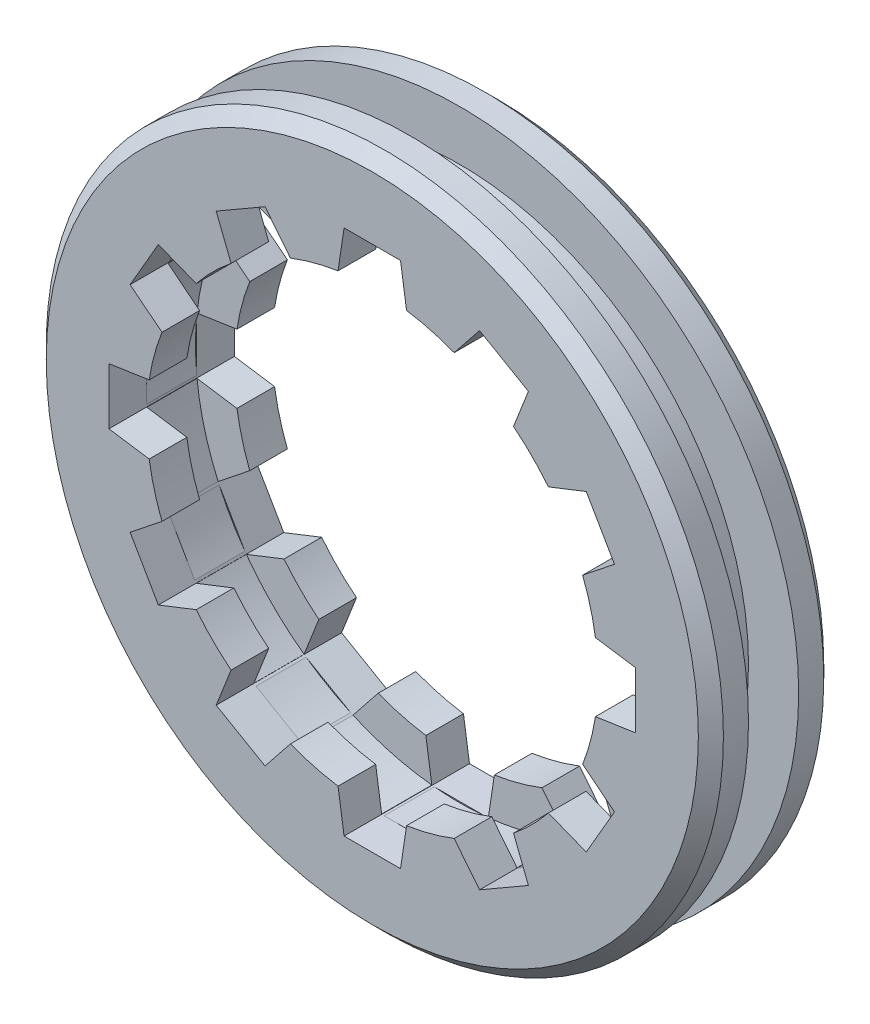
ISO-10303-21;
HEADER;
FILE_DESCRIPTION(('STEP AP214'),'2;1');
FILE_NAME('part.step','',(''),(''),'','','');
FILE_SCHEMA(('AUTOMOTIVE_DESIGN { 1 0 10303 214 1 1 1 1 }'));
ENDSEC;
DATA;
#1=APPLICATION_CONTEXT('core data for automotive mechanical design processes');
#2=APPLICATION_PROTOCOL_DEFINITION('international standard','automotive_design',2000,#1);
#3=PRODUCT_CONTEXT('',#1,'mechanical');
#4=PRODUCT('Part','Part','',(#3));
#5=PRODUCT_RELATED_PRODUCT_CATEGORY('part','',(#4));
#6=PRODUCT_DEFINITION_FORMATION('','',#4);
#7=PRODUCT_DEFINITION_CONTEXT('part definition',#1,'design');
#8=PRODUCT_DEFINITION('design','',#6,#7);
#9=PRODUCT_DEFINITION_SHAPE('','',#8);
#10=(LENGTH_UNIT() NAMED_UNIT(*) SI_UNIT(.MILLI.,.METRE.));
#11=(NAMED_UNIT(*) PLANE_ANGLE_UNIT() SI_UNIT($,.RADIAN.));
#12=(NAMED_UNIT(*) SI_UNIT($,.STERADIAN.) SOLID_ANGLE_UNIT());
#13=UNCERTAINTY_MEASURE_WITH_UNIT(LENGTH_MEASURE(1.E-05),#10,'distance_accuracy_value','');
#14=(GEOMETRIC_REPRESENTATION_CONTEXT(3) GLOBAL_UNCERTAINTY_ASSIGNED_CONTEXT((#13)) GLOBAL_UNIT_ASSIGNED_CONTEXT((#10,
#11,#12)) REPRESENTATION_CONTEXT('',''));
#15=CARTESIAN_POINT('',(0.,0.,0.));
#16=DIRECTION('',(0.,0.,1.));
#17=DIRECTION('',(1.,0.,0.));
#18=AXIS2_PLACEMENT_3D('',#15,#16,#17);
#19=CARTESIAN_POINT('',(0.,0.,3.));
#20=DIRECTION('',(0.,0.,1.));
#21=DIRECTION('',(1.,0.,0.));
#22=AXIS2_PLACEMENT_3D('',#19,#20,#21);
#23=PLANE('',#22);
#24=DIRECTION('',(-0.62293477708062,0.782273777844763,0.));
#25=VECTOR('',#24,1.);
#26=CARTESIAN_POINT('',(4.17754247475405,3.32663137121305,3.));
#27=LINE('',#26,#25);
#28=CARTESIAN_POINT('',(-6.53044474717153,16.7735891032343,3.));
#29=VERTEX_POINT('',#28);
#30=CARTESIAN_POINT('',(-8.53844181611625,19.2952069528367,3.));
#31=VERTEX_POINT('',#30);
#32=EDGE_CURVE('E806',#29,#31,#27,.T.);
#33=ORIENTED_EDGE('',*,*,#32,.F.);
#34=CARTESIAN_POINT('',(0.,0.,3.));
#35=DIRECTION('',(0.,0.,1.));
#36=DIRECTION('',(1.,0.,0.));
#37=AXIS2_PLACEMENT_3D('',#34,#35,#36);
#38=CIRCLE('',#37,18.);
#39=CARTESIAN_POINT('',(-2.73126350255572,17.7915766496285,3.));
#40=VERTEX_POINT('',#39);
#41=EDGE_CURVE('E1418',#40,#29,#38,.T.);
#42=ORIENTED_EDGE('',*,*,#41,.F.);
#43=DIRECTION('',(-0.148340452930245,-0.988936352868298,0.));
#44=VECTOR('',#43,1.);
#45=CARTESIAN_POINT('',(-5.28117359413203,0.792176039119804,3.));
#46=LINE('',#45,#44);
#47=CARTESIAN_POINT('',(-2.25309595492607,20.9793603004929,3.));
#48=VERTEX_POINT('',#47);
#49=EDGE_CURVE('E1367',#48,#40,#46,.T.);
#50=ORIENTED_EDGE('',*,*,#49,.F.);
#51=CARTESIAN_POINT('',(0.,0.,3.));
#52=DIRECTION('',(0.,0.,1.));
#53=DIRECTION('',(1.,0.,0.));
#54=AXIS2_PLACEMENT_3D('',#51,#52,#53);
#55=CIRCLE('',#54,21.1);
#56=EDGE_CURVE('E1425',#31,#48,#55,.F.);
#57=ORIENTED_EDGE('',*,*,#56,.F.);
#58=EDGE_LOOP('',(#33,#42,#50,#57));
#59=FACE_BOUND('',#58,.T.);
#60=ADVANCED_FACE('F24',(#59),#23,.T.);
#61=CARTESIAN_POINT('',(0.,0.,3.));
#62=DIRECTION('',(0.,0.,-1.));
#63=DIRECTION('',(-1.,0.,0.));
#64=AXIS2_PLACEMENT_3D('',#61,#62,#63);
#65=CYLINDRICAL_SURFACE('',#64,18.);
#66=DIRECTION('',(0.,0.,-1.));
#67=VECTOR('',#66,1.);
#68=CARTESIAN_POINT('',(-6.53044474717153,16.7735891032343,3.));
#69=LINE('',#68,#67);
#70=CARTESIAN_POINT('',(-6.53044474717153,16.7735891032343,0.));
#71=VERTEX_POINT('',#70);
#72=EDGE_CURVE('E808',#71,#29,#69,.F.);
#73=ORIENTED_EDGE('',*,*,#72,.F.);
#74=CARTESIAN_POINT('',(0.,0.,0.));
#75=DIRECTION('',(0.,0.,1.));
#76=DIRECTION('',(1.,0.,0.));
#77=AXIS2_PLACEMENT_3D('',#74,#75,#76);
#78=CIRCLE('',#77,18.);
#79=CARTESIAN_POINT('',(-2.73126350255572,17.7915766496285,0.));
#80=VERTEX_POINT('',#79);
#81=EDGE_CURVE('E780',#80,#71,#78,.T.);
#82=ORIENTED_EDGE('',*,*,#81,.F.);
#83=DIRECTION('',(0.,0.,-1.));
#84=VECTOR('',#83,1.);
#85=CARTESIAN_POINT('',(-2.73126350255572,17.7915766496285,3.));
#86=LINE('',#85,#84);
#87=EDGE_CURVE('E1369',#40,#80,#86,.T.);
#88=ORIENTED_EDGE('',*,*,#87,.F.);
#89=ORIENTED_EDGE('',*,*,#41,.T.);
#90=EDGE_LOOP('',(#73,#82,#88,#89));
#91=FACE_BOUND('',#90,.T.);
#92=ADVANCED_FACE('F1719',(#91),#65,.F.);
#93=CARTESIAN_POINT('',(0.,0.,7.));
#94=DIRECTION('',(0.,0.,-1.));
#95=DIRECTION('',(-1.,0.,0.));
#96=AXIS2_PLACEMENT_3D('',#93,#94,#95);
#97=CYLINDRICAL_SURFACE('',#96,21.1);
#98=DIRECTION('',(0.,0.,-1.));
#99=VECTOR('',#98,1.);
#100=CARTESIAN_POINT('',(-8.53844181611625,19.2952069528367,7.));
#101=LINE('',#100,#99);
#102=CARTESIAN_POINT('',(-8.53844181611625,19.2952069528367,7.));
#103=VERTEX_POINT('',#102);
#104=EDGE_CURVE('E804',#31,#103,#101,.F.);
#105=ORIENTED_EDGE('',*,*,#104,.F.);
#106=ORIENTED_EDGE('',*,*,#56,.T.);
#107=DIRECTION('',(0.,0.,-1.));
#108=VECTOR('',#107,1.);
#109=CARTESIAN_POINT('',(-2.25309595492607,20.9793603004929,7.));
#110=LINE('',#109,#108);
#111=CARTESIAN_POINT('',(-2.25309595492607,20.9793603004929,7.));
#112=VERTEX_POINT('',#111);
#113=EDGE_CURVE('E1364',#112,#48,#110,.T.);
#114=ORIENTED_EDGE('',*,*,#113,.F.);
#115=CARTESIAN_POINT('',(0.,0.,7.));
#116=DIRECTION('',(0.,0.,1.));
#117=DIRECTION('',(1.,0.,0.));
#118=AXIS2_PLACEMENT_3D('',#115,#116,#117);
#119=CIRCLE('',#118,21.1);
#120=EDGE_CURVE('E1402',#112,#103,#119,.T.);
#121=ORIENTED_EDGE('',*,*,#120,.T.);
#122=EDGE_LOOP('',(#105,#106,#114,#121));
#123=FACE_BOUND('',#122,.T.);
#124=ADVANCED_FACE('F1709',(#123),#97,.F.);
#125=CARTESIAN_POINT('',(0.,0.,7.));
#126=DIRECTION('',(0.,0.,1.));
#127=DIRECTION('',(1.,0.,0.));
#128=AXIS2_PLACEMENT_3D('',#125,#126,#127);
#129=PLANE('',#128);
#130=CARTESIAN_POINT('',(0.,0.,7.));
#131=DIRECTION('',(0.,0.,1.));
#132=DIRECTION('',(1.,0.,0.));
#133=AXIS2_PLACEMENT_3D('',#130,#131,#132);
#134=CIRCLE('',#133,18.);
#135=CARTESIAN_POINT('',(-2.73126350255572,17.7915766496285,7.));
#136=VERTEX_POINT('',#135);
#137=CARTESIAN_POINT('',(-6.53044474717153,16.7735891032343,7.));
#138=VERTEX_POINT('',#137);
#139=EDGE_CURVE('E1389',#136,#138,#134,.T.);
#140=ORIENTED_EDGE('',*,*,#139,.T.);
#141=DIRECTION('',(-0.62293477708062,0.782273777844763,0.));
#142=VECTOR('',#141,1.);
#143=CARTESIAN_POINT('',(4.17754247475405,3.32663137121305,7.));
#144=LINE('',#143,#142);
#145=EDGE_CURVE('E801',#138,#103,#144,.T.);
#146=ORIENTED_EDGE('',*,*,#145,.T.);
#147=ORIENTED_EDGE('',*,*,#120,.F.);
#148=DIRECTION('',(-0.148340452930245,-0.988936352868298,0.));
#149=VECTOR('',#148,1.);
#150=CARTESIAN_POINT('',(-5.28117359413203,0.792176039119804,7.));
#151=LINE('',#150,#149);
#152=EDGE_CURVE('E1360',#112,#136,#151,.T.);
#153=ORIENTED_EDGE('',*,*,#152,.T.);
#154=EDGE_LOOP('',(#140,#146,#147,#153));
#155=FACE_BOUND('',#154,.T.);
#156=ADVANCED_FACE('F1732',(#155),#129,.F.);
#157=CARTESIAN_POINT('',(0.,0.,10.));
#158=DIRECTION('',(0.,0.,-1.));
#159=DIRECTION('',(-1.,0.,0.));
#160=AXIS2_PLACEMENT_3D('',#157,#158,#159);
#161=CYLINDRICAL_SURFACE('',#160,18.);
#162=DIRECTION('',(0.,0.,-1.));
#163=VECTOR('',#162,1.);
#164=CARTESIAN_POINT('',(-6.53044474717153,16.7735891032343,10.));
#165=LINE('',#164,#163);
#166=CARTESIAN_POINT('',(-6.53044474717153,16.7735891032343,10.));
#167=VERTEX_POINT('',#166);
#168=EDGE_CURVE('E799',#138,#167,#165,.F.);
#169=ORIENTED_EDGE('',*,*,#168,.F.);
#170=ORIENTED_EDGE('',*,*,#139,.F.);
#171=DIRECTION('',(0.,0.,-1.));
#172=VECTOR('',#171,1.);
#173=CARTESIAN_POINT('',(-2.73126350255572,17.7915766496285,10.));
#174=LINE('',#173,#172);
#175=CARTESIAN_POINT('',(-2.73126350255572,17.7915766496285,10.));
#176=VERTEX_POINT('',#175);
#177=EDGE_CURVE('E1443',#176,#136,#174,.T.);
#178=ORIENTED_EDGE('',*,*,#177,.F.);
#179=CARTESIAN_POINT('',(0.,0.,10.));
#180=DIRECTION('',(0.,0.,1.));
#181=DIRECTION('',(1.,0.,0.));
#182=AXIS2_PLACEMENT_3D('',#179,#180,#181);
#183=CIRCLE('',#182,18.);
#184=EDGE_CURVE('E1394',#176,#167,#183,.T.);
#185=ORIENTED_EDGE('',*,*,#184,.T.);
#186=EDGE_LOOP('',(#169,#170,#178,#185));
#187=FACE_BOUND('',#186,.T.);
#188=ADVANCED_FACE('F1730',(#187),#161,.F.);
#189=DIRECTION('',(0.366001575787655,-0.930614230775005,0.));
#190=VECTOR('',#189,1.);
#191=CARTESIAN_POINT('',(-4.96971851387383,-1.95454222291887,3.));
#192=LINE('',#191,#190);
#193=CARTESIAN_POINT('',(-12.4409184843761,17.0421109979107,3.));
#194=VERTEX_POINT('',#193);
#195=CARTESIAN_POINT('',(-11.2611319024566,14.0423256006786,3.));
#196=VERTEX_POINT('',#195);
#197=EDGE_CURVE('E795',#194,#196,#192,.T.);
#198=ORIENTED_EDGE('',*,*,#197,.F.);
#199=CARTESIAN_POINT('',(-17.0421109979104,12.4409184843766,3.));
#200=VERTEX_POINT('',#199);
#201=EDGE_CURVE('E1694',#200,#194,#55,.F.);
#202=ORIENTED_EDGE('',*,*,#201,.F.);
#203=DIRECTION('',(-0.930614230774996,0.366001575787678,0.));
#204=VECTOR('',#203,1.);
#205=CARTESIAN_POINT('',(1.95454222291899,4.96971851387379,3.));
#206=LINE('',#205,#204);
#207=CARTESIAN_POINT('',(-14.0423256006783,11.2611319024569,3.));
#208=VERTEX_POINT('',#207);
#209=EDGE_CURVE('E856',#208,#200,#206,.T.);
#210=ORIENTED_EDGE('',*,*,#209,.F.);
#211=EDGE_CURVE('E1422',#196,#208,#38,.T.);
#212=ORIENTED_EDGE('',*,*,#211,.F.);
#213=EDGE_LOOP('',(#198,#202,#210,#212));
#214=FACE_BOUND('',#213,.T.);
#215=ADVANCED_FACE('F1692',(#214),#23,.T.);
#216=DIRECTION('',(0.,0.,-1.));
#217=VECTOR('',#216,1.);
#218=CARTESIAN_POINT('',(-11.2611319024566,14.0423256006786,3.));
#219=LINE('',#218,#217);
#220=CARTESIAN_POINT('',(-11.2611319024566,14.0423256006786,0.));
#221=VERTEX_POINT('',#220);
#222=EDGE_CURVE('E797',#196,#221,#219,.T.);
#223=ORIENTED_EDGE('',*,*,#222,.F.);
#224=ORIENTED_EDGE('',*,*,#211,.T.);
#225=DIRECTION('',(0.,0.,-1.));
#226=VECTOR('',#225,1.);
#227=CARTESIAN_POINT('',(-14.0423256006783,11.2611319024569,3.));
#228=LINE('',#227,#226);
#229=CARTESIAN_POINT('',(-14.0423256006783,11.2611319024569,0.));
#230=VERTEX_POINT('',#229);
#231=EDGE_CURVE('E858',#230,#208,#228,.F.);
#232=ORIENTED_EDGE('',*,*,#231,.F.);
#233=EDGE_CURVE('E1417',#221,#230,#78,.T.);
#234=ORIENTED_EDGE('',*,*,#233,.F.);
#235=EDGE_LOOP('',(#223,#224,#232,#234));
#236=FACE_BOUND('',#235,.T.);
#237=ADVANCED_FACE('F1601',(#236),#65,.F.);
#238=DIRECTION('',(0.,0.,-1.));
#239=VECTOR('',#238,1.);
#240=CARTESIAN_POINT('',(-12.4409184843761,17.0421109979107,7.));
#241=LINE('',#240,#239);
#242=CARTESIAN_POINT('',(-12.4409184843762,17.0421109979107,7.));
#243=VERTEX_POINT('',#242);
#244=EDGE_CURVE('E793',#243,#194,#241,.T.);
#245=ORIENTED_EDGE('',*,*,#244,.F.);
#246=CARTESIAN_POINT('',(-17.0421109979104,12.4409184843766,7.));
#247=VERTEX_POINT('',#246);
#248=EDGE_CURVE('E1407',#243,#247,#119,.T.);
#249=ORIENTED_EDGE('',*,*,#248,.T.);
#250=DIRECTION('',(0.,0.,-1.));
#251=VECTOR('',#250,1.);
#252=CARTESIAN_POINT('',(-17.0421109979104,12.4409184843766,7.));
#253=LINE('',#252,#251);
#254=EDGE_CURVE('E853',#200,#247,#253,.F.);
#255=ORIENTED_EDGE('',*,*,#254,.F.);
#256=ORIENTED_EDGE('',*,*,#201,.T.);
#257=EDGE_LOOP('',(#245,#249,#255,#256));
#258=FACE_BOUND('',#257,.T.);
#259=ADVANCED_FACE('F1863',(#258),#97,.F.);
#260=ORIENTED_EDGE('',*,*,#248,.F.);
#261=DIRECTION('',(0.366001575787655,-0.930614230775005,0.));
#262=VECTOR('',#261,1.);
#263=CARTESIAN_POINT('',(-4.96971851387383,-1.95454222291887,7.));
#264=LINE('',#263,#262);
#265=CARTESIAN_POINT('',(-11.2611319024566,14.0423256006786,7.));
#266=VERTEX_POINT('',#265);
#267=EDGE_CURVE('E790',#243,#266,#264,.T.);
#268=ORIENTED_EDGE('',*,*,#267,.T.);
#269=CARTESIAN_POINT('',(-14.0423256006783,11.2611319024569,7.));
#270=VERTEX_POINT('',#269);
#271=EDGE_CURVE('E1393',#266,#270,#134,.T.);
#272=ORIENTED_EDGE('',*,*,#271,.T.);
#273=DIRECTION('',(-0.930614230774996,0.366001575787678,0.));
#274=VECTOR('',#273,1.);
#275=CARTESIAN_POINT('',(1.95454222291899,4.96971851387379,7.));
#276=LINE('',#275,#274);
#277=EDGE_CURVE('E850',#270,#247,#276,.T.);
#278=ORIENTED_EDGE('',*,*,#277,.T.);
#279=EDGE_LOOP('',(#260,#268,#272,#278));
#280=FACE_BOUND('',#279,.T.);
#281=ADVANCED_FACE('F1748',(#280),#129,.F.);
#282=DIRECTION('',(0.,0.,-1.));
#283=VECTOR('',#282,1.);
#284=CARTESIAN_POINT('',(-11.2611319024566,14.0423256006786,10.));
#285=LINE('',#284,#283);
#286=CARTESIAN_POINT('',(-11.2611319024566,14.0423256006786,10.));
#287=VERTEX_POINT('',#286);
#288=EDGE_CURVE('E787',#287,#266,#285,.T.);
#289=ORIENTED_EDGE('',*,*,#288,.F.);
#290=CARTESIAN_POINT('',(-14.0423256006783,11.2611319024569,10.));
#291=VERTEX_POINT('',#290);
#292=EDGE_CURVE('E1398',#287,#291,#183,.T.);
#293=ORIENTED_EDGE('',*,*,#292,.T.);
#294=DIRECTION('',(0.,0.,-1.));
#295=VECTOR('',#294,1.);
#296=CARTESIAN_POINT('',(-14.0423256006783,11.2611319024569,10.));
#297=LINE('',#296,#295);
#298=EDGE_CURVE('E847',#270,#291,#297,.F.);
#299=ORIENTED_EDGE('',*,*,#298,.F.);
#300=ORIENTED_EDGE('',*,*,#271,.F.);
#301=EDGE_LOOP('',(#289,#293,#299,#300));
#302=FACE_BOUND('',#301,.T.);
#303=ADVANCED_FACE('F1592',(#302),#161,.F.);
#304=DIRECTION('',(0.782273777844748,-0.622934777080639,0.));
#305=VECTOR('',#304,1.);
#306=CARTESIAN_POINT('',(-3.32663137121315,-4.17754247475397,3.));
#307=LINE('',#306,#305);
#308=CARTESIAN_POINT('',(-19.2952069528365,8.53844181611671,3.));
#309=VERTEX_POINT('',#308);
#310=CARTESIAN_POINT('',(-16.7735891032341,6.53044474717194,3.));
#311=VERTEX_POINT('',#310);
#312=EDGE_CURVE('E843',#309,#311,#307,.T.);
#313=ORIENTED_EDGE('',*,*,#312,.F.);
#314=CARTESIAN_POINT('',(-20.9793603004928,2.25309595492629,3.));
#315=VERTEX_POINT('',#314);
#316=EDGE_CURVE('E1700',#315,#309,#55,.F.);
#317=ORIENTED_EDGE('',*,*,#316,.F.);
#318=DIRECTION('',(-0.988936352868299,-0.148340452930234,0.));
#319=VECTOR('',#318,1.);
#320=CARTESIAN_POINT('',(-0.792176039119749,5.28117359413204,3.));
#321=LINE('',#320,#319);
#322=CARTESIAN_POINT('',(-17.7915766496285,2.7312635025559,3.));
#323=VERTEX_POINT('',#322);
#324=EDGE_CURVE('E909',#323,#315,#321,.T.);
#325=ORIENTED_EDGE('',*,*,#324,.F.);
#326=EDGE_CURVE('E1678',#311,#323,#38,.T.);
#327=ORIENTED_EDGE('',*,*,#326,.F.);
#328=EDGE_LOOP('',(#313,#317,#325,#327));
#329=FACE_BOUND('',#328,.T.);
#330=ADVANCED_FACE('F1871',(#329),#23,.T.);
#331=DIRECTION('',(0.,0.,-1.));
#332=VECTOR('',#331,1.);
#333=CARTESIAN_POINT('',(-16.7735891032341,6.53044474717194,3.));
#334=LINE('',#333,#332);
#335=CARTESIAN_POINT('',(-16.7735891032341,6.53044474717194,0.));
#336=VERTEX_POINT('',#335);
#337=EDGE_CURVE('E845',#311,#336,#334,.T.);
#338=ORIENTED_EDGE('',*,*,#337,.F.);
#339=ORIENTED_EDGE('',*,*,#326,.T.);
#340=DIRECTION('',(0.,0.,-1.));
#341=VECTOR('',#340,1.);
#342=CARTESIAN_POINT('',(-17.7915766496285,2.7312635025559,3.));
#343=LINE('',#342,#341);
#344=CARTESIAN_POINT('',(-17.7915766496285,2.7312635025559,0.));
#345=VERTEX_POINT('',#344);
#346=EDGE_CURVE('E911',#345,#323,#343,.F.);
#347=ORIENTED_EDGE('',*,*,#346,.F.);
#348=EDGE_CURVE('E1603',#336,#345,#78,.T.);
#349=ORIENTED_EDGE('',*,*,#348,.F.);
#350=EDGE_LOOP('',(#338,#339,#347,#349));
#351=FACE_BOUND('',#350,.T.);
#352=ADVANCED_FACE('F1894',(#351),#65,.F.);
#353=DIRECTION('',(0.,0.,-1.));
#354=VECTOR('',#353,1.);
#355=CARTESIAN_POINT('',(-19.2952069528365,8.53844181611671,7.));
#356=LINE('',#355,#354);
#357=CARTESIAN_POINT('',(-19.2952069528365,8.53844181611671,7.));
#358=VERTEX_POINT('',#357);
#359=EDGE_CURVE('E841',#358,#309,#356,.T.);
#360=ORIENTED_EDGE('',*,*,#359,.F.);
#361=CARTESIAN_POINT('',(-20.9793603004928,2.25309595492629,7.));
#362=VERTEX_POINT('',#361);
#363=EDGE_CURVE('E1850',#358,#362,#119,.T.);
#364=ORIENTED_EDGE('',*,*,#363,.T.);
#365=DIRECTION('',(0.,0.,-1.));
#366=VECTOR('',#365,1.);
#367=CARTESIAN_POINT('',(-20.9793603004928,2.25309595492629,7.));
#368=LINE('',#367,#366);
#369=EDGE_CURVE('E906',#315,#362,#368,.F.);
#370=ORIENTED_EDGE('',*,*,#369,.F.);
#371=ORIENTED_EDGE('',*,*,#316,.T.);
#372=EDGE_LOOP('',(#360,#364,#370,#371));
#373=FACE_BOUND('',#372,.T.);
#374=ADVANCED_FACE('F1882',(#373),#97,.F.);
#375=ORIENTED_EDGE('',*,*,#363,.F.);
#376=DIRECTION('',(0.782273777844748,-0.622934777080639,0.));
#377=VECTOR('',#376,1.);
#378=CARTESIAN_POINT('',(-3.32663137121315,-4.17754247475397,7.));
#379=LINE('',#378,#377);
#380=CARTESIAN_POINT('',(-16.7735891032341,6.53044474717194,7.));
#381=VERTEX_POINT('',#380);
#382=EDGE_CURVE('E838',#358,#381,#379,.T.);
#383=ORIENTED_EDGE('',*,*,#382,.T.);
#384=CARTESIAN_POINT('',(-17.7915766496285,2.7312635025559,7.));
#385=VERTEX_POINT('',#384);
#386=EDGE_CURVE('E1500',#381,#385,#134,.T.);
#387=ORIENTED_EDGE('',*,*,#386,.T.);
#388=DIRECTION('',(-0.988936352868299,-0.148340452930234,0.));
#389=VECTOR('',#388,1.);
#390=CARTESIAN_POINT('',(-0.792176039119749,5.28117359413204,7.));
#391=LINE('',#390,#389);
#392=EDGE_CURVE('E903',#385,#362,#391,.T.);
#393=ORIENTED_EDGE('',*,*,#392,.T.);
#394=EDGE_LOOP('',(#375,#383,#387,#393));
#395=FACE_BOUND('',#394,.T.);
#396=ADVANCED_FACE('F1876',(#395),#129,.F.);
#397=DIRECTION('',(0.,0.,-1.));
#398=VECTOR('',#397,1.);
#399=CARTESIAN_POINT('',(-16.7735891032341,6.53044474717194,10.));
#400=LINE('',#399,#398);
#401=CARTESIAN_POINT('',(-16.7735891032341,6.53044474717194,10.));
#402=VERTEX_POINT('',#401);
#403=EDGE_CURVE('E834',#402,#381,#400,.T.);
#404=ORIENTED_EDGE('',*,*,#403,.F.);
#405=CARTESIAN_POINT('',(-17.7915766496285,2.7312635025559,10.));
#406=VERTEX_POINT('',#405);
#407=EDGE_CURVE('E1491',#402,#406,#183,.T.);
#408=ORIENTED_EDGE('',*,*,#407,.T.);
#409=DIRECTION('',(0.,0.,-1.));
#410=VECTOR('',#409,1.);
#411=CARTESIAN_POINT('',(-17.7915766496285,2.7312635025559,10.));
#412=LINE('',#411,#410);
#413=EDGE_CURVE('E900',#385,#406,#412,.F.);
#414=ORIENTED_EDGE('',*,*,#413,.F.);
#415=ORIENTED_EDGE('',*,*,#386,.F.);
#416=EDGE_LOOP('',(#404,#408,#414,#415));
#417=FACE_BOUND('',#416,.T.);
#418=ADVANCED_FACE('F1498',(#417),#161,.F.);
#419=DIRECTION('',(0.988936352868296,-0.148340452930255,0.));
#420=VECTOR('',#419,1.);
#421=CARTESIAN_POINT('',(-0.792176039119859,-5.28117359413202,3.));
#422=LINE('',#421,#420);
#423=CARTESIAN_POINT('',(-20.9793603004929,-2.25309595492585,3.));
#424=VERTEX_POINT('',#423);
#425=CARTESIAN_POINT('',(-17.7915766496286,-2.73126350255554,3.));
#426=VERTEX_POINT('',#425);
#427=EDGE_CURVE('E896',#424,#426,#422,.T.);
#428=ORIENTED_EDGE('',*,*,#427,.F.);
#429=CARTESIAN_POINT('',(-19.2952069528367,-8.53844181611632,3.));
#430=VERTEX_POINT('',#429);
#431=EDGE_CURVE('E2190',#430,#424,#55,.F.);
#432=ORIENTED_EDGE('',*,*,#431,.F.);
#433=DIRECTION('',(-0.782273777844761,-0.622934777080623,0.));
#434=VECTOR('',#433,1.);
#435=CARTESIAN_POINT('',(-3.32663137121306,4.17754247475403,3.));
#436=LINE('',#435,#434);
#437=CARTESIAN_POINT('',(-16.7735891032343,-6.53044474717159,3.));
#438=VERTEX_POINT('',#437);
#439=EDGE_CURVE('E962',#438,#430,#436,.T.);
#440=ORIENTED_EDGE('',*,*,#439,.F.);
#441=EDGE_CURVE('E1673',#426,#438,#38,.T.);
#442=ORIENTED_EDGE('',*,*,#441,.F.);
#443=EDGE_LOOP('',(#428,#432,#440,#442));
#444=FACE_BOUND('',#443,.T.);
#445=ADVANCED_FACE('F1892',(#444),#23,.T.);
#446=DIRECTION('',(0.,0.,-1.));
#447=VECTOR('',#446,1.);
#448=CARTESIAN_POINT('',(-17.7915766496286,-2.73126350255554,3.));
#449=LINE('',#448,#447);
#450=CARTESIAN_POINT('',(-17.7915766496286,-2.73126350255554,0.));
#451=VERTEX_POINT('',#450);
#452=EDGE_CURVE('E898',#426,#451,#449,.T.);
#453=ORIENTED_EDGE('',*,*,#452,.F.);
#454=ORIENTED_EDGE('',*,*,#441,.T.);
#455=DIRECTION('',(0.,0.,-1.));
#456=VECTOR('',#455,1.);
#457=CARTESIAN_POINT('',(-16.7735891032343,-6.53044474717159,3.));
#458=LINE('',#457,#456);
#459=CARTESIAN_POINT('',(-16.7735891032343,-6.53044474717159,0.));
#460=VERTEX_POINT('',#459);
#461=EDGE_CURVE('E964',#460,#438,#458,.F.);
#462=ORIENTED_EDGE('',*,*,#461,.F.);
#463=EDGE_CURVE('E1604',#451,#460,#78,.T.);
#464=ORIENTED_EDGE('',*,*,#463,.F.);
#465=EDGE_LOOP('',(#453,#454,#462,#464));
#466=FACE_BOUND('',#465,.T.);
#467=ADVANCED_FACE('F1917',(#466),#65,.F.);
#468=DIRECTION('',(0.,0.,-1.));
#469=VECTOR('',#468,1.);
#470=CARTESIAN_POINT('',(-20.9793603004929,-2.25309595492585,7.));
#471=LINE('',#470,#469);
#472=CARTESIAN_POINT('',(-20.9793603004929,-2.25309595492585,7.));
#473=VERTEX_POINT('',#472);
#474=EDGE_CURVE('E894',#473,#424,#471,.T.);
#475=ORIENTED_EDGE('',*,*,#474,.F.);
#476=CARTESIAN_POINT('',(-19.2952069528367,-8.53844181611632,7.));
#477=VERTEX_POINT('',#476);
#478=EDGE_CURVE('E1838',#473,#477,#119,.T.);
#479=ORIENTED_EDGE('',*,*,#478,.T.);
#480=DIRECTION('',(0.,0.,-1.));
#481=VECTOR('',#480,1.);
#482=CARTESIAN_POINT('',(-19.2952069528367,-8.53844181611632,7.));
#483=LINE('',#482,#481);
#484=EDGE_CURVE('E959',#430,#477,#483,.F.);
#485=ORIENTED_EDGE('',*,*,#484,.F.);
#486=ORIENTED_EDGE('',*,*,#431,.T.);
#487=EDGE_LOOP('',(#475,#479,#485,#486));
#488=FACE_BOUND('',#487,.T.);
#489=ADVANCED_FACE('F1905',(#488),#97,.F.);
#490=ORIENTED_EDGE('',*,*,#478,.F.);
#491=DIRECTION('',(0.988936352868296,-0.148340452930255,0.));
#492=VECTOR('',#491,1.);
#493=CARTESIAN_POINT('',(-0.792176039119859,-5.28117359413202,7.));
#494=LINE('',#493,#492);
#495=CARTESIAN_POINT('',(-17.7915766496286,-2.73126350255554,7.));
#496=VERTEX_POINT('',#495);
#497=EDGE_CURVE('E891',#473,#496,#494,.T.);
#498=ORIENTED_EDGE('',*,*,#497,.T.);
#499=CARTESIAN_POINT('',(-16.7735891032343,-6.53044474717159,7.));
#500=VERTEX_POINT('',#499);
#501=EDGE_CURVE('E1503',#496,#500,#134,.T.);
#502=ORIENTED_EDGE('',*,*,#501,.T.);
#503=DIRECTION('',(-0.782273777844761,-0.622934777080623,0.));
#504=VECTOR('',#503,1.);
#505=CARTESIAN_POINT('',(-3.32663137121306,4.17754247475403,7.));
#506=LINE('',#505,#504);
#507=EDGE_CURVE('E956',#500,#477,#506,.T.);
#508=ORIENTED_EDGE('',*,*,#507,.T.);
#509=EDGE_LOOP('',(#490,#498,#502,#508));
#510=FACE_BOUND('',#509,.T.);
#511=ADVANCED_FACE('F1899',(#510),#129,.F.);
#512=DIRECTION('',(0.,0.,-1.));
#513=VECTOR('',#512,1.);
#514=CARTESIAN_POINT('',(-17.7915766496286,-2.73126350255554,10.));
#515=LINE('',#514,#513);
#516=CARTESIAN_POINT('',(-17.7915766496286,-2.73126350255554,10.));
#517=VERTEX_POINT('',#516);
#518=EDGE_CURVE('E887',#517,#496,#515,.T.);
#519=ORIENTED_EDGE('',*,*,#518,.F.);
#520=CARTESIAN_POINT('',(-16.7735891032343,-6.53044474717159,10.));
#521=VERTEX_POINT('',#520);
#522=EDGE_CURVE('E1581',#517,#521,#183,.T.);
#523=ORIENTED_EDGE('',*,*,#522,.T.);
#524=DIRECTION('',(0.,0.,-1.));
#525=VECTOR('',#524,1.);
#526=CARTESIAN_POINT('',(-16.7735891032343,-6.53044474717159,10.));
#527=LINE('',#526,#525);
#528=EDGE_CURVE('E953',#500,#521,#527,.F.);
#529=ORIENTED_EDGE('',*,*,#528,.F.);
#530=ORIENTED_EDGE('',*,*,#501,.F.);
#531=EDGE_LOOP('',(#519,#523,#529,#530));
#532=FACE_BOUND('',#531,.T.);
#533=ADVANCED_FACE('F1893',(#532),#161,.F.);
#534=DIRECTION('',(0.930614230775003,0.366001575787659,0.));
#535=VECTOR('',#534,1.);
#536=CARTESIAN_POINT('',(1.95454222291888,-4.96971851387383,3.));
#537=LINE('',#536,#535);
#538=CARTESIAN_POINT('',(-17.0421109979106,-12.4409184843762,3.));
#539=VERTEX_POINT('',#538);
#540=CARTESIAN_POINT('',(-14.0423256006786,-11.2611319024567,3.));
#541=VERTEX_POINT('',#540);
#542=EDGE_CURVE('E949',#539,#541,#537,.T.);
#543=ORIENTED_EDGE('',*,*,#542,.F.);
#544=CARTESIAN_POINT('',(-12.4409184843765,-17.0421109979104,3.));
#545=VERTEX_POINT('',#544);
#546=EDGE_CURVE('E2222',#545,#539,#55,.F.);
#547=ORIENTED_EDGE('',*,*,#546,.F.);
#548=DIRECTION('',(-0.366001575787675,-0.930614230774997,0.));
#549=VECTOR('',#548,1.);
#550=CARTESIAN_POINT('',(-4.96971851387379,1.95454222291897,3.));
#551=LINE('',#550,#549);
#552=CARTESIAN_POINT('',(-11.2611319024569,-14.0423256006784,3.));
#553=VERTEX_POINT('',#552);
#554=EDGE_CURVE('E1015',#553,#545,#551,.T.);
#555=ORIENTED_EDGE('',*,*,#554,.F.);
#556=EDGE_CURVE('E1668',#541,#553,#38,.T.);
#557=ORIENTED_EDGE('',*,*,#556,.F.);
#558=EDGE_LOOP('',(#543,#547,#555,#557));
#559=FACE_BOUND('',#558,.T.);
#560=ADVANCED_FACE('F1915',(#559),#23,.T.);
#561=DIRECTION('',(0.,0.,-1.));
#562=VECTOR('',#561,1.);
#563=CARTESIAN_POINT('',(-14.0423256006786,-11.2611319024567,3.));
#564=LINE('',#563,#562);
#565=CARTESIAN_POINT('',(-14.0423256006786,-11.2611319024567,0.));
#566=VERTEX_POINT('',#565);
#567=EDGE_CURVE('E951',#541,#566,#564,.T.);
#568=ORIENTED_EDGE('',*,*,#567,.F.);
#569=ORIENTED_EDGE('',*,*,#556,.T.);
#570=DIRECTION('',(0.,0.,-1.));
#571=VECTOR('',#570,1.);
#572=CARTESIAN_POINT('',(-11.2611319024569,-14.0423256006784,3.));
#573=LINE('',#572,#571);
#574=CARTESIAN_POINT('',(-11.2611319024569,-14.0423256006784,0.));
#575=VERTEX_POINT('',#574);
#576=EDGE_CURVE('E1017',#575,#553,#573,.F.);
#577=ORIENTED_EDGE('',*,*,#576,.F.);
#578=EDGE_CURVE('E1607',#566,#575,#78,.T.);
#579=ORIENTED_EDGE('',*,*,#578,.F.);
#580=EDGE_LOOP('',(#568,#569,#577,#579));
#581=FACE_BOUND('',#580,.T.);
#582=ADVANCED_FACE('F1944',(#581),#65,.F.);
#583=DIRECTION('',(0.,0.,-1.));
#584=VECTOR('',#583,1.);
#585=CARTESIAN_POINT('',(-17.0421109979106,-12.4409184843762,7.));
#586=LINE('',#585,#584);
#587=CARTESIAN_POINT('',(-17.0421109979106,-12.4409184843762,7.));
#588=VERTEX_POINT('',#587);
#589=EDGE_CURVE('E947',#588,#539,#586,.T.);
#590=ORIENTED_EDGE('',*,*,#589,.F.);
#591=CARTESIAN_POINT('',(-12.4409184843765,-17.0421109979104,7.));
#592=VERTEX_POINT('',#591);
#593=EDGE_CURVE('E1836',#588,#592,#119,.T.);
#594=ORIENTED_EDGE('',*,*,#593,.T.);
#595=DIRECTION('',(0.,0.,-1.));
#596=VECTOR('',#595,1.);
#597=CARTESIAN_POINT('',(-12.4409184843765,-17.0421109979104,7.));
#598=LINE('',#597,#596);
#599=EDGE_CURVE('E1012',#545,#592,#598,.F.);
#600=ORIENTED_EDGE('',*,*,#599,.F.);
#601=ORIENTED_EDGE('',*,*,#546,.T.);
#602=EDGE_LOOP('',(#590,#594,#600,#601));
#603=FACE_BOUND('',#602,.T.);
#604=ADVANCED_FACE('F1931',(#603),#97,.F.);
#605=ORIENTED_EDGE('',*,*,#593,.F.);
#606=DIRECTION('',(0.930614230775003,0.366001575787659,0.));
#607=VECTOR('',#606,1.);
#608=CARTESIAN_POINT('',(1.95454222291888,-4.96971851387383,7.));
#609=LINE('',#608,#607);
#610=CARTESIAN_POINT('',(-14.0423256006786,-11.2611319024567,7.));
#611=VERTEX_POINT('',#610);
#612=EDGE_CURVE('E944',#588,#611,#609,.T.);
#613=ORIENTED_EDGE('',*,*,#612,.T.);
#614=CARTESIAN_POINT('',(-11.2611319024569,-14.0423256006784,7.));
#615=VERTEX_POINT('',#614);
#616=EDGE_CURVE('E1504',#611,#615,#134,.T.);
#617=ORIENTED_EDGE('',*,*,#616,.T.);
#618=DIRECTION('',(-0.366001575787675,-0.930614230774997,0.));
#619=VECTOR('',#618,1.);
#620=CARTESIAN_POINT('',(-4.96971851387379,1.95454222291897,7.));
#621=LINE('',#620,#619);
#622=EDGE_CURVE('E1009',#615,#592,#621,.T.);
#623=ORIENTED_EDGE('',*,*,#622,.T.);
#624=EDGE_LOOP('',(#605,#613,#617,#623));
#625=FACE_BOUND('',#624,.T.);
#626=ADVANCED_FACE('F1924',(#625),#129,.F.);
#627=DIRECTION('',(0.,0.,-1.));
#628=VECTOR('',#627,1.);
#629=CARTESIAN_POINT('',(-14.0423256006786,-11.2611319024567,10.));
#630=LINE('',#629,#628);
#631=CARTESIAN_POINT('',(-14.0423256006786,-11.2611319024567,10.));
#632=VERTEX_POINT('',#631);
#633=EDGE_CURVE('E941',#632,#611,#630,.T.);
#634=ORIENTED_EDGE('',*,*,#633,.F.);
#635=CARTESIAN_POINT('',(-11.2611319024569,-14.0423256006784,10.));
#636=VERTEX_POINT('',#635);
#637=EDGE_CURVE('E1576',#632,#636,#183,.T.);
#638=ORIENTED_EDGE('',*,*,#637,.T.);
#639=DIRECTION('',(0.,0.,-1.));
#640=VECTOR('',#639,1.);
#641=CARTESIAN_POINT('',(-11.2611319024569,-14.0423256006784,10.));
#642=LINE('',#641,#640);
#643=EDGE_CURVE('E1006',#615,#636,#642,.F.);
#644=ORIENTED_EDGE('',*,*,#643,.F.);
#645=ORIENTED_EDGE('',*,*,#616,.F.);
#646=EDGE_LOOP('',(#634,#638,#644,#645));
#647=FACE_BOUND('',#646,.T.);
#648=ADVANCED_FACE('F1916',(#647),#161,.F.);
#649=DIRECTION('',(0.622934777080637,0.78227377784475,0.));
#650=VECTOR('',#649,1.);
#651=CARTESIAN_POINT('',(4.17754247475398,-3.32663137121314,3.));
#652=LINE('',#651,#650);
#653=CARTESIAN_POINT('',(-8.53844181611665,-19.2952069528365,3.));
#654=VERTEX_POINT('',#653);
#655=CARTESIAN_POINT('',(-6.53044474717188,-16.7735891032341,3.));
#656=VERTEX_POINT('',#655);
#657=EDGE_CURVE('E1002',#654,#656,#652,.T.);
#658=ORIENTED_EDGE('',*,*,#657,.F.);
#659=CARTESIAN_POINT('',(-2.25309595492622,-20.9793603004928,3.));
#660=VERTEX_POINT('',#659);
#661=EDGE_CURVE('E2225',#660,#654,#55,.F.);
#662=ORIENTED_EDGE('',*,*,#661,.F.);
#663=DIRECTION('',(0.148340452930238,-0.988936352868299,0.));
#664=VECTOR('',#663,1.);
#665=CARTESIAN_POINT('',(-5.28117359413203,-0.792176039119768,3.));
#666=LINE('',#665,#664);
#667=CARTESIAN_POINT('',(-2.73126350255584,-17.7915766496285,3.));
#668=VERTEX_POINT('',#667);
#669=EDGE_CURVE('E1068',#668,#660,#666,.T.);
#670=ORIENTED_EDGE('',*,*,#669,.F.);
#671=EDGE_CURVE('E1663',#656,#668,#38,.T.);
#672=ORIENTED_EDGE('',*,*,#671,.F.);
#673=EDGE_LOOP('',(#658,#662,#670,#672));
#674=FACE_BOUND('',#673,.T.);
#675=ADVANCED_FACE('F1942',(#674),#23,.T.);
#676=DIRECTION('',(0.,0.,-1.));
#677=VECTOR('',#676,1.);
#678=CARTESIAN_POINT('',(-6.53044474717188,-16.7735891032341,3.));
#679=LINE('',#678,#677);
#680=CARTESIAN_POINT('',(-6.53044474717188,-16.7735891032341,0.));
#681=VERTEX_POINT('',#680);
#682=EDGE_CURVE('E1004',#656,#681,#679,.T.);
#683=ORIENTED_EDGE('',*,*,#682,.F.);
#684=ORIENTED_EDGE('',*,*,#671,.T.);
#685=DIRECTION('',(0.,0.,-1.));
#686=VECTOR('',#685,1.);
#687=CARTESIAN_POINT('',(-2.73126350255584,-17.7915766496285,3.));
#688=LINE('',#687,#686);
#689=CARTESIAN_POINT('',(-2.73126350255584,-17.7915766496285,0.));
#690=VERTEX_POINT('',#689);
#691=EDGE_CURVE('E1070',#690,#668,#688,.F.);
#692=ORIENTED_EDGE('',*,*,#691,.F.);
#693=EDGE_CURVE('E1610',#681,#690,#78,.T.);
#694=ORIENTED_EDGE('',*,*,#693,.F.);
#695=EDGE_LOOP('',(#683,#684,#692,#694));
#696=FACE_BOUND('',#695,.T.);
#697=ADVANCED_FACE('F1967',(#696),#65,.F.);
#698=DIRECTION('',(0.,0.,-1.));
#699=VECTOR('',#698,1.);
#700=CARTESIAN_POINT('',(-8.53844181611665,-19.2952069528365,7.));
#701=LINE('',#700,#699);
#702=CARTESIAN_POINT('',(-8.53844181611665,-19.2952069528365,7.));
#703=VERTEX_POINT('',#702);
#704=EDGE_CURVE('E1000',#703,#654,#701,.T.);
#705=ORIENTED_EDGE('',*,*,#704,.F.);
#706=CARTESIAN_POINT('',(-2.25309595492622,-20.9793603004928,7.));
#707=VERTEX_POINT('',#706);
#708=EDGE_CURVE('E1825',#703,#707,#119,.T.);
#709=ORIENTED_EDGE('',*,*,#708,.T.);
#710=DIRECTION('',(0.,0.,-1.));
#711=VECTOR('',#710,1.);
#712=CARTESIAN_POINT('',(-2.25309595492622,-20.9793603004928,7.));
#713=LINE('',#712,#711);
#714=EDGE_CURVE('E1065',#660,#707,#713,.F.);
#715=ORIENTED_EDGE('',*,*,#714,.F.);
#716=ORIENTED_EDGE('',*,*,#661,.T.);
#717=EDGE_LOOP('',(#705,#709,#715,#716));
#718=FACE_BOUND('',#717,.T.);
#719=ADVANCED_FACE('F1955',(#718),#97,.F.);
#720=ORIENTED_EDGE('',*,*,#708,.F.);
#721=DIRECTION('',(0.622934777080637,0.78227377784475,0.));
#722=VECTOR('',#721,1.);
#723=CARTESIAN_POINT('',(4.17754247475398,-3.32663137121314,7.));
#724=LINE('',#723,#722);
#725=CARTESIAN_POINT('',(-6.53044474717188,-16.7735891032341,7.));
#726=VERTEX_POINT('',#725);
#727=EDGE_CURVE('E997',#703,#726,#724,.T.);
#728=ORIENTED_EDGE('',*,*,#727,.T.);
#729=CARTESIAN_POINT('',(-2.73126350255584,-17.7915766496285,7.));
#730=VERTEX_POINT('',#729);
#731=EDGE_CURVE('E1508',#726,#730,#134,.T.);
#732=ORIENTED_EDGE('',*,*,#731,.T.);
#733=DIRECTION('',(0.148340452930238,-0.988936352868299,0.));
#734=VECTOR('',#733,1.);
#735=CARTESIAN_POINT('',(-5.28117359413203,-0.792176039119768,7.));
#736=LINE('',#735,#734);
#737=EDGE_CURVE('E1062',#730,#707,#736,.T.);
#738=ORIENTED_EDGE('',*,*,#737,.T.);
#739=EDGE_LOOP('',(#720,#728,#732,#738));
#740=FACE_BOUND('',#739,.T.);
#741=ADVANCED_FACE('F1949',(#740),#129,.F.);
#742=DIRECTION('',(0.,0.,-1.));
#743=VECTOR('',#742,1.);
#744=CARTESIAN_POINT('',(-6.53044474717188,-16.7735891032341,10.));
#745=LINE('',#744,#743);
#746=CARTESIAN_POINT('',(-6.53044474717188,-16.7735891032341,10.));
#747=VERTEX_POINT('',#746);
#748=EDGE_CURVE('E993',#747,#726,#745,.T.);
#749=ORIENTED_EDGE('',*,*,#748,.F.);
#750=CARTESIAN_POINT('',(-2.73126350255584,-17.7915766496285,10.));
#751=VERTEX_POINT('',#750);
#752=EDGE_CURVE('E1571',#747,#751,#183,.T.);
#753=ORIENTED_EDGE('',*,*,#752,.T.);
#754=DIRECTION('',(0.,0.,-1.));
#755=VECTOR('',#754,1.);
#756=CARTESIAN_POINT('',(-2.73126350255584,-17.7915766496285,10.));
#757=LINE('',#756,#755);
#758=EDGE_CURVE('E1059',#730,#751,#757,.F.);
#759=ORIENTED_EDGE('',*,*,#758,.F.);
#760=ORIENTED_EDGE('',*,*,#731,.F.);
#761=EDGE_LOOP('',(#749,#753,#759,#760));
#762=FACE_BOUND('',#761,.T.);
#763=ADVANCED_FACE('F1943',(#762),#161,.F.);
#764=DIRECTION('',(0.148340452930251,0.988936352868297,0.));
#765=VECTOR('',#764,1.);
#766=CARTESIAN_POINT('',(5.28117359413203,-0.792176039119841,3.));
#767=LINE('',#766,#765);
#768=CARTESIAN_POINT('',(2.25309595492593,-20.9793603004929,3.));
#769=VERTEX_POINT('',#768);
#770=CARTESIAN_POINT('',(2.7312635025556,-17.7915766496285,3.));
#771=VERTEX_POINT('',#770);
#772=EDGE_CURVE('E1055',#769,#771,#767,.T.);
#773=ORIENTED_EDGE('',*,*,#772,.F.);
#774=CARTESIAN_POINT('',(8.53844181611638,-19.2952069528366,3.));
#775=VERTEX_POINT('',#774);
#776=EDGE_CURVE('E2816',#775,#769,#55,.F.);
#777=ORIENTED_EDGE('',*,*,#776,.F.);
#778=DIRECTION('',(0.622934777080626,-0.782273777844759,0.));
#779=VECTOR('',#778,1.);
#780=CARTESIAN_POINT('',(-4.17754247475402,-3.32663137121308,3.));
#781=LINE('',#780,#779);
#782=CARTESIAN_POINT('',(6.53044474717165,-16.7735891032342,3.));
#783=VERTEX_POINT('',#782);
#784=EDGE_CURVE('E1121',#783,#775,#781,.T.);
#785=ORIENTED_EDGE('',*,*,#784,.F.);
#786=EDGE_CURVE('E1658',#771,#783,#38,.T.);
#787=ORIENTED_EDGE('',*,*,#786,.F.);
#788=EDGE_LOOP('',(#773,#777,#785,#787));
#789=FACE_BOUND('',#788,.T.);
#790=ADVANCED_FACE('F1965',(#789),#23,.T.);
#791=DIRECTION('',(0.,0.,-1.));
#792=VECTOR('',#791,1.);
#793=CARTESIAN_POINT('',(2.7312635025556,-17.7915766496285,3.));
#794=LINE('',#793,#792);
#795=CARTESIAN_POINT('',(2.7312635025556,-17.7915766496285,0.));
#796=VERTEX_POINT('',#795);
#797=EDGE_CURVE('E1057',#771,#796,#794,.T.);
#798=ORIENTED_EDGE('',*,*,#797,.F.);
#799=ORIENTED_EDGE('',*,*,#786,.T.);
#800=DIRECTION('',(0.,0.,-1.));
#801=VECTOR('',#800,1.);
#802=CARTESIAN_POINT('',(6.53044474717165,-16.7735891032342,3.));
#803=LINE('',#802,#801);
#804=CARTESIAN_POINT('',(6.53044474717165,-16.7735891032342,0.));
#805=VERTEX_POINT('',#804);
#806=EDGE_CURVE('E1123',#805,#783,#803,.F.);
#807=ORIENTED_EDGE('',*,*,#806,.F.);
#808=EDGE_CURVE('E1613',#796,#805,#78,.T.);
#809=ORIENTED_EDGE('',*,*,#808,.F.);
#810=EDGE_LOOP('',(#798,#799,#807,#809));
#811=FACE_BOUND('',#810,.T.);
#812=ADVANCED_FACE('F1990',(#811),#65,.F.);
#813=DIRECTION('',(0.,0.,-1.));
#814=VECTOR('',#813,1.);
#815=CARTESIAN_POINT('',(2.25309595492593,-20.9793603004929,7.));
#816=LINE('',#815,#814);
#817=CARTESIAN_POINT('',(2.25309595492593,-20.9793603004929,7.));
#818=VERTEX_POINT('',#817);
#819=EDGE_CURVE('E1053',#818,#769,#816,.T.);
#820=ORIENTED_EDGE('',*,*,#819,.F.);
#821=CARTESIAN_POINT('',(8.53844181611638,-19.2952069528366,7.));
#822=VERTEX_POINT('',#821);
#823=EDGE_CURVE('E1813',#818,#822,#119,.T.);
#824=ORIENTED_EDGE('',*,*,#823,.T.);
#825=DIRECTION('',(0.,0.,-1.));
#826=VECTOR('',#825,1.);
#827=CARTESIAN_POINT('',(8.53844181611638,-19.2952069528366,7.));
#828=LINE('',#827,#826);
#829=EDGE_CURVE('E1118',#775,#822,#828,.F.);
#830=ORIENTED_EDGE('',*,*,#829,.F.);
#831=ORIENTED_EDGE('',*,*,#776,.T.);
#832=EDGE_LOOP('',(#820,#824,#830,#831));
#833=FACE_BOUND('',#832,.T.);
#834=ADVANCED_FACE('F1978',(#833),#97,.F.);
#835=ORIENTED_EDGE('',*,*,#823,.F.);
#836=DIRECTION('',(0.148340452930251,0.988936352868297,0.));
#837=VECTOR('',#836,1.);
#838=CARTESIAN_POINT('',(5.28117359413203,-0.792176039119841,7.));
#839=LINE('',#838,#837);
#840=CARTESIAN_POINT('',(2.7312635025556,-17.7915766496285,7.));
#841=VERTEX_POINT('',#840);
#842=EDGE_CURVE('E1050',#818,#841,#839,.T.);
#843=ORIENTED_EDGE('',*,*,#842,.T.);
#844=CARTESIAN_POINT('',(6.53044474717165,-16.7735891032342,7.));
#845=VERTEX_POINT('',#844);
#846=EDGE_CURVE('E1512',#841,#845,#134,.T.);
#847=ORIENTED_EDGE('',*,*,#846,.T.);
#848=DIRECTION('',(0.622934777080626,-0.782273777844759,0.));
#849=VECTOR('',#848,1.);
#850=CARTESIAN_POINT('',(-4.17754247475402,-3.32663137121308,7.));
#851=LINE('',#850,#849);
#852=EDGE_CURVE('E1115',#845,#822,#851,.T.);
#853=ORIENTED_EDGE('',*,*,#852,.T.);
#854=EDGE_LOOP('',(#835,#843,#847,#853));
#855=FACE_BOUND('',#854,.T.);
#856=ADVANCED_FACE('F1972',(#855),#129,.F.);
#857=DIRECTION('',(0.,0.,-1.));
#858=VECTOR('',#857,1.);
#859=CARTESIAN_POINT('',(2.7312635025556,-17.7915766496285,10.));
#860=LINE('',#859,#858);
#861=CARTESIAN_POINT('',(2.7312635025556,-17.7915766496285,10.));
#862=VERTEX_POINT('',#861);
#863=EDGE_CURVE('E1046',#862,#841,#860,.T.);
#864=ORIENTED_EDGE('',*,*,#863,.F.);
#865=CARTESIAN_POINT('',(6.53044474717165,-16.7735891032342,10.));
#866=VERTEX_POINT('',#865);
#867=EDGE_CURVE('E1566',#862,#866,#183,.T.);
#868=ORIENTED_EDGE('',*,*,#867,.T.);
#869=DIRECTION('',(0.,0.,-1.));
#870=VECTOR('',#869,1.);
#871=CARTESIAN_POINT('',(6.53044474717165,-16.7735891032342,10.));
#872=LINE('',#871,#870);
#873=EDGE_CURVE('E1112',#845,#866,#872,.F.);
#874=ORIENTED_EDGE('',*,*,#873,.F.);
#875=ORIENTED_EDGE('',*,*,#846,.F.);
#876=EDGE_LOOP('',(#864,#868,#874,#875));
#877=FACE_BOUND('',#876,.T.);
#878=ADVANCED_FACE('F1966',(#877),#161,.F.);
#879=DIRECTION('',(-0.366001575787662,0.930614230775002,0.));
#880=VECTOR('',#879,1.);
#881=CARTESIAN_POINT('',(4.96971851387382,1.9545422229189,3.));
#882=LINE('',#881,#880);
#883=CARTESIAN_POINT('',(12.4409184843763,-17.0421109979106,3.));
#884=VERTEX_POINT('',#883);
#885=CARTESIAN_POINT('',(11.2611319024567,-14.0423256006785,3.));
#886=VERTEX_POINT('',#885);
#887=EDGE_CURVE('E1108',#884,#886,#882,.T.);
#888=ORIENTED_EDGE('',*,*,#887,.F.);
#889=CARTESIAN_POINT('',(17.0421109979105,-12.4409184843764,3.));
#890=VERTEX_POINT('',#889);
#891=EDGE_CURVE('E2808',#890,#884,#55,.F.);
#892=ORIENTED_EDGE('',*,*,#891,.F.);
#893=DIRECTION('',(0.930614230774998,-0.366001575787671,0.));
#894=VECTOR('',#893,1.);
#895=CARTESIAN_POINT('',(-1.95454222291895,-4.9697185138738,3.));
#896=LINE('',#895,#894);
#897=CARTESIAN_POINT('',(14.0423256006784,-11.2611319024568,3.));
#898=VERTEX_POINT('',#897);
#899=EDGE_CURVE('E1174',#898,#890,#896,.T.);
#900=ORIENTED_EDGE('',*,*,#899,.F.);
#901=EDGE_CURVE('E1653',#886,#898,#38,.T.);
#902=ORIENTED_EDGE('',*,*,#901,.F.);
#903=EDGE_LOOP('',(#888,#892,#900,#902));
#904=FACE_BOUND('',#903,.T.);
#905=ADVANCED_FACE('F1988',(#904),#23,.T.);
#906=DIRECTION('',(0.,0.,-1.));
#907=VECTOR('',#906,1.);
#908=CARTESIAN_POINT('',(11.2611319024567,-14.0423256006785,3.));
#909=LINE('',#908,#907);
#910=CARTESIAN_POINT('',(11.2611319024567,-14.0423256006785,0.));
#911=VERTEX_POINT('',#910);
#912=EDGE_CURVE('E1110',#886,#911,#909,.T.);
#913=ORIENTED_EDGE('',*,*,#912,.F.);
#914=ORIENTED_EDGE('',*,*,#901,.T.);
#915=DIRECTION('',(0.,0.,-1.));
#916=VECTOR('',#915,1.);
#917=CARTESIAN_POINT('',(14.0423256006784,-11.2611319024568,3.));
#918=LINE('',#917,#916);
#919=CARTESIAN_POINT('',(14.0423256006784,-11.2611319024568,0.));
#920=VERTEX_POINT('',#919);
#921=EDGE_CURVE('E1176',#920,#898,#918,.F.);
#922=ORIENTED_EDGE('',*,*,#921,.F.);
#923=EDGE_CURVE('E1616',#911,#920,#78,.T.);
#924=ORIENTED_EDGE('',*,*,#923,.F.);
#925=EDGE_LOOP('',(#913,#914,#922,#924));
#926=FACE_BOUND('',#925,.T.);
#927=ADVANCED_FACE('F2017',(#926),#65,.F.);
#928=DIRECTION('',(0.,0.,-1.));
#929=VECTOR('',#928,1.);
#930=CARTESIAN_POINT('',(12.4409184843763,-17.0421109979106,7.));
#931=LINE('',#930,#929);
#932=CARTESIAN_POINT('',(12.4409184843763,-17.0421109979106,7.));
#933=VERTEX_POINT('',#932);
#934=EDGE_CURVE('E1106',#933,#884,#931,.T.);
#935=ORIENTED_EDGE('',*,*,#934,.F.);
#936=CARTESIAN_POINT('',(17.0421109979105,-12.4409184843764,7.));
#937=VERTEX_POINT('',#936);
#938=EDGE_CURVE('E1811',#933,#937,#119,.T.);
#939=ORIENTED_EDGE('',*,*,#938,.T.);
#940=DIRECTION('',(0.,0.,-1.));
#941=VECTOR('',#940,1.);
#942=CARTESIAN_POINT('',(17.0421109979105,-12.4409184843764,7.));
#943=LINE('',#942,#941);
#944=EDGE_CURVE('E1171',#890,#937,#943,.F.);
#945=ORIENTED_EDGE('',*,*,#944,.F.);
#946=ORIENTED_EDGE('',*,*,#891,.T.);
#947=EDGE_LOOP('',(#935,#939,#945,#946));
#948=FACE_BOUND('',#947,.T.);
#949=ADVANCED_FACE('F2004',(#948),#97,.F.);
#950=ORIENTED_EDGE('',*,*,#938,.F.);
#951=DIRECTION('',(-0.366001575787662,0.930614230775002,0.));
#952=VECTOR('',#951,1.);
#953=CARTESIAN_POINT('',(4.96971851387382,1.9545422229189,7.));
#954=LINE('',#953,#952);
#955=CARTESIAN_POINT('',(11.2611319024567,-14.0423256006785,7.));
#956=VERTEX_POINT('',#955);
#957=EDGE_CURVE('E1103',#933,#956,#954,.T.);
#958=ORIENTED_EDGE('',*,*,#957,.T.);
#959=CARTESIAN_POINT('',(14.0423256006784,-11.2611319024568,7.));
#960=VERTEX_POINT('',#959);
#961=EDGE_CURVE('E1516',#956,#960,#134,.T.);
#962=ORIENTED_EDGE('',*,*,#961,.T.);
#963=DIRECTION('',(0.930614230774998,-0.366001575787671,0.));
#964=VECTOR('',#963,1.);
#965=CARTESIAN_POINT('',(-1.95454222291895,-4.9697185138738,7.));
#966=LINE('',#965,#964);
#967=EDGE_CURVE('E1168',#960,#937,#966,.T.);
#968=ORIENTED_EDGE('',*,*,#967,.T.);
#969=EDGE_LOOP('',(#950,#958,#962,#968));
#970=FACE_BOUND('',#969,.T.);
#971=ADVANCED_FACE('F1997',(#970),#129,.F.);
#972=DIRECTION('',(0.,0.,-1.));
#973=VECTOR('',#972,1.);
#974=CARTESIAN_POINT('',(11.2611319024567,-14.0423256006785,10.));
#975=LINE('',#974,#973);
#976=CARTESIAN_POINT('',(11.2611319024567,-14.0423256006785,10.));
#977=VERTEX_POINT('',#976);
#978=EDGE_CURVE('E1100',#977,#956,#975,.T.);
#979=ORIENTED_EDGE('',*,*,#978,.F.);
#980=CARTESIAN_POINT('',(14.0423256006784,-11.2611319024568,10.));
#981=VERTEX_POINT('',#980);
#982=EDGE_CURVE('E1561',#977,#981,#183,.T.);
#983=ORIENTED_EDGE('',*,*,#982,.T.);
#984=DIRECTION('',(0.,0.,-1.));
#985=VECTOR('',#984,1.);
#986=CARTESIAN_POINT('',(14.0423256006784,-11.2611319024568,10.));
#987=LINE('',#986,#985);
#988=EDGE_CURVE('E1165',#960,#981,#987,.F.);
#989=ORIENTED_EDGE('',*,*,#988,.F.);
#990=ORIENTED_EDGE('',*,*,#961,.F.);
#991=EDGE_LOOP('',(#979,#983,#989,#990));
#992=FACE_BOUND('',#991,.T.);
#993=ADVANCED_FACE('F1989',(#992),#161,.F.);
#994=DIRECTION('',(-0.782273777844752,0.622934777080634,0.));
#995=VECTOR('',#994,1.);
#996=CARTESIAN_POINT('',(3.32663137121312,4.17754247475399,3.));
#997=LINE('',#996,#995);
#998=CARTESIAN_POINT('',(19.2952069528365,-8.53844181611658,3.));
#999=VERTEX_POINT('',#998);
#1000=CARTESIAN_POINT('',(16.7735891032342,-6.53044474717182,3.));
#1001=VERTEX_POINT('',#1000);
#1002=EDGE_CURVE('E1161',#999,#1001,#997,.T.);
#1003=ORIENTED_EDGE('',*,*,#1002,.F.);
#1004=CARTESIAN_POINT('',(20.9793603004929,-2.25309595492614,3.));
#1005=VERTEX_POINT('',#1004);
#1006=EDGE_CURVE('E2802',#1005,#999,#55,.F.);
#1007=ORIENTED_EDGE('',*,*,#1006,.F.);
#1008=DIRECTION('',(0.988936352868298,0.148340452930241,0.));
#1009=VECTOR('',#1008,1.);
#1010=CARTESIAN_POINT('',(0.792176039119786,-5.28117359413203,3.));
#1011=LINE('',#1010,#1009);
#1012=CARTESIAN_POINT('',(17.7915766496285,-2.73126350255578,3.));
#1013=VERTEX_POINT('',#1012);
#1014=EDGE_CURVE('E1227',#1013,#1005,#1011,.T.);
#1015=ORIENTED_EDGE('',*,*,#1014,.F.);
#1016=EDGE_CURVE('E1648',#1001,#1013,#38,.T.);
#1017=ORIENTED_EDGE('',*,*,#1016,.F.);
#1018=EDGE_LOOP('',(#1003,#1007,#1015,#1017));
#1019=FACE_BOUND('',#1018,.T.);
#1020=ADVANCED_FACE('F2015',(#1019),#23,.T.);
#1021=DIRECTION('',(0.,0.,-1.));
#1022=VECTOR('',#1021,1.);
#1023=CARTESIAN_POINT('',(16.7735891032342,-6.53044474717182,3.));
#1024=LINE('',#1023,#1022);
#1025=CARTESIAN_POINT('',(16.7735891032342,-6.53044474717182,0.));
#1026=VERTEX_POINT('',#1025);
#1027=EDGE_CURVE('E1163',#1001,#1026,#1024,.T.);
#1028=ORIENTED_EDGE('',*,*,#1027,.F.);
#1029=ORIENTED_EDGE('',*,*,#1016,.T.);
#1030=DIRECTION('',(0.,0.,-1.));
#1031=VECTOR('',#1030,1.);
#1032=CARTESIAN_POINT('',(17.7915766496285,-2.73126350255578,3.));
#1033=LINE('',#1032,#1031);
#1034=CARTESIAN_POINT('',(17.7915766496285,-2.73126350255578,0.));
#1035=VERTEX_POINT('',#1034);
#1036=EDGE_CURVE('E1229',#1035,#1013,#1033,.F.);
#1037=ORIENTED_EDGE('',*,*,#1036,.F.);
#1038=EDGE_CURVE('E1619',#1026,#1035,#78,.T.);
#1039=ORIENTED_EDGE('',*,*,#1038,.F.);
#1040=EDGE_LOOP('',(#1028,#1029,#1037,#1039));
#1041=FACE_BOUND('',#1040,.T.);
#1042=ADVANCED_FACE('F2040',(#1041),#65,.F.);
#1043=DIRECTION('',(0.,0.,-1.));
#1044=VECTOR('',#1043,1.);
#1045=CARTESIAN_POINT('',(19.2952069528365,-8.53844181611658,7.));
#1046=LINE('',#1045,#1044);
#1047=CARTESIAN_POINT('',(19.2952069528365,-8.53844181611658,7.));
#1048=VERTEX_POINT('',#1047);
#1049=EDGE_CURVE('E1159',#1048,#999,#1046,.T.);
#1050=ORIENTED_EDGE('',*,*,#1049,.F.);
#1051=CARTESIAN_POINT('',(20.9793603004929,-2.25309595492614,7.));
#1052=VERTEX_POINT('',#1051);
#1053=EDGE_CURVE('E1800',#1048,#1052,#119,.T.);
#1054=ORIENTED_EDGE('',*,*,#1053,.T.);
#1055=DIRECTION('',(0.,0.,-1.));
#1056=VECTOR('',#1055,1.);
#1057=CARTESIAN_POINT('',(20.9793603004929,-2.25309595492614,7.));
#1058=LINE('',#1057,#1056);
#1059=EDGE_CURVE('E1224',#1005,#1052,#1058,.F.);
#1060=ORIENTED_EDGE('',*,*,#1059,.F.);
#1061=ORIENTED_EDGE('',*,*,#1006,.T.);
#1062=EDGE_LOOP('',(#1050,#1054,#1060,#1061));
#1063=FACE_BOUND('',#1062,.T.);
#1064=ADVANCED_FACE('F2028',(#1063),#97,.F.);
#1065=ORIENTED_EDGE('',*,*,#1053,.F.);
#1066=DIRECTION('',(-0.782273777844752,0.622934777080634,0.));
#1067=VECTOR('',#1066,1.);
#1068=CARTESIAN_POINT('',(3.32663137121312,4.17754247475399,7.));
#1069=LINE('',#1068,#1067);
#1070=CARTESIAN_POINT('',(16.7735891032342,-6.53044474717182,7.));
#1071=VERTEX_POINT('',#1070);
#1072=EDGE_CURVE('E1156',#1048,#1071,#1069,.T.);
#1073=ORIENTED_EDGE('',*,*,#1072,.T.);
#1074=CARTESIAN_POINT('',(17.7915766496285,-2.73126350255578,7.));
#1075=VERTEX_POINT('',#1074);
#1076=EDGE_CURVE('E1520',#1071,#1075,#134,.T.);
#1077=ORIENTED_EDGE('',*,*,#1076,.T.);
#1078=DIRECTION('',(0.988936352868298,0.148340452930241,0.));
#1079=VECTOR('',#1078,1.);
#1080=CARTESIAN_POINT('',(0.792176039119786,-5.28117359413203,7.));
#1081=LINE('',#1080,#1079);
#1082=EDGE_CURVE('E1221',#1075,#1052,#1081,.T.);
#1083=ORIENTED_EDGE('',*,*,#1082,.T.);
#1084=EDGE_LOOP('',(#1065,#1073,#1077,#1083));
#1085=FACE_BOUND('',#1084,.T.);
#1086=ADVANCED_FACE('F2022',(#1085),#129,.F.);
#1087=DIRECTION('',(0.,0.,-1.));
#1088=VECTOR('',#1087,1.);
#1089=CARTESIAN_POINT('',(16.7735891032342,-6.53044474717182,10.));
#1090=LINE('',#1089,#1088);
#1091=CARTESIAN_POINT('',(16.7735891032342,-6.53044474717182,10.));
#1092=VERTEX_POINT('',#1091);
#1093=EDGE_CURVE('E1152',#1092,#1071,#1090,.T.);
#1094=ORIENTED_EDGE('',*,*,#1093,.F.);
#1095=CARTESIAN_POINT('',(17.7915766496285,-2.73126350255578,10.));
#1096=VERTEX_POINT('',#1095);
#1097=EDGE_CURVE('E1556',#1092,#1096,#183,.T.);
#1098=ORIENTED_EDGE('',*,*,#1097,.T.);
#1099=DIRECTION('',(0.,0.,-1.));
#1100=VECTOR('',#1099,1.);
#1101=CARTESIAN_POINT('',(17.7915766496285,-2.73126350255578,10.));
#1102=LINE('',#1101,#1100);
#1103=EDGE_CURVE('E1218',#1075,#1096,#1102,.F.);
#1104=ORIENTED_EDGE('',*,*,#1103,.F.);
#1105=ORIENTED_EDGE('',*,*,#1076,.F.);
#1106=EDGE_LOOP('',(#1094,#1098,#1104,#1105));
#1107=FACE_BOUND('',#1106,.T.);
#1108=ADVANCED_FACE('F2016',(#1107),#161,.F.);
#1109=DIRECTION('',(-0.988936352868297,0.148340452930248,0.));
#1110=VECTOR('',#1109,1.);
#1111=CARTESIAN_POINT('',(0.792176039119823,5.28117359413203,3.));
#1112=LINE('',#1111,#1110);
#1113=CARTESIAN_POINT('',(20.9793603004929,2.253095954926,3.));
#1114=VERTEX_POINT('',#1113);
#1115=CARTESIAN_POINT('',(17.7915766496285,2.73126350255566,3.));
#1116=VERTEX_POINT('',#1115);
#1117=EDGE_CURVE('E1214',#1114,#1116,#1112,.T.);
#1118=ORIENTED_EDGE('',*,*,#1117,.F.);
#1119=CARTESIAN_POINT('',(19.2952069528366,8.53844181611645,3.));
#1120=VERTEX_POINT('',#1119);
#1121=EDGE_CURVE('E2794',#1120,#1114,#55,.F.);
#1122=ORIENTED_EDGE('',*,*,#1121,.F.);
#1123=DIRECTION('',(0.782273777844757,0.622934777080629,0.));
#1124=VECTOR('',#1123,1.);
#1125=CARTESIAN_POINT('',(3.32663137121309,-4.17754247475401,3.));
#1126=LINE('',#1125,#1124);
#1127=CARTESIAN_POINT('',(16.7735891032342,6.53044474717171,3.));
#1128=VERTEX_POINT('',#1127);
#1129=EDGE_CURVE('E1280',#1128,#1120,#1126,.T.);
#1130=ORIENTED_EDGE('',*,*,#1129,.F.);
#1131=EDGE_CURVE('E1643',#1116,#1128,#38,.T.);
#1132=ORIENTED_EDGE('',*,*,#1131,.F.);
#1133=EDGE_LOOP('',(#1118,#1122,#1130,#1132));
#1134=FACE_BOUND('',#1133,.T.);
#1135=ADVANCED_FACE('F2038',(#1134),#23,.T.);
#1136=DIRECTION('',(0.,0.,-1.));
#1137=VECTOR('',#1136,1.);
#1138=CARTESIAN_POINT('',(17.7915766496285,2.73126350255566,3.));
#1139=LINE('',#1138,#1137);
#1140=CARTESIAN_POINT('',(17.7915766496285,2.73126350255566,0.));
#1141=VERTEX_POINT('',#1140);
#1142=EDGE_CURVE('E1216',#1116,#1141,#1139,.T.);
#1143=ORIENTED_EDGE('',*,*,#1142,.F.);
#1144=ORIENTED_EDGE('',*,*,#1131,.T.);
#1145=DIRECTION('',(0.,0.,-1.));
#1146=VECTOR('',#1145,1.);
#1147=CARTESIAN_POINT('',(16.7735891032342,6.53044474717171,3.));
#1148=LINE('',#1147,#1146);
#1149=CARTESIAN_POINT('',(16.7735891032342,6.53044474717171,0.));
#1150=VERTEX_POINT('',#1149);
#1151=EDGE_CURVE('E1282',#1150,#1128,#1148,.F.);
#1152=ORIENTED_EDGE('',*,*,#1151,.F.);
#1153=EDGE_CURVE('E1622',#1141,#1150,#78,.T.);
#1154=ORIENTED_EDGE('',*,*,#1153,.F.);
#1155=EDGE_LOOP('',(#1143,#1144,#1152,#1154));
#1156=FACE_BOUND('',#1155,.T.);
#1157=ADVANCED_FACE('F2062',(#1156),#65,.F.);
#1158=DIRECTION('',(0.,0.,-1.));
#1159=VECTOR('',#1158,1.);
#1160=CARTESIAN_POINT('',(20.9793603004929,2.253095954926,7.));
#1161=LINE('',#1160,#1159);
#1162=CARTESIAN_POINT('',(20.9793603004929,2.253095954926,7.));
#1163=VERTEX_POINT('',#1162);
#1164=EDGE_CURVE('E1212',#1163,#1114,#1161,.T.);
#1165=ORIENTED_EDGE('',*,*,#1164,.F.);
#1166=CARTESIAN_POINT('',(19.2952069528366,8.53844181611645,7.));
#1167=VERTEX_POINT('',#1166);
#1168=EDGE_CURVE('E1788',#1163,#1167,#119,.T.);
#1169=ORIENTED_EDGE('',*,*,#1168,.T.);
#1170=DIRECTION('',(0.,0.,-1.));
#1171=VECTOR('',#1170,1.);
#1172=CARTESIAN_POINT('',(19.2952069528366,8.53844181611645,7.));
#1173=LINE('',#1172,#1171);
#1174=EDGE_CURVE('E1277',#1120,#1167,#1173,.F.);
#1175=ORIENTED_EDGE('',*,*,#1174,.F.);
#1176=ORIENTED_EDGE('',*,*,#1121,.T.);
#1177=EDGE_LOOP('',(#1165,#1169,#1175,#1176));
#1178=FACE_BOUND('',#1177,.T.);
#1179=ADVANCED_FACE('F2051',(#1178),#97,.F.);
#1180=ORIENTED_EDGE('',*,*,#1168,.F.);
#1181=DIRECTION('',(-0.988936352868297,0.148340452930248,0.));
#1182=VECTOR('',#1181,1.);
#1183=CARTESIAN_POINT('',(0.792176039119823,5.28117359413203,7.));
#1184=LINE('',#1183,#1182);
#1185=CARTESIAN_POINT('',(17.7915766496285,2.73126350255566,7.));
#1186=VERTEX_POINT('',#1185);
#1187=EDGE_CURVE('E1209',#1163,#1186,#1184,.T.);
#1188=ORIENTED_EDGE('',*,*,#1187,.T.);
#1189=CARTESIAN_POINT('',(16.7735891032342,6.53044474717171,7.));
#1190=VERTEX_POINT('',#1189);
#1191=EDGE_CURVE('E1524',#1186,#1190,#134,.T.);
#1192=ORIENTED_EDGE('',*,*,#1191,.T.);
#1193=DIRECTION('',(0.782273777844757,0.622934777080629,0.));
#1194=VECTOR('',#1193,1.);
#1195=CARTESIAN_POINT('',(3.32663137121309,-4.17754247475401,7.));
#1196=LINE('',#1195,#1194);
#1197=EDGE_CURVE('E1274',#1190,#1167,#1196,.T.);
#1198=ORIENTED_EDGE('',*,*,#1197,.T.);
#1199=EDGE_LOOP('',(#1180,#1188,#1192,#1198));
#1200=FACE_BOUND('',#1199,.T.);
#1201=ADVANCED_FACE('F2045',(#1200),#129,.F.);
#1202=DIRECTION('',(0.,0.,-1.));
#1203=VECTOR('',#1202,1.);
#1204=CARTESIAN_POINT('',(17.7915766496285,2.73126350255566,10.));
#1205=LINE('',#1204,#1203);
#1206=CARTESIAN_POINT('',(17.7915766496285,2.73126350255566,10.));
#1207=VERTEX_POINT('',#1206);
#1208=EDGE_CURVE('E1205',#1207,#1186,#1205,.T.);
#1209=ORIENTED_EDGE('',*,*,#1208,.F.);
#1210=CARTESIAN_POINT('',(16.7735891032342,6.53044474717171,10.));
#1211=VERTEX_POINT('',#1210);
#1212=EDGE_CURVE('E1551',#1207,#1211,#183,.T.);
#1213=ORIENTED_EDGE('',*,*,#1212,.T.);
#1214=DIRECTION('',(0.,0.,-1.));
#1215=VECTOR('',#1214,1.);
#1216=CARTESIAN_POINT('',(16.7735891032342,6.53044474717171,10.));
#1217=LINE('',#1216,#1215);
#1218=EDGE_CURVE('E1271',#1190,#1211,#1217,.F.);
#1219=ORIENTED_EDGE('',*,*,#1218,.F.);
#1220=ORIENTED_EDGE('',*,*,#1191,.F.);
#1221=EDGE_LOOP('',(#1209,#1213,#1219,#1220));
#1222=FACE_BOUND('',#1221,.T.);
#1223=ADVANCED_FACE('F2039',(#1222),#161,.F.);
#1224=DIRECTION('',(-0.930614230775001,-0.366001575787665,0.));
#1225=VECTOR('',#1224,1.);
#1226=CARTESIAN_POINT('',(-1.95454222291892,4.96971851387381,3.));
#1227=LINE('',#1226,#1225);
#1228=CARTESIAN_POINT('',(17.0421109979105,12.4409184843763,3.));
#1229=VERTEX_POINT('',#1228);
#1230=CARTESIAN_POINT('',(14.0423256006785,11.2611319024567,3.));
#1231=VERTEX_POINT('',#1230);
#1232=EDGE_CURVE('E1267',#1229,#1231,#1227,.T.);
#1233=ORIENTED_EDGE('',*,*,#1232,.F.);
#1234=CARTESIAN_POINT('',(12.4409184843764,17.0421109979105,3.));
#1235=VERTEX_POINT('',#1234);
#1236=EDGE_CURVE('E2786',#1235,#1229,#55,.F.);
#1237=ORIENTED_EDGE('',*,*,#1236,.F.);
#1238=DIRECTION('',(0.366001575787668,0.930614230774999,0.));
#1239=VECTOR('',#1238,1.);
#1240=CARTESIAN_POINT('',(4.96971851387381,-1.95454222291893,3.));
#1241=LINE('',#1240,#1239);
#1242=CARTESIAN_POINT('',(11.2611319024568,14.0423256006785,3.));
#1243=VERTEX_POINT('',#1242);
#1244=EDGE_CURVE('E1330',#1243,#1235,#1241,.T.);
#1245=ORIENTED_EDGE('',*,*,#1244,.F.);
#1246=EDGE_CURVE('E1642',#1231,#1243,#38,.T.);
#1247=ORIENTED_EDGE('',*,*,#1246,.F.);
#1248=EDGE_LOOP('',(#1233,#1237,#1245,#1247));
#1249=FACE_BOUND('',#1248,.T.);
#1250=ADVANCED_FACE('F2061',(#1249),#23,.T.);
#1251=DIRECTION('',(0.,0.,-1.));
#1252=VECTOR('',#1251,1.);
#1253=CARTESIAN_POINT('',(14.0423256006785,11.2611319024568,3.));
#1254=LINE('',#1253,#1252);
#1255=CARTESIAN_POINT('',(14.0423256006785,11.2611319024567,0.));
#1256=VERTEX_POINT('',#1255);
#1257=EDGE_CURVE('E1269',#1231,#1256,#1254,.T.);
#1258=ORIENTED_EDGE('',*,*,#1257,.F.);
#1259=ORIENTED_EDGE('',*,*,#1246,.T.);
#1260=DIRECTION('',(0.,0.,-1.));
#1261=VECTOR('',#1260,1.);
#1262=CARTESIAN_POINT('',(11.2611319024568,14.0423256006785,3.));
#1263=LINE('',#1262,#1261);
#1264=CARTESIAN_POINT('',(11.2611319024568,14.0423256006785,0.));
#1265=VERTEX_POINT('',#1264);
#1266=EDGE_CURVE('E1332',#1265,#1243,#1263,.F.);
#1267=ORIENTED_EDGE('',*,*,#1266,.F.);
#1268=EDGE_CURVE('E1625',#1256,#1265,#78,.T.);
#1269=ORIENTED_EDGE('',*,*,#1268,.F.);
#1270=EDGE_LOOP('',(#1258,#1259,#1267,#1269));
#1271=FACE_BOUND('',#1270,.T.);
#1272=ADVANCED_FACE('F2086',(#1271),#65,.F.);
#1273=DIRECTION('',(0.,0.,-1.));
#1274=VECTOR('',#1273,1.);
#1275=CARTESIAN_POINT('',(17.0421109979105,12.4409184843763,7.));
#1276=LINE('',#1275,#1274);
#1277=CARTESIAN_POINT('',(17.0421109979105,12.4409184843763,7.));
#1278=VERTEX_POINT('',#1277);
#1279=EDGE_CURVE('E1265',#1278,#1229,#1276,.T.);
#1280=ORIENTED_EDGE('',*,*,#1279,.F.);
#1281=CARTESIAN_POINT('',(12.4409184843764,17.0421109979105,7.));
#1282=VERTEX_POINT('',#1281);
#1283=EDGE_CURVE('E1786',#1278,#1282,#119,.T.);
#1284=ORIENTED_EDGE('',*,*,#1283,.T.);
#1285=DIRECTION('',(0.,0.,-1.));
#1286=VECTOR('',#1285,1.);
#1287=CARTESIAN_POINT('',(12.4409184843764,17.0421109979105,7.));
#1288=LINE('',#1287,#1286);
#1289=EDGE_CURVE('E1327',#1235,#1282,#1288,.F.);
#1290=ORIENTED_EDGE('',*,*,#1289,.F.);
#1291=ORIENTED_EDGE('',*,*,#1236,.T.);
#1292=EDGE_LOOP('',(#1280,#1284,#1290,#1291));
#1293=FACE_BOUND('',#1292,.T.);
#1294=ADVANCED_FACE('F2076',(#1293),#97,.F.);
#1295=ORIENTED_EDGE('',*,*,#1283,.F.);
#1296=DIRECTION('',(-0.930614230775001,-0.366001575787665,0.));
#1297=VECTOR('',#1296,1.);
#1298=CARTESIAN_POINT('',(-1.95454222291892,4.96971851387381,7.));
#1299=LINE('',#1298,#1297);
#1300=CARTESIAN_POINT('',(14.0423256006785,11.2611319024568,7.));
#1301=VERTEX_POINT('',#1300);
#1302=EDGE_CURVE('E1262',#1278,#1301,#1299,.T.);
#1303=ORIENTED_EDGE('',*,*,#1302,.T.);
#1304=CARTESIAN_POINT('',(11.2611319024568,14.0423256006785,7.));
#1305=VERTEX_POINT('',#1304);
#1306=EDGE_CURVE('E1528',#1301,#1305,#134,.T.);
#1307=ORIENTED_EDGE('',*,*,#1306,.T.);
#1308=DIRECTION('',(0.366001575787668,0.930614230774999,0.));
#1309=VECTOR('',#1308,1.);
#1310=CARTESIAN_POINT('',(4.96971851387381,-1.95454222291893,7.));
#1311=LINE('',#1310,#1309);
#1312=EDGE_CURVE('E1324',#1305,#1282,#1311,.T.);
#1313=ORIENTED_EDGE('',*,*,#1312,.T.);
#1314=EDGE_LOOP('',(#1295,#1303,#1307,#1313));
#1315=FACE_BOUND('',#1314,.T.);
#1316=ADVANCED_FACE('F2069',(#1315),#129,.F.);
#1317=DIRECTION('',(0.,0.,-1.));
#1318=VECTOR('',#1317,1.);
#1319=CARTESIAN_POINT('',(14.0423256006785,11.2611319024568,10.));
#1320=LINE('',#1319,#1318);
#1321=CARTESIAN_POINT('',(14.0423256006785,11.2611319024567,10.));
#1322=VERTEX_POINT('',#1321);
#1323=EDGE_CURVE('E1259',#1322,#1301,#1320,.T.);
#1324=ORIENTED_EDGE('',*,*,#1323,.F.);
#1325=CARTESIAN_POINT('',(11.2611319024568,14.0423256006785,10.));
#1326=VERTEX_POINT('',#1325);
#1327=EDGE_CURVE('E1550',#1322,#1326,#183,.T.);
#1328=ORIENTED_EDGE('',*,*,#1327,.T.);
#1329=DIRECTION('',(0.,0.,-1.));
#1330=VECTOR('',#1329,1.);
#1331=CARTESIAN_POINT('',(11.2611319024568,14.0423256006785,10.));
#1332=LINE('',#1331,#1330);
#1333=EDGE_CURVE('E1453',#1305,#1326,#1332,.F.);
#1334=ORIENTED_EDGE('',*,*,#1333,.F.);
#1335=ORIENTED_EDGE('',*,*,#1306,.F.);
#1336=EDGE_LOOP('',(#1324,#1328,#1334,#1335));
#1337=FACE_BOUND('',#1336,.T.);
#1338=ADVANCED_FACE('F1776',(#1337),#161,.F.);
#1339=CARTESIAN_POINT('',(0.,0.,3.));
#1340=DIRECTION('',(0.,0.,1.));
#1341=DIRECTION('',(1.,0.,0.));
#1342=AXIS2_PLACEMENT_3D('',#1339,#1340,#1341);
#1343=CIRCLE('',#1342,27.);
#1344=CARTESIAN_POINT('',(27.,0.,3.));
#1345=VERTEX_POINT('',#1344);
#1346=EDGE_CURVE('E1421',#1345,#1345,#1343,.T.);
#1347=ORIENTED_EDGE('',*,*,#1346,.T.);
#1348=EDGE_LOOP('',(#1347));
#1349=FACE_BOUND('',#1348,.T.);
#1350=CARTESIAN_POINT('',(0.,0.,3.));
#1351=DIRECTION('',(0.,0.,1.));
#1352=DIRECTION('',(1.,0.,0.));
#1353=AXIS2_PLACEMENT_3D('',#1350,#1351,#1352);
#1354=CIRCLE('',#1353,23.);
#1355=CARTESIAN_POINT('',(23.,0.,3.));
#1356=VERTEX_POINT('',#1355);
#1357=EDGE_CURVE('E1408',#1356,#1356,#1354,.T.);
#1358=ORIENTED_EDGE('',*,*,#1357,.F.);
#1359=EDGE_LOOP('',(#1358));
#1360=FACE_BOUND('',#1359,.T.);
#1361=ADVANCED_FACE('F1770',(#1349,#1360),#23,.T.);
#1362=DIRECTION('',(-0.622934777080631,-0.782273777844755,0.));
#1363=VECTOR('',#1362,1.);
#1364=CARTESIAN_POINT('',(-4.177542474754,3.32663137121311,3.));
#1365=LINE('',#1364,#1363);
#1366=CARTESIAN_POINT('',(8.53844181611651,19.2952069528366,3.));
#1367=VERTEX_POINT('',#1366);
#1368=CARTESIAN_POINT('',(6.53044474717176,16.7735891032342,3.));
#1369=VERTEX_POINT('',#1368);
#1370=EDGE_CURVE('E1320',#1367,#1369,#1365,.T.);
#1371=ORIENTED_EDGE('',*,*,#1370,.F.);
#1372=CARTESIAN_POINT('',(2.25309595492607,20.9793603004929,3.));
#1373=VERTEX_POINT('',#1372);
#1374=EDGE_CURVE('E1426',#1373,#1367,#55,.F.);
#1375=ORIENTED_EDGE('',*,*,#1374,.F.);
#1376=DIRECTION('',(-0.148340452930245,0.988936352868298,0.));
#1377=VECTOR('',#1376,1.);
#1378=CARTESIAN_POINT('',(5.28117359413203,0.792176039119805,3.));
#1379=LINE('',#1378,#1377);
#1380=CARTESIAN_POINT('',(2.73126350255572,17.7915766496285,3.));
#1381=VERTEX_POINT('',#1380);
#1382=EDGE_CURVE('E1377',#1381,#1373,#1379,.T.);
#1383=ORIENTED_EDGE('',*,*,#1382,.F.);
#1384=EDGE_CURVE('E1416',#1369,#1381,#38,.T.);
#1385=ORIENTED_EDGE('',*,*,#1384,.F.);
#1386=EDGE_LOOP('',(#1371,#1375,#1383,#1385));
#1387=FACE_BOUND('',#1386,.T.);
#1388=ADVANCED_FACE('F1758',(#1387),#23,.T.);
#1389=CARTESIAN_POINT('',(0.,0.,0.));
#1390=DIRECTION('',(0.,0.,1.));
#1391=DIRECTION('',(1.,0.,0.));
#1392=AXIS2_PLACEMENT_3D('',#1389,#1390,#1391);
#1393=PLANE('',#1392);
#1394=CARTESIAN_POINT('',(0.,0.,0.));
#1395=DIRECTION('',(0.,0.,1.));
#1396=DIRECTION('',(1.,0.,0.));
#1397=AXIS2_PLACEMENT_3D('',#1394,#1395,#1396);
#1398=CIRCLE('',#1397,26.);
#1399=CARTESIAN_POINT('',(26.,0.,0.));
#1400=VERTEX_POINT('',#1399);
#1401=EDGE_CURVE('E1440',#1400,#1400,#1398,.F.);
#1402=ORIENTED_EDGE('',*,*,#1401,.T.);
#1403=EDGE_LOOP('',(#1402));
#1404=FACE_BOUND('',#1403,.T.);
#1405=ORIENTED_EDGE('',*,*,#81,.T.);
#1406=DIRECTION('',(-0.62293477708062,0.782273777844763,0.));
#1407=VECTOR('',#1406,1.);
#1408=CARTESIAN_POINT('',(-5.40192378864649,15.3564064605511,0.));
#1409=LINE('',#1408,#1407);
#1410=CARTESIAN_POINT('',(-8.55144284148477,19.3115334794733,0.));
#1411=VERTEX_POINT('',#1410);
#1412=EDGE_CURVE('E763',#71,#1411,#1409,.T.);
#1413=ORIENTED_EDGE('',*,*,#1412,.T.);
#1414=DIRECTION('',(-0.866025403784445,-0.499999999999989,0.));
#1415=VECTOR('',#1414,1.);
#1416=CARTESIAN_POINT('',(-12.4485571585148,17.0615334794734,0.));
#1417=LINE('',#1416,#1415);
#1418=CARTESIAN_POINT('',(-12.4485571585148,17.0615334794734,0.));
#1419=VERTEX_POINT('',#1418);
#1420=EDGE_CURVE('E769',#1411,#1419,#1417,.T.);
#1421=ORIENTED_EDGE('',*,*,#1420,.T.);
#1422=DIRECTION('',(0.366001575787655,-0.930614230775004,0.));
#1423=VECTOR('',#1422,1.);
#1424=CARTESIAN_POINT('',(-12.4485571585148,17.0615334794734,0.));
#1425=LINE('',#1424,#1423);
#1426=EDGE_CURVE('E766',#1419,#221,#1425,.T.);
#1427=ORIENTED_EDGE('',*,*,#1426,.T.);
#1428=ORIENTED_EDGE('',*,*,#233,.T.);
#1429=DIRECTION('',(-0.930614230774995,0.366001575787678,0.));
#1430=VECTOR('',#1429,1.);
#1431=CARTESIAN_POINT('',(-12.3564064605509,10.5980762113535,0.));
#1432=LINE('',#1431,#1430);
#1433=CARTESIAN_POINT('',(-17.0615334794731,12.4485571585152,0.));
#1434=VERTEX_POINT('',#1433);
#1435=EDGE_CURVE('E827',#230,#1434,#1432,.T.);
#1436=ORIENTED_EDGE('',*,*,#1435,.T.);
#1437=DIRECTION('',(-0.50000000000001,-0.866025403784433,0.));
#1438=VECTOR('',#1437,1.);
#1439=CARTESIAN_POINT('',(-19.3115334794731,8.55144284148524,0.));
#1440=LINE('',#1439,#1438);
#1441=CARTESIAN_POINT('',(-19.3115334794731,8.55144284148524,0.));
#1442=VERTEX_POINT('',#1441);
#1443=EDGE_CURVE('E821',#1434,#1442,#1440,.T.);
#1444=ORIENTED_EDGE('',*,*,#1443,.T.);
#1445=DIRECTION('',(0.782273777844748,-0.622934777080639,0.));
#1446=VECTOR('',#1445,1.);
#1447=CARTESIAN_POINT('',(-19.3115334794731,8.55144284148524,0.));
#1448=LINE('',#1447,#1446);
#1449=EDGE_CURVE('E824',#1442,#336,#1448,.T.);
#1450=ORIENTED_EDGE('',*,*,#1449,.T.);
#1451=ORIENTED_EDGE('',*,*,#348,.T.);
#1452=DIRECTION('',(-0.988936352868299,-0.148340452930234,0.));
#1453=VECTOR('',#1452,1.);
#1454=CARTESIAN_POINT('',(-16.,3.00000000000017,0.));
#1455=LINE('',#1454,#1453);
#1456=CARTESIAN_POINT('',(-21.,2.25000000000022,0.));
#1457=VERTEX_POINT('',#1456);
#1458=EDGE_CURVE('E880',#345,#1457,#1455,.T.);
#1459=ORIENTED_EDGE('',*,*,#1458,.T.);
#1460=DIRECTION('',(0.,-1.,0.));
#1461=VECTOR('',#1460,1.);
#1462=CARTESIAN_POINT('',(-21.,-2.24999999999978,0.));
#1463=LINE('',#1462,#1461);
#1464=CARTESIAN_POINT('',(-21.,-2.24999999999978,0.));
#1465=VERTEX_POINT('',#1464);
#1466=EDGE_CURVE('E874',#1457,#1465,#1463,.T.);
#1467=ORIENTED_EDGE('',*,*,#1466,.T.);
#1468=DIRECTION('',(0.988936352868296,-0.148340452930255,0.));
#1469=VECTOR('',#1468,1.);
#1470=CARTESIAN_POINT('',(-21.,-2.24999999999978,0.));
#1471=LINE('',#1470,#1469);
#1472=EDGE_CURVE('E877',#1465,#451,#1471,.T.);
#1473=ORIENTED_EDGE('',*,*,#1472,.T.);
#1474=ORIENTED_EDGE('',*,*,#463,.T.);
#1475=DIRECTION('',(-0.782273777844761,-0.622934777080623,0.));
#1476=VECTOR('',#1475,1.);
#1477=CARTESIAN_POINT('',(-15.3564064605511,-5.40192378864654,0.));
#1478=LINE('',#1477,#1476);
#1479=CARTESIAN_POINT('',(-19.3115334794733,-8.55144284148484,0.));
#1480=VERTEX_POINT('',#1479);
#1481=EDGE_CURVE('E927',#460,#1480,#1478,.T.);
#1482=ORIENTED_EDGE('',*,*,#1481,.T.);
#1483=DIRECTION('',(0.499999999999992,-0.866025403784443,0.));
#1484=VECTOR('',#1483,1.);
#1485=CARTESIAN_POINT('',(-17.0615334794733,-12.4485571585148,0.));
#1486=LINE('',#1485,#1484);
#1487=CARTESIAN_POINT('',(-17.0615334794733,-12.4485571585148,0.));
#1488=VERTEX_POINT('',#1487);
#1489=EDGE_CURVE('E923',#1480,#1488,#1486,.T.);
#1490=ORIENTED_EDGE('',*,*,#1489,.T.);
#1491=DIRECTION('',(0.930614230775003,0.366001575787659,0.));
#1492=VECTOR('',#1491,1.);
#1493=CARTESIAN_POINT('',(-17.0615334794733,-12.4485571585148,0.));
#1494=LINE('',#1493,#1492);
#1495=EDGE_CURVE('E931',#1488,#566,#1494,.T.);
#1496=ORIENTED_EDGE('',*,*,#1495,.T.);
#1497=ORIENTED_EDGE('',*,*,#578,.T.);
#1498=DIRECTION('',(-0.366001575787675,-0.930614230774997,0.));
#1499=VECTOR('',#1498,1.);
#1500=CARTESIAN_POINT('',(-10.5980762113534,-12.3564064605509,0.));
#1501=LINE('',#1500,#1499);
#1502=CARTESIAN_POINT('',(-12.4485571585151,-17.0615334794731,0.));
#1503=VERTEX_POINT('',#1502);
#1504=EDGE_CURVE('E986',#575,#1503,#1501,.T.);
#1505=ORIENTED_EDGE('',*,*,#1504,.T.);
#1506=DIRECTION('',(0.866025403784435,-0.500000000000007,0.));
#1507=VECTOR('',#1506,1.);
#1508=CARTESIAN_POINT('',(-8.55144284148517,-19.3115334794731,0.));
#1509=LINE('',#1508,#1507);
#1510=CARTESIAN_POINT('',(-8.55144284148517,-19.3115334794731,0.));
#1511=VERTEX_POINT('',#1510);
#1512=EDGE_CURVE('E980',#1503,#1511,#1509,.T.);
#1513=ORIENTED_EDGE('',*,*,#1512,.T.);
#1514=DIRECTION('',(0.622934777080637,0.78227377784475,0.));
#1515=VECTOR('',#1514,1.);
#1516=CARTESIAN_POINT('',(-8.55144284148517,-19.3115334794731,0.));
#1517=LINE('',#1516,#1515);
#1518=EDGE_CURVE('E983',#1511,#681,#1517,.T.);
#1519=ORIENTED_EDGE('',*,*,#1518,.T.);
#1520=ORIENTED_EDGE('',*,*,#693,.T.);
#1521=DIRECTION('',(0.148340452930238,-0.988936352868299,0.));
#1522=VECTOR('',#1521,1.);
#1523=CARTESIAN_POINT('',(-3.00000000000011,-16.,0.));
#1524=LINE('',#1523,#1522);
#1525=CARTESIAN_POINT('',(-2.25000000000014,-21.,0.));
#1526=VERTEX_POINT('',#1525);
#1527=EDGE_CURVE('E1039',#690,#1526,#1524,.T.);
#1528=ORIENTED_EDGE('',*,*,#1527,.T.);
#1529=DIRECTION('',(1.,0.,0.));
#1530=VECTOR('',#1529,1.);
#1531=CARTESIAN_POINT('',(2.24999999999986,-21.,0.));
#1532=LINE('',#1531,#1530);
#1533=CARTESIAN_POINT('',(2.24999999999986,-21.,0.));
#1534=VERTEX_POINT('',#1533);
#1535=EDGE_CURVE('E1033',#1526,#1534,#1532,.T.);
#1536=ORIENTED_EDGE('',*,*,#1535,.T.);
#1537=DIRECTION('',(0.148340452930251,0.988936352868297,0.));
#1538=VECTOR('',#1537,1.);
#1539=CARTESIAN_POINT('',(2.24999999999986,-21.,0.));
#1540=LINE('',#1539,#1538);
#1541=EDGE_CURVE('E1036',#1534,#796,#1540,.T.);
#1542=ORIENTED_EDGE('',*,*,#1541,.T.);
#1543=ORIENTED_EDGE('',*,*,#808,.T.);
#1544=DIRECTION('',(0.622934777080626,-0.782273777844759,0.));
#1545=VECTOR('',#1544,1.);
#1546=CARTESIAN_POINT('',(5.4019237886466,-15.356406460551,0.));
#1547=LINE('',#1546,#1545);
#1548=CARTESIAN_POINT('',(8.5514428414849,-19.3115334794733,0.));
#1549=VERTEX_POINT('',#1548);
#1550=EDGE_CURVE('E1086',#805,#1549,#1547,.T.);
#1551=ORIENTED_EDGE('',*,*,#1550,.T.);
#1552=DIRECTION('',(0.866025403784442,0.499999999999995,0.));
#1553=VECTOR('',#1552,1.);
#1554=CARTESIAN_POINT('',(12.4485571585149,-17.0615334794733,0.));
#1555=LINE('',#1554,#1553);
#1556=CARTESIAN_POINT('',(12.4485571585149,-17.0615334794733,0.));
#1557=VERTEX_POINT('',#1556);
#1558=EDGE_CURVE('E1082',#1549,#1557,#1555,.T.);
#1559=ORIENTED_EDGE('',*,*,#1558,.T.);
#1560=DIRECTION('',(-0.366001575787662,0.930614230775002,0.));
#1561=VECTOR('',#1560,1.);
#1562=CARTESIAN_POINT('',(12.4485571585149,-17.0615334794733,0.));
#1563=LINE('',#1562,#1561);
#1564=EDGE_CURVE('E1090',#1557,#911,#1563,.T.);
#1565=ORIENTED_EDGE('',*,*,#1564,.T.);
#1566=ORIENTED_EDGE('',*,*,#923,.T.);
#1567=DIRECTION('',(0.930614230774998,-0.366001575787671,0.));
#1568=VECTOR('',#1567,1.);
#1569=CARTESIAN_POINT('',(12.356406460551,-10.5980762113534,0.));
#1570=LINE('',#1569,#1568);
#1571=CARTESIAN_POINT('',(17.0615334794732,-12.4485571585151,0.));
#1572=VERTEX_POINT('',#1571);
#1573=EDGE_CURVE('E1145',#920,#1572,#1570,.T.);
#1574=ORIENTED_EDGE('',*,*,#1573,.T.);
#1575=DIRECTION('',(0.500000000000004,0.866025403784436,0.));
#1576=VECTOR('',#1575,1.);
#1577=CARTESIAN_POINT('',(19.3115334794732,-8.5514428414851,0.));
#1578=LINE('',#1577,#1576);
#1579=CARTESIAN_POINT('',(19.3115334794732,-8.5514428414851,0.));
#1580=VERTEX_POINT('',#1579);
#1581=EDGE_CURVE('E1139',#1572,#1580,#1578,.T.);
#1582=ORIENTED_EDGE('',*,*,#1581,.T.);
#1583=DIRECTION('',(-0.782273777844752,0.622934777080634,0.));
#1584=VECTOR('',#1583,1.);
#1585=CARTESIAN_POINT('',(19.3115334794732,-8.5514428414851,0.));
#1586=LINE('',#1585,#1584);
#1587=EDGE_CURVE('E1142',#1580,#1026,#1586,.T.);
#1588=ORIENTED_EDGE('',*,*,#1587,.T.);
#1589=ORIENTED_EDGE('',*,*,#1038,.T.);
#1590=DIRECTION('',(0.988936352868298,0.148340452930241,0.));
#1591=VECTOR('',#1590,1.);
#1592=CARTESIAN_POINT('',(16.,-3.00000000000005,0.));
#1593=LINE('',#1592,#1591);
#1594=CARTESIAN_POINT('',(21.,-2.25000000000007,0.));
#1595=VERTEX_POINT('',#1594);
#1596=EDGE_CURVE('E1198',#1035,#1595,#1593,.T.);
#1597=ORIENTED_EDGE('',*,*,#1596,.T.);
#1598=DIRECTION('',(0.,1.,0.));
#1599=VECTOR('',#1598,1.);
#1600=CARTESIAN_POINT('',(21.,2.24999999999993,0.));
#1601=LINE('',#1600,#1599);
#1602=CARTESIAN_POINT('',(21.,2.24999999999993,0.));
#1603=VERTEX_POINT('',#1602);
#1604=EDGE_CURVE('E1192',#1595,#1603,#1601,.T.);
#1605=ORIENTED_EDGE('',*,*,#1604,.T.);
#1606=DIRECTION('',(-0.988936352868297,0.148340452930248,0.));
#1607=VECTOR('',#1606,1.);
#1608=CARTESIAN_POINT('',(21.,2.24999999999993,0.));
#1609=LINE('',#1608,#1607);
#1610=EDGE_CURVE('E1195',#1603,#1141,#1609,.T.);
#1611=ORIENTED_EDGE('',*,*,#1610,.T.);
#1612=ORIENTED_EDGE('',*,*,#1153,.T.);
#1613=DIRECTION('',(0.782273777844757,0.622934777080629,0.));
#1614=VECTOR('',#1613,1.);
#1615=CARTESIAN_POINT('',(15.356406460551,5.40192378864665,0.));
#1616=LINE('',#1615,#1614);
#1617=CARTESIAN_POINT('',(19.3115334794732,8.55144284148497,0.));
#1618=VERTEX_POINT('',#1617);
#1619=EDGE_CURVE('E1245',#1150,#1618,#1616,.T.);
#1620=ORIENTED_EDGE('',*,*,#1619,.T.);
#1621=DIRECTION('',(-0.499999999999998,0.86602540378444,0.));
#1622=VECTOR('',#1621,1.);
#1623=CARTESIAN_POINT('',(17.0615334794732,12.4485571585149,0.));
#1624=LINE('',#1623,#1622);
#1625=CARTESIAN_POINT('',(17.0615334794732,12.4485571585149,0.));
#1626=VERTEX_POINT('',#1625);
#1627=EDGE_CURVE('E1241',#1618,#1626,#1624,.T.);
#1628=ORIENTED_EDGE('',*,*,#1627,.T.);
#1629=DIRECTION('',(-0.930614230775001,-0.366001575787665,0.));
#1630=VECTOR('',#1629,1.);
#1631=CARTESIAN_POINT('',(17.0615334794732,12.4485571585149,0.));
#1632=LINE('',#1631,#1630);
#1633=EDGE_CURVE('E1249',#1626,#1256,#1632,.T.);
#1634=ORIENTED_EDGE('',*,*,#1633,.T.);
#1635=ORIENTED_EDGE('',*,*,#1268,.T.);
#1636=DIRECTION('',(0.366001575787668,0.930614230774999,0.));
#1637=VECTOR('',#1636,1.);
#1638=CARTESIAN_POINT('',(10.5980762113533,12.356406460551,0.));
#1639=LINE('',#1638,#1637);
#1640=CARTESIAN_POINT('',(12.448557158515,17.0615334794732,0.));
#1641=VERTEX_POINT('',#1640);
#1642=EDGE_CURVE('E1307',#1265,#1641,#1639,.T.);
#1643=ORIENTED_EDGE('',*,*,#1642,.T.);
#1644=DIRECTION('',(-0.866025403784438,0.500000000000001,0.));
#1645=VECTOR('',#1644,1.);
#1646=CARTESIAN_POINT('',(8.55144284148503,19.3115334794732,0.));
#1647=LINE('',#1646,#1645);
#1648=CARTESIAN_POINT('',(8.55144284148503,19.3115334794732,0.));
#1649=VERTEX_POINT('',#1648);
#1650=EDGE_CURVE('E1301',#1641,#1649,#1647,.T.);
#1651=ORIENTED_EDGE('',*,*,#1650,.T.);
#1652=DIRECTION('',(-0.622934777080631,-0.782273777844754,0.));
#1653=VECTOR('',#1652,1.);
#1654=CARTESIAN_POINT('',(8.55144284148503,19.3115334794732,0.));
#1655=LINE('',#1654,#1653);
#1656=CARTESIAN_POINT('',(6.53044474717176,16.7735891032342,0.));
#1657=VERTEX_POINT('',#1656);
#1658=EDGE_CURVE('E1304',#1649,#1657,#1655,.T.);
#1659=ORIENTED_EDGE('',*,*,#1658,.T.);
#1660=CARTESIAN_POINT('',(2.73126350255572,17.7915766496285,0.));
#1661=VERTEX_POINT('',#1660);
#1662=EDGE_CURVE('E1414',#1657,#1661,#78,.T.);
#1663=ORIENTED_EDGE('',*,*,#1662,.T.);
#1664=DIRECTION('',(-0.148340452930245,0.988936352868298,0.));
#1665=VECTOR('',#1664,1.);
#1666=CARTESIAN_POINT('',(3.,16.,0.));
#1667=LINE('',#1666,#1665);
#1668=CARTESIAN_POINT('',(2.25,21.,0.));
#1669=VERTEX_POINT('',#1668);
#1670=EDGE_CURVE('E1353',#1661,#1669,#1667,.T.);
#1671=ORIENTED_EDGE('',*,*,#1670,.T.);
#1672=DIRECTION('',(-1.,0.,0.));
#1673=VECTOR('',#1672,1.);
#1674=CARTESIAN_POINT('',(-2.25,21.,0.));
#1675=LINE('',#1674,#1673);
#1676=CARTESIAN_POINT('',(-2.25,21.,0.));
#1677=VERTEX_POINT('',#1676);
#1678=EDGE_CURVE('E1348',#1669,#1677,#1675,.T.);
#1679=ORIENTED_EDGE('',*,*,#1678,.T.);
#1680=DIRECTION('',(-0.148340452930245,-0.988936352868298,0.));
#1681=VECTOR('',#1680,1.);
#1682=CARTESIAN_POINT('',(-2.25,21.,0.));
#1683=LINE('',#1682,#1681);
#1684=EDGE_CURVE('E1351',#1677,#80,#1683,.T.);
#1685=ORIENTED_EDGE('',*,*,#1684,.T.);
#1686=EDGE_LOOP('',(#1405,#1413,#1421,#1427,#1428,#1436,#1444,#1450,#1451,#1459,#1467,#1473,
#1474,#1482,#1490,#1496,#1497,#1505,#1513,#1519,#1520,#1528,#1536,#1542,#1543,#1551,#1559,#1565,
#1566,#1574,#1582,#1588,#1589,#1597,#1605,#1611,#1612,#1620,#1628,#1634,#1635,#1643,#1651,#1659,
#1663,#1671,#1679,#1685));
#1687=FACE_BOUND('',#1686,.T.);
#1688=ADVANCED_FACE('F777',(#1404,#1687),#1393,.F.);
#1689=CARTESIAN_POINT('',(0.,0.,3.));
#1690=DIRECTION('',(0.,0.,-1.));
#1691=DIRECTION('',(-1.,0.,0.));
#1692=AXIS2_PLACEMENT_3D('',#1689,#1690,#1691);
#1693=CYLINDRICAL_SURFACE('',#1692,27.);
#1694=CARTESIAN_POINT('',(0.,0.,1.00000000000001));
#1695=DIRECTION('',(0.,0.,1.));
#1696=DIRECTION('',(1.,0.,0.));
#1697=AXIS2_PLACEMENT_3D('',#1694,#1695,#1696);
#1698=CIRCLE('',#1697,27.);
#1699=CARTESIAN_POINT('',(27.,0.,1.00000000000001));
#1700=VERTEX_POINT('',#1699);
#1701=EDGE_CURVE('E1437',#1700,#1700,#1698,.T.);
#1702=ORIENTED_EDGE('',*,*,#1701,.T.);
#1703=EDGE_LOOP('',(#1702));
#1704=FACE_BOUND('',#1703,.T.);
#1705=ORIENTED_EDGE('',*,*,#1346,.F.);
#1706=EDGE_LOOP('',(#1705));
#1707=FACE_BOUND('',#1706,.T.);
#1708=ADVANCED_FACE('F26',(#1704,#1707),#1693,.T.);
#1709=DIRECTION('',(0.,0.,-1.));
#1710=VECTOR('',#1709,1.);
#1711=CARTESIAN_POINT('',(6.53044474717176,16.7735891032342,3.));
#1712=LINE('',#1711,#1710);
#1713=EDGE_CURVE('E1322',#1369,#1657,#1712,.T.);
#1714=ORIENTED_EDGE('',*,*,#1713,.F.);
#1715=ORIENTED_EDGE('',*,*,#1384,.T.);
#1716=DIRECTION('',(0.,0.,-1.));
#1717=VECTOR('',#1716,1.);
#1718=CARTESIAN_POINT('',(2.73126350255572,17.7915766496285,3.));
#1719=LINE('',#1718,#1717);
#1720=EDGE_CURVE('E1379',#1661,#1381,#1719,.F.);
#1721=ORIENTED_EDGE('',*,*,#1720,.F.);
#1722=ORIENTED_EDGE('',*,*,#1662,.F.);
#1723=EDGE_LOOP('',(#1714,#1715,#1721,#1722));
#1724=FACE_BOUND('',#1723,.T.);
#1725=ADVANCED_FACE('F1638',(#1724),#65,.F.);
#1726=CARTESIAN_POINT('',(0.,0.,7.));
#1727=DIRECTION('',(0.,0.,-1.));
#1728=DIRECTION('',(-1.,0.,0.));
#1729=AXIS2_PLACEMENT_3D('',#1726,#1727,#1728);
#1730=CYLINDRICAL_SURFACE('',#1729,23.);
#1731=CARTESIAN_POINT('',(0.,0.,7.));
#1732=DIRECTION('',(0.,0.,1.));
#1733=DIRECTION('',(1.,0.,0.));
#1734=AXIS2_PLACEMENT_3D('',#1731,#1732,#1733);
#1735=CIRCLE('',#1734,23.);
#1736=CARTESIAN_POINT('',(23.,0.,7.));
#1737=VERTEX_POINT('',#1736);
#1738=EDGE_CURVE('E1411',#1737,#1737,#1735,.T.);
#1739=ORIENTED_EDGE('',*,*,#1738,.F.);
#1740=EDGE_LOOP('',(#1739));
#1741=FACE_BOUND('',#1740,.T.);
#1742=ORIENTED_EDGE('',*,*,#1357,.T.);
#1743=EDGE_LOOP('',(#1742));
#1744=FACE_BOUND('',#1743,.T.);
#1745=ADVANCED_FACE('F2104',(#1741,#1744),#1730,.T.);
#1746=DIRECTION('',(0.,0.,-1.));
#1747=VECTOR('',#1746,1.);
#1748=CARTESIAN_POINT('',(8.53844181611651,19.2952069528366,7.));
#1749=LINE('',#1748,#1747);
#1750=CARTESIAN_POINT('',(8.53844181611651,19.2952069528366,7.));
#1751=VERTEX_POINT('',#1750);
#1752=EDGE_CURVE('E1318',#1751,#1367,#1749,.T.);
#1753=ORIENTED_EDGE('',*,*,#1752,.F.);
#1754=CARTESIAN_POINT('',(2.25309595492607,20.9793603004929,7.));
#1755=VERTEX_POINT('',#1754);
#1756=EDGE_CURVE('E1401',#1751,#1755,#119,.T.);
#1757=ORIENTED_EDGE('',*,*,#1756,.T.);
#1758=DIRECTION('',(0.,0.,-1.));
#1759=VECTOR('',#1758,1.);
#1760=CARTESIAN_POINT('',(2.25309595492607,20.9793603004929,7.));
#1761=LINE('',#1760,#1759);
#1762=EDGE_CURVE('E1374',#1373,#1755,#1761,.F.);
#1763=ORIENTED_EDGE('',*,*,#1762,.F.);
#1764=ORIENTED_EDGE('',*,*,#1374,.T.);
#1765=EDGE_LOOP('',(#1753,#1757,#1763,#1764));
#1766=FACE_BOUND('',#1765,.T.);
#1767=ADVANCED_FACE('F1767',(#1766),#97,.F.);
#1768=CARTESIAN_POINT('',(0.,0.,7.));
#1769=DIRECTION('',(0.,0.,1.));
#1770=DIRECTION('',(1.,0.,0.));
#1771=AXIS2_PLACEMENT_3D('',#1768,#1769,#1770);
#1772=CIRCLE('',#1771,27.);
#1773=CARTESIAN_POINT('',(27.,0.,7.));
#1774=VERTEX_POINT('',#1773);
#1775=EDGE_CURVE('E1397',#1774,#1774,#1772,.T.);
#1776=ORIENTED_EDGE('',*,*,#1775,.F.);
#1777=EDGE_LOOP('',(#1776));
#1778=FACE_BOUND('',#1777,.T.);
#1779=ORIENTED_EDGE('',*,*,#1738,.T.);
#1780=EDGE_LOOP('',(#1779));
#1781=FACE_BOUND('',#1780,.T.);
#1782=ADVANCED_FACE('F2090',(#1778,#1781),#129,.F.);
#1783=CARTESIAN_POINT('',(0.,0.,10.));
#1784=DIRECTION('',(0.,0.,1.));
#1785=DIRECTION('',(1.,0.,0.));
#1786=AXIS2_PLACEMENT_3D('',#1783,#1784,#1785);
#1787=PLANE('',#1786);
#1788=DIRECTION('',(-0.62293477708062,0.782273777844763,0.));
#1789=VECTOR('',#1788,1.);
#1790=CARTESIAN_POINT('',(4.17754247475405,3.32663137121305,10.));
#1791=LINE('',#1790,#1789);
#1792=CARTESIAN_POINT('',(-8.55144284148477,19.3115334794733,10.));
#1793=VERTEX_POINT('',#1792);
#1794=EDGE_CURVE('E11',#167,#1793,#1791,.T.);
#1795=ORIENTED_EDGE('',*,*,#1794,.F.);
#1796=ORIENTED_EDGE('',*,*,#184,.F.);
#1797=DIRECTION('',(-0.148340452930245,-0.988936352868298,0.));
#1798=VECTOR('',#1797,1.);
#1799=CARTESIAN_POINT('',(-2.25,21.,10.));
#1800=LINE('',#1799,#1798);
#1801=CARTESIAN_POINT('',(-2.25,21.,10.));
#1802=VERTEX_POINT('',#1801);
#1803=EDGE_CURVE('E1344',#1802,#176,#1800,.T.);
#1804=ORIENTED_EDGE('',*,*,#1803,.F.);
#1805=DIRECTION('',(-1.,0.,0.));
#1806=VECTOR('',#1805,1.);
#1807=CARTESIAN_POINT('',(-2.25,21.,10.));
#1808=LINE('',#1807,#1806);
#1809=CARTESIAN_POINT('',(2.25,21.,10.));
#1810=VERTEX_POINT('',#1809);
#1811=EDGE_CURVE('E1341',#1810,#1802,#1808,.T.);
#1812=ORIENTED_EDGE('',*,*,#1811,.F.);
#1813=DIRECTION('',(-0.148340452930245,0.988936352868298,0.));
#1814=VECTOR('',#1813,1.);
#1815=CARTESIAN_POINT('',(3.,16.,10.));
#1816=LINE('',#1815,#1814);
#1817=CARTESIAN_POINT('',(2.73126350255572,17.7915766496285,10.));
#1818=VERTEX_POINT('',#1817);
#1819=EDGE_CURVE('E1346',#1818,#1810,#1816,.T.);
#1820=ORIENTED_EDGE('',*,*,#1819,.F.);
#1821=CARTESIAN_POINT('',(6.53044474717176,16.7735891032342,10.));
#1822=VERTEX_POINT('',#1821);
#1823=EDGE_CURVE('E1392',#1822,#1818,#183,.T.);
#1824=ORIENTED_EDGE('',*,*,#1823,.F.);
#1825=DIRECTION('',(-0.622934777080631,-0.782273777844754,0.));
#1826=VECTOR('',#1825,1.);
#1827=CARTESIAN_POINT('',(8.55144284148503,19.3115334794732,10.));
#1828=LINE('',#1827,#1826);
#1829=CARTESIAN_POINT('',(8.55144284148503,19.3115334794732,10.));
#1830=VERTEX_POINT('',#1829);
#1831=EDGE_CURVE('E1297',#1830,#1822,#1828,.T.);
#1832=ORIENTED_EDGE('',*,*,#1831,.F.);
#1833=DIRECTION('',(-0.866025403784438,0.500000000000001,0.));
#1834=VECTOR('',#1833,1.);
#1835=CARTESIAN_POINT('',(8.55144284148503,19.3115334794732,10.));
#1836=LINE('',#1835,#1834);
#1837=CARTESIAN_POINT('',(12.448557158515,17.0615334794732,10.));
#1838=VERTEX_POINT('',#1837);
#1839=EDGE_CURVE('E1294',#1838,#1830,#1836,.T.);
#1840=ORIENTED_EDGE('',*,*,#1839,.F.);
#1841=DIRECTION('',(0.366001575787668,0.930614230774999,0.));
#1842=VECTOR('',#1841,1.);
#1843=CARTESIAN_POINT('',(10.5980762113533,12.356406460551,10.));
#1844=LINE('',#1843,#1842);
#1845=EDGE_CURVE('E1299',#1326,#1838,#1844,.T.);
#1846=ORIENTED_EDGE('',*,*,#1845,.F.);
#1847=ORIENTED_EDGE('',*,*,#1327,.F.);
#1848=DIRECTION('',(-0.930614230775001,-0.366001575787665,0.));
#1849=VECTOR('',#1848,1.);
#1850=CARTESIAN_POINT('',(17.0615334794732,12.4485571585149,10.));
#1851=LINE('',#1850,#1849);
#1852=CARTESIAN_POINT('',(17.0615334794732,12.448557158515,10.));
#1853=VERTEX_POINT('',#1852);
#1854=EDGE_CURVE('E1257',#1853,#1322,#1851,.T.);
#1855=ORIENTED_EDGE('',*,*,#1854,.F.);
#1856=DIRECTION('',(-0.499999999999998,0.86602540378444,0.));
#1857=VECTOR('',#1856,1.);
#1858=CARTESIAN_POINT('',(17.0615334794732,12.4485571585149,10.));
#1859=LINE('',#1858,#1857);
#1860=CARTESIAN_POINT('',(19.3115334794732,8.55144284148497,10.));
#1861=VERTEX_POINT('',#1860);
#1862=EDGE_CURVE('E1254',#1861,#1853,#1859,.T.);
#1863=ORIENTED_EDGE('',*,*,#1862,.F.);
#1864=DIRECTION('',(0.782273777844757,0.622934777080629,0.));
#1865=VECTOR('',#1864,1.);
#1866=CARTESIAN_POINT('',(3.32663137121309,-4.17754247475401,10.));
#1867=LINE('',#1866,#1865);
#1868=EDGE_CURVE('E1459',#1211,#1861,#1867,.T.);
#1869=ORIENTED_EDGE('',*,*,#1868,.F.);
#1870=ORIENTED_EDGE('',*,*,#1212,.F.);
#1871=DIRECTION('',(-0.988936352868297,0.148340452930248,0.));
#1872=VECTOR('',#1871,1.);
#1873=CARTESIAN_POINT('',(21.,2.24999999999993,10.));
#1874=LINE('',#1873,#1872);
#1875=CARTESIAN_POINT('',(21.,2.24999999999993,10.));
#1876=VERTEX_POINT('',#1875);
#1877=EDGE_CURVE('E1190',#1876,#1207,#1874,.T.);
#1878=ORIENTED_EDGE('',*,*,#1877,.F.);
#1879=DIRECTION('',(0.,1.,0.));
#1880=VECTOR('',#1879,1.);
#1881=CARTESIAN_POINT('',(21.,2.24999999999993,10.));
#1882=LINE('',#1881,#1880);
#1883=CARTESIAN_POINT('',(21.,-2.25000000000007,10.));
#1884=VERTEX_POINT('',#1883);
#1885=EDGE_CURVE('E1188',#1884,#1876,#1882,.T.);
#1886=ORIENTED_EDGE('',*,*,#1885,.F.);
#1887=DIRECTION('',(0.988936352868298,0.148340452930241,0.));
#1888=VECTOR('',#1887,1.);
#1889=CARTESIAN_POINT('',(0.792176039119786,-5.28117359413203,10.));
#1890=LINE('',#1889,#1888);
#1891=EDGE_CURVE('E1461',#1096,#1884,#1890,.T.);
#1892=ORIENTED_EDGE('',*,*,#1891,.F.);
#1893=ORIENTED_EDGE('',*,*,#1097,.F.);
#1894=DIRECTION('',(-0.782273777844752,0.622934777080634,0.));
#1895=VECTOR('',#1894,1.);
#1896=CARTESIAN_POINT('',(19.3115334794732,-8.5514428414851,10.));
#1897=LINE('',#1896,#1895);
#1898=CARTESIAN_POINT('',(19.3115334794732,-8.5514428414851,10.));
#1899=VERTEX_POINT('',#1898);
#1900=EDGE_CURVE('E1137',#1899,#1092,#1897,.T.);
#1901=ORIENTED_EDGE('',*,*,#1900,.F.);
#1902=DIRECTION('',(0.500000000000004,0.866025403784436,0.));
#1903=VECTOR('',#1902,1.);
#1904=CARTESIAN_POINT('',(19.3115334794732,-8.5514428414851,10.));
#1905=LINE('',#1904,#1903);
#1906=CARTESIAN_POINT('',(17.0615334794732,-12.4485571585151,10.));
#1907=VERTEX_POINT('',#1906);
#1908=EDGE_CURVE('E1135',#1907,#1899,#1905,.T.);
#1909=ORIENTED_EDGE('',*,*,#1908,.F.);
#1910=DIRECTION('',(0.930614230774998,-0.366001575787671,0.));
#1911=VECTOR('',#1910,1.);
#1912=CARTESIAN_POINT('',(-1.95454222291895,-4.9697185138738,10.));
#1913=LINE('',#1912,#1911);
#1914=EDGE_CURVE('E1463',#981,#1907,#1913,.T.);
#1915=ORIENTED_EDGE('',*,*,#1914,.F.);
#1916=ORIENTED_EDGE('',*,*,#982,.F.);
#1917=DIRECTION('',(-0.366001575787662,0.930614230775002,0.));
#1918=VECTOR('',#1917,1.);
#1919=CARTESIAN_POINT('',(12.4485571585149,-17.0615334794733,10.));
#1920=LINE('',#1919,#1918);
#1921=CARTESIAN_POINT('',(12.4485571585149,-17.0615334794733,10.));
#1922=VERTEX_POINT('',#1921);
#1923=EDGE_CURVE('E1098',#1922,#977,#1920,.T.);
#1924=ORIENTED_EDGE('',*,*,#1923,.F.);
#1925=DIRECTION('',(0.866025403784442,0.499999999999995,0.));
#1926=VECTOR('',#1925,1.);
#1927=CARTESIAN_POINT('',(12.4485571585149,-17.0615334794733,10.));
#1928=LINE('',#1927,#1926);
#1929=CARTESIAN_POINT('',(8.5514428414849,-19.3115334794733,10.));
#1930=VERTEX_POINT('',#1929);
#1931=EDGE_CURVE('E1095',#1930,#1922,#1928,.T.);
#1932=ORIENTED_EDGE('',*,*,#1931,.F.);
#1933=DIRECTION('',(0.622934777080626,-0.782273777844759,0.));
#1934=VECTOR('',#1933,1.);
#1935=CARTESIAN_POINT('',(-4.17754247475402,-3.32663137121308,10.));
#1936=LINE('',#1935,#1934);
#1937=EDGE_CURVE('E1465',#866,#1930,#1936,.T.);
#1938=ORIENTED_EDGE('',*,*,#1937,.F.);
#1939=ORIENTED_EDGE('',*,*,#867,.F.);
#1940=DIRECTION('',(0.148340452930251,0.988936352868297,0.));
#1941=VECTOR('',#1940,1.);
#1942=CARTESIAN_POINT('',(2.24999999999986,-21.,10.));
#1943=LINE('',#1942,#1941);
#1944=CARTESIAN_POINT('',(2.24999999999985,-21.,10.));
#1945=VERTEX_POINT('',#1944);
#1946=EDGE_CURVE('E1031',#1945,#862,#1943,.T.);
#1947=ORIENTED_EDGE('',*,*,#1946,.F.);
#1948=DIRECTION('',(1.,0.,0.));
#1949=VECTOR('',#1948,1.);
#1950=CARTESIAN_POINT('',(2.24999999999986,-21.,10.));
#1951=LINE('',#1950,#1949);
#1952=CARTESIAN_POINT('',(-2.25000000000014,-21.,10.));
#1953=VERTEX_POINT('',#1952);
#1954=EDGE_CURVE('E1029',#1953,#1945,#1951,.T.);
#1955=ORIENTED_EDGE('',*,*,#1954,.F.);
#1956=DIRECTION('',(0.148340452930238,-0.988936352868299,0.));
#1957=VECTOR('',#1956,1.);
#1958=CARTESIAN_POINT('',(-5.28117359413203,-0.792176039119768,10.));
#1959=LINE('',#1958,#1957);
#1960=EDGE_CURVE('E1467',#751,#1953,#1959,.T.);
#1961=ORIENTED_EDGE('',*,*,#1960,.F.);
#1962=ORIENTED_EDGE('',*,*,#752,.F.);
#1963=DIRECTION('',(0.622934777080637,0.78227377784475,0.));
#1964=VECTOR('',#1963,1.);
#1965=CARTESIAN_POINT('',(-8.55144284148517,-19.3115334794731,10.));
#1966=LINE('',#1965,#1964);
#1967=CARTESIAN_POINT('',(-8.55144284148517,-19.3115334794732,10.));
#1968=VERTEX_POINT('',#1967);
#1969=EDGE_CURVE('E978',#1968,#747,#1966,.T.);
#1970=ORIENTED_EDGE('',*,*,#1969,.F.);
#1971=DIRECTION('',(0.866025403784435,-0.500000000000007,0.));
#1972=VECTOR('',#1971,1.);
#1973=CARTESIAN_POINT('',(-8.55144284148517,-19.3115334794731,10.));
#1974=LINE('',#1973,#1972);
#1975=CARTESIAN_POINT('',(-12.4485571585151,-17.0615334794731,10.));
#1976=VERTEX_POINT('',#1975);
#1977=EDGE_CURVE('E976',#1976,#1968,#1974,.T.);
#1978=ORIENTED_EDGE('',*,*,#1977,.F.);
#1979=DIRECTION('',(-0.366001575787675,-0.930614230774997,0.));
#1980=VECTOR('',#1979,1.);
#1981=CARTESIAN_POINT('',(-4.96971851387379,1.95454222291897,10.));
#1982=LINE('',#1981,#1980);
#1983=EDGE_CURVE('E1469',#636,#1976,#1982,.T.);
#1984=ORIENTED_EDGE('',*,*,#1983,.F.);
#1985=ORIENTED_EDGE('',*,*,#637,.F.);
#1986=DIRECTION('',(0.930614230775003,0.366001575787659,0.));
#1987=VECTOR('',#1986,1.);
#1988=CARTESIAN_POINT('',(-17.0615334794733,-12.4485571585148,10.));
#1989=LINE('',#1988,#1987);
#1990=CARTESIAN_POINT('',(-17.0615334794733,-12.4485571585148,10.));
#1991=VERTEX_POINT('',#1990);
#1992=EDGE_CURVE('E939',#1991,#632,#1989,.T.);
#1993=ORIENTED_EDGE('',*,*,#1992,.F.);
#1994=DIRECTION('',(0.499999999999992,-0.866025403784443,0.));
#1995=VECTOR('',#1994,1.);
#1996=CARTESIAN_POINT('',(-17.0615334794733,-12.4485571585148,10.));
#1997=LINE('',#1996,#1995);
#1998=CARTESIAN_POINT('',(-19.3115334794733,-8.55144284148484,10.));
#1999=VERTEX_POINT('',#1998);
#2000=EDGE_CURVE('E936',#1999,#1991,#1997,.T.);
#2001=ORIENTED_EDGE('',*,*,#2000,.F.);
#2002=DIRECTION('',(-0.782273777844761,-0.622934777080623,0.));
#2003=VECTOR('',#2002,1.);
#2004=CARTESIAN_POINT('',(-3.32663137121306,4.17754247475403,10.));
#2005=LINE('',#2004,#2003);
#2006=EDGE_CURVE('E1471',#521,#1999,#2005,.T.);
#2007=ORIENTED_EDGE('',*,*,#2006,.F.);
#2008=ORIENTED_EDGE('',*,*,#522,.F.);
#2009=DIRECTION('',(0.988936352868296,-0.148340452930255,0.));
#2010=VECTOR('',#2009,1.);
#2011=CARTESIAN_POINT('',(-21.,-2.24999999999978,10.));
#2012=LINE('',#2011,#2010);
#2013=CARTESIAN_POINT('',(-21.,-2.24999999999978,10.));
#2014=VERTEX_POINT('',#2013);
#2015=EDGE_CURVE('E872',#2014,#517,#2012,.T.);
#2016=ORIENTED_EDGE('',*,*,#2015,.F.);
#2017=DIRECTION('',(0.,-1.,0.));
#2018=VECTOR('',#2017,1.);
#2019=CARTESIAN_POINT('',(-21.,-2.24999999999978,10.));
#2020=LINE('',#2019,#2018);
#2021=CARTESIAN_POINT('',(-21.,2.25000000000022,10.));
#2022=VERTEX_POINT('',#2021);
#2023=EDGE_CURVE('E870',#2022,#2014,#2020,.T.);
#2024=ORIENTED_EDGE('',*,*,#2023,.F.);
#2025=DIRECTION('',(-0.988936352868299,-0.148340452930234,0.));
#2026=VECTOR('',#2025,1.);
#2027=CARTESIAN_POINT('',(-0.792176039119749,5.28117359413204,10.));
#2028=LINE('',#2027,#2026);
#2029=EDGE_CURVE('E1473',#406,#2022,#2028,.T.);
#2030=ORIENTED_EDGE('',*,*,#2029,.F.);
#2031=ORIENTED_EDGE('',*,*,#407,.F.);
#2032=DIRECTION('',(0.782273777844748,-0.622934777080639,0.));
#2033=VECTOR('',#2032,1.);
#2034=CARTESIAN_POINT('',(-19.3115334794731,8.55144284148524,10.));
#2035=LINE('',#2034,#2033);
#2036=CARTESIAN_POINT('',(-19.3115334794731,8.55144284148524,10.));
#2037=VERTEX_POINT('',#2036);
#2038=EDGE_CURVE('E819',#2037,#402,#2035,.T.);
#2039=ORIENTED_EDGE('',*,*,#2038,.F.);
#2040=DIRECTION('',(-0.50000000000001,-0.866025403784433,0.));
#2041=VECTOR('',#2040,1.);
#2042=CARTESIAN_POINT('',(-19.3115334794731,8.55144284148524,10.));
#2043=LINE('',#2042,#2041);
#2044=CARTESIAN_POINT('',(-17.0615334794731,12.4485571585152,10.));
#2045=VERTEX_POINT('',#2044);
#2046=EDGE_CURVE('E817',#2045,#2037,#2043,.T.);
#2047=ORIENTED_EDGE('',*,*,#2046,.F.);
#2048=DIRECTION('',(-0.930614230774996,0.366001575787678,0.));
#2049=VECTOR('',#2048,1.);
#2050=CARTESIAN_POINT('',(1.95454222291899,4.96971851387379,10.));
#2051=LINE('',#2050,#2049);
#2052=EDGE_CURVE('E32',#291,#2045,#2051,.T.);
#2053=ORIENTED_EDGE('',*,*,#2052,.F.);
#2054=ORIENTED_EDGE('',*,*,#292,.F.);
#2055=DIRECTION('',(0.366001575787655,-0.930614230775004,0.));
#2056=VECTOR('',#2055,1.);
#2057=CARTESIAN_POINT('',(-12.4485571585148,17.0615334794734,10.));
#2058=LINE('',#2057,#2056);
#2059=CARTESIAN_POINT('',(-12.4485571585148,17.0615334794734,10.));
#2060=VERTEX_POINT('',#2059);
#2061=EDGE_CURVE('E785',#2060,#287,#2058,.T.);
#2062=ORIENTED_EDGE('',*,*,#2061,.F.);
#2063=DIRECTION('',(-0.866025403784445,-0.499999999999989,0.));
#2064=VECTOR('',#2063,1.);
#2065=CARTESIAN_POINT('',(-12.4485571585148,17.0615334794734,10.));
#2066=LINE('',#2065,#2064);
#2067=EDGE_CURVE('E47',#1793,#2060,#2066,.T.);
#2068=ORIENTED_EDGE('',*,*,#2067,.F.);
#2069=EDGE_LOOP('',(#1795,#1796,#1804,#1812,#1820,#1824,#1832,#1840,#1846,#1847,#1855,#1863,
#1869,#1870,#1878,#1886,#1892,#1893,#1901,#1909,#1915,#1916,#1924,#1932,#1938,#1939,#1947,#1955,
#1961,#1962,#1970,#1978,#1984,#1985,#1993,#2001,#2007,#2008,#2016,#2024,#2030,#2031,#2039,#2047,
#2053,#2054,#2062,#2068));
#2070=FACE_BOUND('',#2069,.T.);
#2071=CARTESIAN_POINT('',(0.,0.,10.));
#2072=DIRECTION('',(0.,0.,1.));
#2073=DIRECTION('',(1.,0.,0.));
#2074=AXIS2_PLACEMENT_3D('',#2071,#2072,#2073);
#2075=CIRCLE('',#2074,26.);
#2076=CARTESIAN_POINT('',(26.,0.,10.));
#2077=VERTEX_POINT('',#2076);
#2078=EDGE_CURVE('E1431',#2077,#2077,#2075,.T.);
#2079=ORIENTED_EDGE('',*,*,#2078,.T.);
#2080=EDGE_LOOP('',(#2079));
#2081=FACE_BOUND('',#2080,.T.);
#2082=ADVANCED_FACE('F1487',(#2070,#2081),#1787,.T.);
#2083=ORIENTED_EDGE('',*,*,#1756,.F.);
#2084=DIRECTION('',(-0.622934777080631,-0.782273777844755,0.));
#2085=VECTOR('',#2084,1.);
#2086=CARTESIAN_POINT('',(-4.177542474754,3.32663137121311,7.));
#2087=LINE('',#2086,#2085);
#2088=CARTESIAN_POINT('',(6.53044474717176,16.7735891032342,7.));
#2089=VERTEX_POINT('',#2088);
#2090=EDGE_CURVE('E1314',#1751,#2089,#2087,.T.);
#2091=ORIENTED_EDGE('',*,*,#2090,.T.);
#2092=CARTESIAN_POINT('',(2.73126350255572,17.7915766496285,7.));
#2093=VERTEX_POINT('',#2092);
#2094=EDGE_CURVE('E1388',#2089,#2093,#134,.T.);
#2095=ORIENTED_EDGE('',*,*,#2094,.T.);
#2096=DIRECTION('',(-0.148340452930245,0.988936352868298,0.));
#2097=VECTOR('',#2096,1.);
#2098=CARTESIAN_POINT('',(5.28117359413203,0.792176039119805,7.));
#2099=LINE('',#2098,#2097);
#2100=EDGE_CURVE('E1371',#2093,#1755,#2099,.T.);
#2101=ORIENTED_EDGE('',*,*,#2100,.T.);
#2102=EDGE_LOOP('',(#2083,#2091,#2095,#2101));
#2103=FACE_BOUND('',#2102,.T.);
#2104=ADVANCED_FACE('F1539',(#2103),#129,.F.);
#2105=CARTESIAN_POINT('',(0.,0.,10.));
#2106=DIRECTION('',(0.,0.,-1.));
#2107=DIRECTION('',(-1.,0.,0.));
#2108=AXIS2_PLACEMENT_3D('',#2105,#2106,#2107);
#2109=CYLINDRICAL_SURFACE('',#2108,27.);
#2110=CARTESIAN_POINT('',(0.,0.,8.99999999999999));
#2111=DIRECTION('',(0.,0.,1.));
#2112=DIRECTION('',(1.,0.,0.));
#2113=AXIS2_PLACEMENT_3D('',#2110,#2111,#2112);
#2114=CIRCLE('',#2113,27.);
#2115=CARTESIAN_POINT('',(27.,0.,8.99999999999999));
#2116=VERTEX_POINT('',#2115);
#2117=EDGE_CURVE('E1434',#2116,#2116,#2114,.F.);
#2118=ORIENTED_EDGE('',*,*,#2117,.T.);
#2119=EDGE_LOOP('',(#2118));
#2120=FACE_BOUND('',#2119,.T.);
#2121=ORIENTED_EDGE('',*,*,#1775,.T.);
#2122=EDGE_LOOP('',(#2121));
#2123=FACE_BOUND('',#2122,.T.);
#2124=ADVANCED_FACE('F2108',(#2120,#2123),#2109,.T.);
#2125=DIRECTION('',(0.,0.,-1.));
#2126=VECTOR('',#2125,1.);
#2127=CARTESIAN_POINT('',(6.53044474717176,16.7735891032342,10.));
#2128=LINE('',#2127,#2126);
#2129=EDGE_CURVE('E1451',#1822,#2089,#2128,.T.);
#2130=ORIENTED_EDGE('',*,*,#2129,.F.);
#2131=ORIENTED_EDGE('',*,*,#1823,.T.);
#2132=DIRECTION('',(0.,0.,-1.));
#2133=VECTOR('',#2132,1.);
#2134=CARTESIAN_POINT('',(2.73126350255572,17.7915766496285,10.));
#2135=LINE('',#2134,#2133);
#2136=EDGE_CURVE('E1445',#2093,#1818,#2135,.F.);
#2137=ORIENTED_EDGE('',*,*,#2136,.F.);
#2138=ORIENTED_EDGE('',*,*,#2094,.F.);
#2139=EDGE_LOOP('',(#2130,#2131,#2137,#2138));
#2140=FACE_BOUND('',#2139,.T.);
#2141=ADVANCED_FACE('F1547',(#2140),#161,.F.);
#2142=CARTESIAN_POINT('',(0.,0.,10.));
#2143=DIRECTION('',(0.,0.,-1.));
#2144=DIRECTION('',(-1.,0.,0.));
#2145=AXIS2_PLACEMENT_3D('',#2142,#2143,#2144);
#2146=CONICAL_SURFACE('',#2145,26.,0.785398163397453);
#2147=ORIENTED_EDGE('',*,*,#2117,.F.);
#2148=EDGE_LOOP('',(#2147));
#2149=FACE_BOUND('',#2148,.T.);
#2150=ORIENTED_EDGE('',*,*,#2078,.F.);
#2151=EDGE_LOOP('',(#2150));
#2152=FACE_BOUND('',#2151,.T.);
#2153=ADVANCED_FACE('F2117',(#2149,#2152),#2146,.T.);
#2154=CARTESIAN_POINT('',(0.,0.,1.00000000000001));
#2155=DIRECTION('',(0.,0.,1.));
#2156=DIRECTION('',(1.,0.,0.));
#2157=AXIS2_PLACEMENT_3D('',#2154,#2155,#2156);
#2158=CONICAL_SURFACE('',#2157,27.,0.78539816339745);
#2159=ORIENTED_EDGE('',*,*,#1401,.F.);
#2160=EDGE_LOOP('',(#2159));
#2161=FACE_BOUND('',#2160,.T.);
#2162=ORIENTED_EDGE('',*,*,#1701,.F.);
#2163=EDGE_LOOP('',(#2162));
#2164=FACE_BOUND('',#2163,.T.);
#2165=ADVANCED_FACE('F2293',(#2161,#2164),#2158,.T.);
#2166=CARTESIAN_POINT('',(-2.25,21.,0.));
#2167=DIRECTION('',(0.,1.,0.));
#2168=DIRECTION('',(0.,0.,1.));
#2169=AXIS2_PLACEMENT_3D('',#2166,#2167,#2168);
#2170=PLANE('',#2169);
#2171=DIRECTION('',(-1.,0.,0.));
#2172=VECTOR('',#2171,1.);
#2173=CARTESIAN_POINT('',(0.,21.,3.));
#2174=LINE('',#2173,#2172);
#2175=CARTESIAN_POINT('',(2.05182845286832,21.,3.));
#2176=VERTEX_POINT('',#2175);
#2177=CARTESIAN_POINT('',(-2.05182845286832,21.,3.));
#2178=VERTEX_POINT('',#2177);
#2179=EDGE_CURVE('E1386',#2176,#2178,#2174,.T.);
#2180=ORIENTED_EDGE('',*,*,#2179,.T.);
#2181=DIRECTION('',(0.,0.,-1.));
#2182=VECTOR('',#2181,1.);
#2183=CARTESIAN_POINT('',(-2.05182845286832,21.,7.));
#2184=LINE('',#2183,#2182);
#2185=CARTESIAN_POINT('',(-2.05182845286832,21.,7.));
#2186=VERTEX_POINT('',#2185);
#2187=EDGE_CURVE('E1382',#2178,#2186,#2184,.F.);
#2188=ORIENTED_EDGE('',*,*,#2187,.T.);
#2189=DIRECTION('',(-1.,0.,0.));
#2190=VECTOR('',#2189,1.);
#2191=CARTESIAN_POINT('',(0.,21.,7.));
#2192=LINE('',#2191,#2190);
#2193=CARTESIAN_POINT('',(2.05182845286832,21.,7.));
#2194=VERTEX_POINT('',#2193);
#2195=EDGE_CURVE('E1448',#2194,#2186,#2192,.T.);
#2196=ORIENTED_EDGE('',*,*,#2195,.F.);
#2197=DIRECTION('',(0.,0.,-1.));
#2198=VECTOR('',#2197,1.);
#2199=CARTESIAN_POINT('',(2.05182845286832,21.,7.));
#2200=LINE('',#2199,#2198);
#2201=EDGE_CURVE('E1384',#2194,#2176,#2200,.T.);
#2202=ORIENTED_EDGE('',*,*,#2201,.T.);
#2203=EDGE_LOOP('',(#2180,#2188,#2196,#2202));
#2204=FACE_BOUND('',#2203,.T.);
#2205=ORIENTED_EDGE('',*,*,#1811,.T.);
#2206=DIRECTION('',(0.,0.,1.));
#2207=VECTOR('',#2206,1.);
#2208=CARTESIAN_POINT('',(-2.25,21.,0.));
#2209=LINE('',#2208,#2207);
#2210=EDGE_CURVE('E1356',#1677,#1802,#2209,.T.);
#2211=ORIENTED_EDGE('',*,*,#2210,.F.);
#2212=ORIENTED_EDGE('',*,*,#1678,.F.);
#2213=DIRECTION('',(0.,0.,1.));
#2214=VECTOR('',#2213,1.);
#2215=CARTESIAN_POINT('',(2.25,21.,0.));
#2216=LINE('',#2215,#2214);
#2217=EDGE_CURVE('E1357',#1669,#1810,#2216,.T.);
#2218=ORIENTED_EDGE('',*,*,#2217,.T.);
#2219=EDGE_LOOP('',(#2205,#2211,#2212,#2218));
#2220=FACE_BOUND('',#2219,.T.);
#2221=ADVANCED_FACE('F1722',(#2204,#2220),#2170,.F.);
#2222=CARTESIAN_POINT('',(3.,16.,0.));
#2223=DIRECTION('',(0.988936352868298,0.148340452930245,0.));
#2224=DIRECTION('',(-0.148340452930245,0.988936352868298,0.));
#2225=AXIS2_PLACEMENT_3D('',#2222,#2223,#2224);
#2226=PLANE('',#2225);
#2227=ORIENTED_EDGE('',*,*,#1720,.T.);
#2228=ORIENTED_EDGE('',*,*,#1382,.T.);
#2229=ORIENTED_EDGE('',*,*,#1762,.T.);
#2230=ORIENTED_EDGE('',*,*,#2100,.F.);
#2231=ORIENTED_EDGE('',*,*,#2136,.T.);
#2232=ORIENTED_EDGE('',*,*,#1819,.T.);
#2233=ORIENTED_EDGE('',*,*,#2217,.F.);
#2234=ORIENTED_EDGE('',*,*,#1670,.F.);
#2235=EDGE_LOOP('',(#2227,#2228,#2229,#2230,#2231,#2232,#2233,#2234));
#2236=FACE_BOUND('',#2235,.T.);
#2237=ADVANCED_FACE('F1544',(#2236),#2226,.F.);
#2238=CARTESIAN_POINT('',(-2.25,21.,0.));
#2239=DIRECTION('',(-0.988936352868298,0.148340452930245,0.));
#2240=DIRECTION('',(-0.148340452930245,-0.988936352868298,0.));
#2241=AXIS2_PLACEMENT_3D('',#2238,#2239,#2240);
#2242=PLANE('',#2241);
#2243=ORIENTED_EDGE('',*,*,#87,.T.);
#2244=ORIENTED_EDGE('',*,*,#1684,.F.);
#2245=ORIENTED_EDGE('',*,*,#2210,.T.);
#2246=ORIENTED_EDGE('',*,*,#1803,.T.);
#2247=ORIENTED_EDGE('',*,*,#177,.T.);
#2248=ORIENTED_EDGE('',*,*,#152,.F.);
#2249=ORIENTED_EDGE('',*,*,#113,.T.);
#2250=ORIENTED_EDGE('',*,*,#49,.T.);
#2251=EDGE_LOOP('',(#2243,#2244,#2245,#2246,#2247,#2248,#2249,#2250));
#2252=FACE_BOUND('',#2251,.T.);
#2253=ADVANCED_FACE('F1715',(#2252),#2242,.F.);
#2254=EDGE_CURVE('E1405',#2194,#2186,#119,.T.);
#2255=ORIENTED_EDGE('',*,*,#2254,.F.);
#2256=ORIENTED_EDGE('',*,*,#2195,.T.);
#2257=EDGE_LOOP('',(#2255,#2256));
#2258=FACE_BOUND('',#2257,.T.);
#2259=ADVANCED_FACE('F2081',(#2258),#129,.F.);
#2260=ORIENTED_EDGE('',*,*,#2201,.F.);
#2261=ORIENTED_EDGE('',*,*,#2254,.T.);
#2262=ORIENTED_EDGE('',*,*,#2187,.F.);
#2263=EDGE_CURVE('E1429',#2178,#2176,#55,.F.);
#2264=ORIENTED_EDGE('',*,*,#2263,.T.);
#2265=EDGE_LOOP('',(#2260,#2261,#2262,#2264));
#2266=FACE_BOUND('',#2265,.T.);
#2267=ADVANCED_FACE('F2087',(#2266),#97,.F.);
#2268=ORIENTED_EDGE('',*,*,#2179,.F.);
#2269=ORIENTED_EDGE('',*,*,#2263,.F.);
#2270=EDGE_LOOP('',(#2268,#2269));
#2271=FACE_BOUND('',#2270,.T.);
#2272=ADVANCED_FACE('F1778',(#2271),#23,.T.);
#2273=CARTESIAN_POINT('',(8.55144284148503,19.3115334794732,0.));
#2274=DIRECTION('',(0.500000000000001,0.866025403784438,0.));
#2275=DIRECTION('',(-0.866025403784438,0.500000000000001,0.));
#2276=AXIS2_PLACEMENT_3D('',#2273,#2274,#2275);
#2277=PLANE('',#2276);
#2278=DIRECTION('',(-0.866025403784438,0.500000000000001,0.));
#2279=VECTOR('',#2278,1.);
#2280=CARTESIAN_POINT('',(10.5,18.1865334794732,3.));
#2281=LINE('',#2280,#2279);
#2282=CARTESIAN_POINT('',(12.2769355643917,17.1606192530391,3.));
#2283=VERTEX_POINT('',#2282);
#2284=CARTESIAN_POINT('',(8.72306443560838,19.2124477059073,3.));
#2285=VERTEX_POINT('',#2284);
#2286=EDGE_CURVE('E1339',#2283,#2285,#2281,.T.);
#2287=ORIENTED_EDGE('',*,*,#2286,.T.);
#2288=DIRECTION('',(0.,0.,-1.));
#2289=VECTOR('',#2288,1.);
#2290=CARTESIAN_POINT('',(8.72306443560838,19.2124477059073,7.));
#2291=LINE('',#2290,#2289);
#2292=CARTESIAN_POINT('',(8.72306443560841,19.2124477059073,7.));
#2293=VERTEX_POINT('',#2292);
#2294=EDGE_CURVE('E1335',#2285,#2293,#2291,.F.);
#2295=ORIENTED_EDGE('',*,*,#2294,.T.);
#2296=DIRECTION('',(-0.866025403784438,0.500000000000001,0.));
#2297=VECTOR('',#2296,1.);
#2298=CARTESIAN_POINT('',(10.5,18.1865334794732,7.));
#2299=LINE('',#2298,#2297);
#2300=CARTESIAN_POINT('',(12.2769355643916,17.1606192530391,7.));
#2301=VERTEX_POINT('',#2300);
#2302=EDGE_CURVE('E1456',#2301,#2293,#2299,.T.);
#2303=ORIENTED_EDGE('',*,*,#2302,.F.);
#2304=DIRECTION('',(0.,0.,-1.));
#2305=VECTOR('',#2304,1.);
#2306=CARTESIAN_POINT('',(12.2769355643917,17.1606192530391,7.));
#2307=LINE('',#2306,#2305);
#2308=EDGE_CURVE('E1337',#2301,#2283,#2307,.T.);
#2309=ORIENTED_EDGE('',*,*,#2308,.T.);
#2310=EDGE_LOOP('',(#2287,#2295,#2303,#2309));
#2311=FACE_BOUND('',#2310,.T.);
#2312=ORIENTED_EDGE('',*,*,#1839,.T.);
#2313=DIRECTION('',(0.,0.,1.));
#2314=VECTOR('',#2313,1.);
#2315=CARTESIAN_POINT('',(8.55144284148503,19.3115334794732,0.));
#2316=LINE('',#2315,#2314);
#2317=EDGE_CURVE('E1310',#1649,#1830,#2316,.T.);
#2318=ORIENTED_EDGE('',*,*,#2317,.F.);
#2319=ORIENTED_EDGE('',*,*,#1650,.F.);
#2320=DIRECTION('',(0.,0.,1.));
#2321=VECTOR('',#2320,1.);
#2322=CARTESIAN_POINT('',(12.448557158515,17.0615334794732,0.));
#2323=LINE('',#2322,#2321);
#2324=EDGE_CURVE('E1311',#1641,#1838,#2323,.T.);
#2325=ORIENTED_EDGE('',*,*,#2324,.T.);
#2326=EDGE_LOOP('',(#2312,#2318,#2319,#2325));
#2327=FACE_BOUND('',#2326,.T.);
#2328=ADVANCED_FACE('F2283',(#2311,#2327),#2277,.F.);
#2329=CARTESIAN_POINT('',(10.5980762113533,12.356406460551,0.));
#2330=DIRECTION('',(0.930614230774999,-0.366001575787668,0.));
#2331=DIRECTION('',(0.366001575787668,0.930614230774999,0.));
#2332=AXIS2_PLACEMENT_3D('',#2329,#2330,#2331);
#2333=PLANE('',#2332);
#2334=ORIENTED_EDGE('',*,*,#1266,.T.);
#2335=ORIENTED_EDGE('',*,*,#1244,.T.);
#2336=ORIENTED_EDGE('',*,*,#1289,.T.);
#2337=ORIENTED_EDGE('',*,*,#1312,.F.);
#2338=ORIENTED_EDGE('',*,*,#1333,.T.);
#2339=ORIENTED_EDGE('',*,*,#1845,.T.);
#2340=ORIENTED_EDGE('',*,*,#2324,.F.);
#2341=ORIENTED_EDGE('',*,*,#1642,.F.);
#2342=EDGE_LOOP('',(#2334,#2335,#2336,#2337,#2338,#2339,#2340,#2341));
#2343=FACE_BOUND('',#2342,.T.);
#2344=ADVANCED_FACE('F2077',(#2343),#2333,.F.);
#2345=CARTESIAN_POINT('',(8.55144284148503,19.3115334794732,0.));
#2346=DIRECTION('',(-0.782273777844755,0.622934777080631,0.));
#2347=DIRECTION('',(-0.622934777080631,-0.782273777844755,0.));
#2348=AXIS2_PLACEMENT_3D('',#2345,#2346,#2347);
#2349=PLANE('',#2348);
#2350=ORIENTED_EDGE('',*,*,#1713,.T.);
#2351=ORIENTED_EDGE('',*,*,#1658,.F.);
#2352=ORIENTED_EDGE('',*,*,#2317,.T.);
#2353=ORIENTED_EDGE('',*,*,#1831,.T.);
#2354=ORIENTED_EDGE('',*,*,#2129,.T.);
#2355=ORIENTED_EDGE('',*,*,#2090,.F.);
#2356=ORIENTED_EDGE('',*,*,#1752,.T.);
#2357=ORIENTED_EDGE('',*,*,#1370,.T.);
#2358=EDGE_LOOP('',(#2350,#2351,#2352,#2353,#2354,#2355,#2356,#2357));
#2359=FACE_BOUND('',#2358,.T.);
#2360=ADVANCED_FACE('F2067',(#2359),#2349,.F.);
#2361=EDGE_CURVE('E1783',#2301,#2293,#119,.T.);
#2362=ORIENTED_EDGE('',*,*,#2361,.F.);
#2363=ORIENTED_EDGE('',*,*,#2302,.T.);
#2364=EDGE_LOOP('',(#2362,#2363));
#2365=FACE_BOUND('',#2364,.T.);
#2366=ADVANCED_FACE('F2056',(#2365),#129,.F.);
#2367=ORIENTED_EDGE('',*,*,#2308,.F.);
#2368=ORIENTED_EDGE('',*,*,#2361,.T.);
#2369=ORIENTED_EDGE('',*,*,#2294,.F.);
#2370=EDGE_CURVE('E1430',#2285,#2283,#55,.F.);
#2371=ORIENTED_EDGE('',*,*,#2370,.T.);
#2372=EDGE_LOOP('',(#2367,#2368,#2369,#2371));
#2373=FACE_BOUND('',#2372,.T.);
#2374=ADVANCED_FACE('F2064',(#2373),#97,.F.);
#2375=ORIENTED_EDGE('',*,*,#2286,.F.);
#2376=ORIENTED_EDGE('',*,*,#2370,.F.);
#2377=EDGE_LOOP('',(#2375,#2376));
#2378=FACE_BOUND('',#2377,.T.);
#2379=ADVANCED_FACE('F2074',(#2378),#23,.T.);
#2380=CARTESIAN_POINT('',(17.0615334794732,12.4485571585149,0.));
#2381=DIRECTION('',(0.86602540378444,0.499999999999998,0.));
#2382=DIRECTION('',(-0.499999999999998,0.86602540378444,0.));
#2383=AXIS2_PLACEMENT_3D('',#2380,#2381,#2382);
#2384=PLANE('',#2383);
#2385=DIRECTION('',(-0.499999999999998,0.86602540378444,0.));
#2386=VECTOR('',#2385,1.);
#2387=CARTESIAN_POINT('',(18.1865334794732,10.5,3.));
#2388=LINE('',#2387,#2386);
#2389=CARTESIAN_POINT('',(19.2124477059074,8.72306443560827,3.));
#2390=VERTEX_POINT('',#2389);
#2391=CARTESIAN_POINT('',(17.1606192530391,12.2769355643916,3.));
#2392=VERTEX_POINT('',#2391);
#2393=EDGE_CURVE('E1292',#2390,#2392,#2388,.T.);
#2394=ORIENTED_EDGE('',*,*,#2393,.T.);
#2395=DIRECTION('',(0.,0.,-1.));
#2396=VECTOR('',#2395,1.);
#2397=CARTESIAN_POINT('',(17.1606192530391,12.2769355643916,7.));
#2398=LINE('',#2397,#2396);
#2399=CARTESIAN_POINT('',(17.1606192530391,12.2769355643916,7.));
#2400=VERTEX_POINT('',#2399);
#2401=EDGE_CURVE('E1288',#2392,#2400,#2398,.F.);
#2402=ORIENTED_EDGE('',*,*,#2401,.T.);
#2403=DIRECTION('',(-0.499999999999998,0.86602540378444,0.));
#2404=VECTOR('',#2403,1.);
#2405=CARTESIAN_POINT('',(18.1865334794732,10.5,7.));
#2406=LINE('',#2405,#2404);
#2407=CARTESIAN_POINT('',(19.2124477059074,8.72306443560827,7.));
#2408=VERTEX_POINT('',#2407);
#2409=EDGE_CURVE('E1285',#2408,#2400,#2406,.T.);
#2410=ORIENTED_EDGE('',*,*,#2409,.F.);
#2411=DIRECTION('',(0.,0.,-1.));
#2412=VECTOR('',#2411,1.);
#2413=CARTESIAN_POINT('',(19.2124477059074,8.72306443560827,7.));
#2414=LINE('',#2413,#2412);
#2415=EDGE_CURVE('E1290',#2408,#2390,#2414,.T.);
#2416=ORIENTED_EDGE('',*,*,#2415,.T.);
#2417=EDGE_LOOP('',(#2394,#2402,#2410,#2416));
#2418=FACE_BOUND('',#2417,.T.);
#2419=ORIENTED_EDGE('',*,*,#1862,.T.);
#2420=DIRECTION('',(0.,0.,1.));
#2421=VECTOR('',#2420,1.);
#2422=CARTESIAN_POINT('',(17.0615334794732,12.4485571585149,0.));
#2423=LINE('',#2422,#2421);
#2424=EDGE_CURVE('E1242',#1626,#1853,#2423,.T.);
#2425=ORIENTED_EDGE('',*,*,#2424,.F.);
#2426=ORIENTED_EDGE('',*,*,#1627,.F.);
#2427=DIRECTION('',(0.,0.,1.));
#2428=VECTOR('',#2427,1.);
#2429=CARTESIAN_POINT('',(19.3115334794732,8.55144284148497,0.));
#2430=LINE('',#2429,#2428);
#2431=EDGE_CURVE('E1246',#1618,#1861,#2430,.T.);
#2432=ORIENTED_EDGE('',*,*,#2431,.T.);
#2433=EDGE_LOOP('',(#2419,#2425,#2426,#2432));
#2434=FACE_BOUND('',#2433,.T.);
#2435=ADVANCED_FACE('F2275',(#2418,#2434),#2384,.F.);
#2436=CARTESIAN_POINT('',(15.356406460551,5.40192378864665,0.));
#2437=DIRECTION('',(0.622934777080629,-0.782273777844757,0.));
#2438=DIRECTION('',(0.782273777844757,0.622934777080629,0.));
#2439=AXIS2_PLACEMENT_3D('',#2436,#2437,#2438);
#2440=PLANE('',#2439);
#2441=ORIENTED_EDGE('',*,*,#1151,.T.);
#2442=ORIENTED_EDGE('',*,*,#1129,.T.);
#2443=ORIENTED_EDGE('',*,*,#1174,.T.);
#2444=ORIENTED_EDGE('',*,*,#1197,.F.);
#2445=ORIENTED_EDGE('',*,*,#1218,.T.);
#2446=ORIENTED_EDGE('',*,*,#1868,.T.);
#2447=ORIENTED_EDGE('',*,*,#2431,.F.);
#2448=ORIENTED_EDGE('',*,*,#1619,.F.);
#2449=EDGE_LOOP('',(#2441,#2442,#2443,#2444,#2445,#2446,#2447,#2448));
#2450=FACE_BOUND('',#2449,.T.);
#2451=ADVANCED_FACE('F2052',(#2450),#2440,.F.);
#2452=CARTESIAN_POINT('',(17.0615334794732,12.4485571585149,0.));
#2453=DIRECTION('',(-0.366001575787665,0.930614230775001,0.));
#2454=DIRECTION('',(-0.930614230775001,-0.366001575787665,0.));
#2455=AXIS2_PLACEMENT_3D('',#2452,#2453,#2454);
#2456=PLANE('',#2455);
#2457=ORIENTED_EDGE('',*,*,#1257,.T.);
#2458=ORIENTED_EDGE('',*,*,#1633,.F.);
#2459=ORIENTED_EDGE('',*,*,#2424,.T.);
#2460=ORIENTED_EDGE('',*,*,#1854,.T.);
#2461=ORIENTED_EDGE('',*,*,#1323,.T.);
#2462=ORIENTED_EDGE('',*,*,#1302,.F.);
#2463=ORIENTED_EDGE('',*,*,#1279,.T.);
#2464=ORIENTED_EDGE('',*,*,#1232,.T.);
#2465=EDGE_LOOP('',(#2457,#2458,#2459,#2460,#2461,#2462,#2463,#2464));
#2466=FACE_BOUND('',#2465,.T.);
#2467=ADVANCED_FACE('F2043',(#2466),#2456,.F.);
#2468=EDGE_CURVE('E1784',#2408,#2400,#119,.T.);
#2469=ORIENTED_EDGE('',*,*,#2468,.F.);
#2470=ORIENTED_EDGE('',*,*,#2409,.T.);
#2471=EDGE_LOOP('',(#2469,#2470));
#2472=FACE_BOUND('',#2471,.T.);
#2473=ADVANCED_FACE('F2033',(#2472),#129,.F.);
#2474=ORIENTED_EDGE('',*,*,#2415,.F.);
#2475=ORIENTED_EDGE('',*,*,#2468,.T.);
#2476=ORIENTED_EDGE('',*,*,#2401,.F.);
#2477=EDGE_CURVE('E2791',#2392,#2390,#55,.F.);
#2478=ORIENTED_EDGE('',*,*,#2477,.T.);
#2479=EDGE_LOOP('',(#2474,#2475,#2476,#2478));
#2480=FACE_BOUND('',#2479,.T.);
#2481=ADVANCED_FACE('F2041',(#2480),#97,.F.);
#2482=ORIENTED_EDGE('',*,*,#2393,.F.);
#2483=ORIENTED_EDGE('',*,*,#2477,.F.);
#2484=EDGE_LOOP('',(#2482,#2483));
#2485=FACE_BOUND('',#2484,.T.);
#2486=ADVANCED_FACE('F2050',(#2485),#23,.T.);
#2487=CARTESIAN_POINT('',(21.,2.24999999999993,0.));
#2488=DIRECTION('',(1.,0.,0.));
#2489=DIRECTION('',(0.,1.,0.));
#2490=AXIS2_PLACEMENT_3D('',#2487,#2488,#2489);
#2491=PLANE('',#2490);
#2492=DIRECTION('',(0.,1.,0.));
#2493=VECTOR('',#2492,1.);
#2494=CARTESIAN_POINT('',(21.,0.,3.));
#2495=LINE('',#2494,#2493);
#2496=CARTESIAN_POINT('',(21.,-2.05182845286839,3.));
#2497=VERTEX_POINT('',#2496);
#2498=CARTESIAN_POINT('',(21.,2.05182845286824,3.));
#2499=VERTEX_POINT('',#2498);
#2500=EDGE_CURVE('E1239',#2497,#2499,#2495,.T.);
#2501=ORIENTED_EDGE('',*,*,#2500,.T.);
#2502=DIRECTION('',(0.,0.,-1.));
#2503=VECTOR('',#2502,1.);
#2504=CARTESIAN_POINT('',(21.,2.05182845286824,7.));
#2505=LINE('',#2504,#2503);
#2506=CARTESIAN_POINT('',(21.,2.05182845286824,7.));
#2507=VERTEX_POINT('',#2506);
#2508=EDGE_CURVE('E1235',#2499,#2507,#2505,.F.);
#2509=ORIENTED_EDGE('',*,*,#2508,.T.);
#2510=DIRECTION('',(0.,1.,0.));
#2511=VECTOR('',#2510,1.);
#2512=CARTESIAN_POINT('',(21.,0.,7.));
#2513=LINE('',#2512,#2511);
#2514=CARTESIAN_POINT('',(21.,-2.05182845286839,7.));
#2515=VERTEX_POINT('',#2514);
#2516=EDGE_CURVE('E1232',#2515,#2507,#2513,.T.);
#2517=ORIENTED_EDGE('',*,*,#2516,.F.);
#2518=DIRECTION('',(0.,0.,-1.));
#2519=VECTOR('',#2518,1.);
#2520=CARTESIAN_POINT('',(21.,-2.05182845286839,7.));
#2521=LINE('',#2520,#2519);
#2522=EDGE_CURVE('E1237',#2515,#2497,#2521,.T.);
#2523=ORIENTED_EDGE('',*,*,#2522,.T.);
#2524=EDGE_LOOP('',(#2501,#2509,#2517,#2523));
#2525=FACE_BOUND('',#2524,.T.);
#2526=ORIENTED_EDGE('',*,*,#1885,.T.);
#2527=DIRECTION('',(0.,0.,1.));
#2528=VECTOR('',#2527,1.);
#2529=CARTESIAN_POINT('',(21.,2.24999999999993,0.));
#2530=LINE('',#2529,#2528);
#2531=EDGE_CURVE('E1201',#1603,#1876,#2530,.T.);
#2532=ORIENTED_EDGE('',*,*,#2531,.F.);
#2533=ORIENTED_EDGE('',*,*,#1604,.F.);
#2534=DIRECTION('',(0.,0.,1.));
#2535=VECTOR('',#2534,1.);
#2536=CARTESIAN_POINT('',(21.,-2.25000000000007,0.));
#2537=LINE('',#2536,#2535);
#2538=EDGE_CURVE('E1202',#1595,#1884,#2537,.T.);
#2539=ORIENTED_EDGE('',*,*,#2538,.T.);
#2540=EDGE_LOOP('',(#2526,#2532,#2533,#2539));
#2541=FACE_BOUND('',#2540,.T.);
#2542=ADVANCED_FACE('F2269',(#2525,#2541),#2491,.F.);
#2543=CARTESIAN_POINT('',(16.,-3.00000000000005,0.));
#2544=DIRECTION('',(0.148340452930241,-0.988936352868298,0.));
#2545=DIRECTION('',(0.988936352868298,0.148340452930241,0.));
#2546=AXIS2_PLACEMENT_3D('',#2543,#2544,#2545);
#2547=PLANE('',#2546);
#2548=ORIENTED_EDGE('',*,*,#1036,.T.);
#2549=ORIENTED_EDGE('',*,*,#1014,.T.);
#2550=ORIENTED_EDGE('',*,*,#1059,.T.);
#2551=ORIENTED_EDGE('',*,*,#1082,.F.);
#2552=ORIENTED_EDGE('',*,*,#1103,.T.);
#2553=ORIENTED_EDGE('',*,*,#1891,.T.);
#2554=ORIENTED_EDGE('',*,*,#2538,.F.);
#2555=ORIENTED_EDGE('',*,*,#1596,.F.);
#2556=EDGE_LOOP('',(#2548,#2549,#2550,#2551,#2552,#2553,#2554,#2555));
#2557=FACE_BOUND('',#2556,.T.);
#2558=ADVANCED_FACE('F2029',(#2557),#2547,.F.);
#2559=CARTESIAN_POINT('',(21.,2.24999999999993,0.));
#2560=DIRECTION('',(0.148340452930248,0.988936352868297,0.));
#2561=DIRECTION('',(-0.988936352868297,0.148340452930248,0.));
#2562=AXIS2_PLACEMENT_3D('',#2559,#2560,#2561);
#2563=PLANE('',#2562);
#2564=ORIENTED_EDGE('',*,*,#1142,.T.);
#2565=ORIENTED_EDGE('',*,*,#1610,.F.);
#2566=ORIENTED_EDGE('',*,*,#2531,.T.);
#2567=ORIENTED_EDGE('',*,*,#1877,.T.);
#2568=ORIENTED_EDGE('',*,*,#1208,.T.);
#2569=ORIENTED_EDGE('',*,*,#1187,.F.);
#2570=ORIENTED_EDGE('',*,*,#1164,.T.);
#2571=ORIENTED_EDGE('',*,*,#1117,.T.);
#2572=EDGE_LOOP('',(#2564,#2565,#2566,#2567,#2568,#2569,#2570,#2571));
#2573=FACE_BOUND('',#2572,.T.);
#2574=ADVANCED_FACE('F2020',(#2573),#2563,.F.);
#2575=EDGE_CURVE('E1793',#2515,#2507,#119,.T.);
#2576=ORIENTED_EDGE('',*,*,#2575,.F.);
#2577=ORIENTED_EDGE('',*,*,#2516,.T.);
#2578=EDGE_LOOP('',(#2576,#2577));
#2579=FACE_BOUND('',#2578,.T.);
#2580=ADVANCED_FACE('F2010',(#2579),#129,.F.);
#2581=ORIENTED_EDGE('',*,*,#2522,.F.);
#2582=ORIENTED_EDGE('',*,*,#2575,.T.);
#2583=ORIENTED_EDGE('',*,*,#2508,.F.);
#2584=EDGE_CURVE('E2797',#2499,#2497,#55,.F.);
#2585=ORIENTED_EDGE('',*,*,#2584,.T.);
#2586=EDGE_LOOP('',(#2581,#2582,#2583,#2585));
#2587=FACE_BOUND('',#2586,.T.);
#2588=ADVANCED_FACE('F2018',(#2587),#97,.F.);
#2589=ORIENTED_EDGE('',*,*,#2500,.F.);
#2590=ORIENTED_EDGE('',*,*,#2584,.F.);
#2591=EDGE_LOOP('',(#2589,#2590));
#2592=FACE_BOUND('',#2591,.T.);
#2593=ADVANCED_FACE('F2027',(#2592),#23,.T.);
#2594=CARTESIAN_POINT('',(19.3115334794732,-8.5514428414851,0.));
#2595=DIRECTION('',(0.866025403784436,-0.500000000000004,0.));
#2596=DIRECTION('',(0.500000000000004,0.866025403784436,0.));
#2597=AXIS2_PLACEMENT_3D('',#2594,#2595,#2596);
#2598=PLANE('',#2597);
#2599=DIRECTION('',(0.500000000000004,0.866025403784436,0.));
#2600=VECTOR('',#2599,1.);
#2601=CARTESIAN_POINT('',(18.1865334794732,-10.5000000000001,3.));
#2602=LINE('',#2601,#2600);
#2603=CARTESIAN_POINT('',(17.160619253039,-12.2769355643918,3.));
#2604=VERTEX_POINT('',#2603);
#2605=CARTESIAN_POINT('',(19.2124477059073,-8.72306443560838,3.));
#2606=VERTEX_POINT('',#2605);
#2607=EDGE_CURVE('E1186',#2604,#2606,#2602,.T.);
#2608=ORIENTED_EDGE('',*,*,#2607,.T.);
#2609=DIRECTION('',(0.,0.,-1.));
#2610=VECTOR('',#2609,1.);
#2611=CARTESIAN_POINT('',(19.2124477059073,-8.72306443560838,7.));
#2612=LINE('',#2611,#2610);
#2613=CARTESIAN_POINT('',(19.2124477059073,-8.72306443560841,7.));
#2614=VERTEX_POINT('',#2613);
#2615=EDGE_CURVE('E1182',#2606,#2614,#2612,.F.);
#2616=ORIENTED_EDGE('',*,*,#2615,.T.);
#2617=DIRECTION('',(0.500000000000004,0.866025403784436,0.));
#2618=VECTOR('',#2617,1.);
#2619=CARTESIAN_POINT('',(18.1865334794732,-10.5000000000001,7.));
#2620=LINE('',#2619,#2618);
#2621=CARTESIAN_POINT('',(17.160619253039,-12.2769355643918,7.));
#2622=VERTEX_POINT('',#2621);
#2623=EDGE_CURVE('E1179',#2622,#2614,#2620,.T.);
#2624=ORIENTED_EDGE('',*,*,#2623,.F.);
#2625=DIRECTION('',(0.,0.,-1.));
#2626=VECTOR('',#2625,1.);
#2627=CARTESIAN_POINT('',(17.160619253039,-12.2769355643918,7.));
#2628=LINE('',#2627,#2626);
#2629=EDGE_CURVE('E1184',#2622,#2604,#2628,.T.);
#2630=ORIENTED_EDGE('',*,*,#2629,.T.);
#2631=EDGE_LOOP('',(#2608,#2616,#2624,#2630));
#2632=FACE_BOUND('',#2631,.T.);
#2633=ORIENTED_EDGE('',*,*,#1908,.T.);
#2634=DIRECTION('',(0.,0.,1.));
#2635=VECTOR('',#2634,1.);
#2636=CARTESIAN_POINT('',(19.3115334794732,-8.5514428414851,0.));
#2637=LINE('',#2636,#2635);
#2638=EDGE_CURVE('E1148',#1580,#1899,#2637,.T.);
#2639=ORIENTED_EDGE('',*,*,#2638,.F.);
#2640=ORIENTED_EDGE('',*,*,#1581,.F.);
#2641=DIRECTION('',(0.,0.,1.));
#2642=VECTOR('',#2641,1.);
#2643=CARTESIAN_POINT('',(17.0615334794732,-12.4485571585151,0.));
#2644=LINE('',#2643,#2642);
#2645=EDGE_CURVE('E1149',#1572,#1907,#2644,.T.);
#2646=ORIENTED_EDGE('',*,*,#2645,.T.);
#2647=EDGE_LOOP('',(#2633,#2639,#2640,#2646));
#2648=FACE_BOUND('',#2647,.T.);
#2649=ADVANCED_FACE('F2262',(#2632,#2648),#2598,.F.);
#2650=CARTESIAN_POINT('',(12.356406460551,-10.5980762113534,0.));
#2651=DIRECTION('',(-0.366001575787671,-0.930614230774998,0.));
#2652=DIRECTION('',(0.930614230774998,-0.366001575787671,0.));
#2653=AXIS2_PLACEMENT_3D('',#2650,#2651,#2652);
#2654=PLANE('',#2653);
#2655=ORIENTED_EDGE('',*,*,#921,.T.);
#2656=ORIENTED_EDGE('',*,*,#899,.T.);
#2657=ORIENTED_EDGE('',*,*,#944,.T.);
#2658=ORIENTED_EDGE('',*,*,#967,.F.);
#2659=ORIENTED_EDGE('',*,*,#988,.T.);
#2660=ORIENTED_EDGE('',*,*,#1914,.T.);
#2661=ORIENTED_EDGE('',*,*,#2645,.F.);
#2662=ORIENTED_EDGE('',*,*,#1573,.F.);
#2663=EDGE_LOOP('',(#2655,#2656,#2657,#2658,#2659,#2660,#2661,#2662));
#2664=FACE_BOUND('',#2663,.T.);
#2665=ADVANCED_FACE('F2005',(#2664),#2654,.F.);
#2666=CARTESIAN_POINT('',(19.3115334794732,-8.5514428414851,0.));
#2667=DIRECTION('',(0.622934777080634,0.782273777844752,0.));
#2668=DIRECTION('',(-0.782273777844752,0.622934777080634,0.));
#2669=AXIS2_PLACEMENT_3D('',#2666,#2667,#2668);
#2670=PLANE('',#2669);
#2671=ORIENTED_EDGE('',*,*,#1027,.T.);
#2672=ORIENTED_EDGE('',*,*,#1587,.F.);
#2673=ORIENTED_EDGE('',*,*,#2638,.T.);
#2674=ORIENTED_EDGE('',*,*,#1900,.T.);
#2675=ORIENTED_EDGE('',*,*,#1093,.T.);
#2676=ORIENTED_EDGE('',*,*,#1072,.F.);
#2677=ORIENTED_EDGE('',*,*,#1049,.T.);
#2678=ORIENTED_EDGE('',*,*,#1002,.T.);
#2679=EDGE_LOOP('',(#2671,#2672,#2673,#2674,#2675,#2676,#2677,#2678));
#2680=FACE_BOUND('',#2679,.T.);
#2681=ADVANCED_FACE('F1995',(#2680),#2670,.F.);
#2682=EDGE_CURVE('E1794',#2622,#2614,#119,.T.);
#2683=ORIENTED_EDGE('',*,*,#2682,.F.);
#2684=ORIENTED_EDGE('',*,*,#2623,.T.);
#2685=EDGE_LOOP('',(#2683,#2684));
#2686=FACE_BOUND('',#2685,.T.);
#2687=ADVANCED_FACE('F1983',(#2686),#129,.F.);
#2688=ORIENTED_EDGE('',*,*,#2629,.F.);
#2689=ORIENTED_EDGE('',*,*,#2682,.T.);
#2690=ORIENTED_EDGE('',*,*,#2615,.F.);
#2691=EDGE_CURVE('E2805',#2606,#2604,#55,.F.);
#2692=ORIENTED_EDGE('',*,*,#2691,.T.);
#2693=EDGE_LOOP('',(#2688,#2689,#2690,#2692));
#2694=FACE_BOUND('',#2693,.T.);
#2695=ADVANCED_FACE('F1992',(#2694),#97,.F.);
#2696=ORIENTED_EDGE('',*,*,#2607,.F.);
#2697=ORIENTED_EDGE('',*,*,#2691,.F.);
#2698=EDGE_LOOP('',(#2696,#2697));
#2699=FACE_BOUND('',#2698,.T.);
#2700=ADVANCED_FACE('F2002',(#2699),#23,.T.);
#2701=CARTESIAN_POINT('',(12.4485571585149,-17.0615334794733,0.));
#2702=DIRECTION('',(0.499999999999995,-0.866025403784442,0.));
#2703=DIRECTION('',(0.866025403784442,0.499999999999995,0.));
#2704=AXIS2_PLACEMENT_3D('',#2701,#2702,#2703);
#2705=PLANE('',#2704);
#2706=DIRECTION('',(0.866025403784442,0.499999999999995,0.));
#2707=VECTOR('',#2706,1.);
#2708=CARTESIAN_POINT('',(10.4999999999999,-18.1865334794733,3.));
#2709=LINE('',#2708,#2707);
#2710=CARTESIAN_POINT('',(8.72306443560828,-19.2124477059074,3.));
#2711=VERTEX_POINT('',#2710);
#2712=CARTESIAN_POINT('',(12.2769355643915,-17.1606192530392,3.));
#2713=VERTEX_POINT('',#2712);
#2714=EDGE_CURVE('E1133',#2711,#2713,#2709,.T.);
#2715=ORIENTED_EDGE('',*,*,#2714,.T.);
#2716=DIRECTION('',(0.,0.,-1.));
#2717=VECTOR('',#2716,1.);
#2718=CARTESIAN_POINT('',(12.2769355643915,-17.1606192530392,7.));
#2719=LINE('',#2718,#2717);
#2720=CARTESIAN_POINT('',(12.2769355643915,-17.1606192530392,7.));
#2721=VERTEX_POINT('',#2720);
#2722=EDGE_CURVE('E1129',#2713,#2721,#2719,.F.);
#2723=ORIENTED_EDGE('',*,*,#2722,.T.);
#2724=DIRECTION('',(0.866025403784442,0.499999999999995,0.));
#2725=VECTOR('',#2724,1.);
#2726=CARTESIAN_POINT('',(10.4999999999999,-18.1865334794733,7.));
#2727=LINE('',#2726,#2725);
#2728=CARTESIAN_POINT('',(8.72306443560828,-19.2124477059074,7.));
#2729=VERTEX_POINT('',#2728);
#2730=EDGE_CURVE('E1126',#2729,#2721,#2727,.T.);
#2731=ORIENTED_EDGE('',*,*,#2730,.F.);
#2732=DIRECTION('',(0.,0.,-1.));
#2733=VECTOR('',#2732,1.);
#2734=CARTESIAN_POINT('',(8.72306443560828,-19.2124477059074,7.));
#2735=LINE('',#2734,#2733);
#2736=EDGE_CURVE('E1131',#2729,#2711,#2735,.T.);
#2737=ORIENTED_EDGE('',*,*,#2736,.T.);
#2738=EDGE_LOOP('',(#2715,#2723,#2731,#2737));
#2739=FACE_BOUND('',#2738,.T.);
#2740=ORIENTED_EDGE('',*,*,#1931,.T.);
#2741=DIRECTION('',(0.,0.,1.));
#2742=VECTOR('',#2741,1.);
#2743=CARTESIAN_POINT('',(12.4485571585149,-17.0615334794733,0.));
#2744=LINE('',#2743,#2742);
#2745=EDGE_CURVE('E1083',#1557,#1922,#2744,.T.);
#2746=ORIENTED_EDGE('',*,*,#2745,.F.);
#2747=ORIENTED_EDGE('',*,*,#1558,.F.);
#2748=DIRECTION('',(0.,0.,1.));
#2749=VECTOR('',#2748,1.);
#2750=CARTESIAN_POINT('',(8.5514428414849,-19.3115334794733,0.));
#2751=LINE('',#2750,#2749);
#2752=EDGE_CURVE('E1087',#1549,#1930,#2751,.T.);
#2753=ORIENTED_EDGE('',*,*,#2752,.T.);
#2754=EDGE_LOOP('',(#2740,#2746,#2747,#2753));
#2755=FACE_BOUND('',#2754,.T.);
#2756=ADVANCED_FACE('F2254',(#2739,#2755),#2705,.F.);
#2757=CARTESIAN_POINT('',(5.4019237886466,-15.356406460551,0.));
#2758=DIRECTION('',(-0.782273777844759,-0.622934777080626,0.));
#2759=DIRECTION('',(0.622934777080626,-0.782273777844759,0.));
#2760=AXIS2_PLACEMENT_3D('',#2757,#2758,#2759);
#2761=PLANE('',#2760);
#2762=ORIENTED_EDGE('',*,*,#806,.T.);
#2763=ORIENTED_EDGE('',*,*,#784,.T.);
#2764=ORIENTED_EDGE('',*,*,#829,.T.);
#2765=ORIENTED_EDGE('',*,*,#852,.F.);
#2766=ORIENTED_EDGE('',*,*,#873,.T.);
#2767=ORIENTED_EDGE('',*,*,#1937,.T.);
#2768=ORIENTED_EDGE('',*,*,#2752,.F.);
#2769=ORIENTED_EDGE('',*,*,#1550,.F.);
#2770=EDGE_LOOP('',(#2762,#2763,#2764,#2765,#2766,#2767,#2768,#2769));
#2771=FACE_BOUND('',#2770,.T.);
#2772=ADVANCED_FACE('F1979',(#2771),#2761,.F.);
#2773=CARTESIAN_POINT('',(12.4485571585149,-17.0615334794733,0.));
#2774=DIRECTION('',(0.930614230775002,0.366001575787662,0.));
#2775=DIRECTION('',(-0.366001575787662,0.930614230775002,0.));
#2776=AXIS2_PLACEMENT_3D('',#2773,#2774,#2775);
#2777=PLANE('',#2776);
#2778=ORIENTED_EDGE('',*,*,#912,.T.);
#2779=ORIENTED_EDGE('',*,*,#1564,.F.);
#2780=ORIENTED_EDGE('',*,*,#2745,.T.);
#2781=ORIENTED_EDGE('',*,*,#1923,.T.);
#2782=ORIENTED_EDGE('',*,*,#978,.T.);
#2783=ORIENTED_EDGE('',*,*,#957,.F.);
#2784=ORIENTED_EDGE('',*,*,#934,.T.);
#2785=ORIENTED_EDGE('',*,*,#887,.T.);
#2786=EDGE_LOOP('',(#2778,#2779,#2780,#2781,#2782,#2783,#2784,#2785));
#2787=FACE_BOUND('',#2786,.T.);
#2788=ADVANCED_FACE('F1970',(#2787),#2777,.F.);
#2789=EDGE_CURVE('E1805',#2729,#2721,#119,.T.);
#2790=ORIENTED_EDGE('',*,*,#2789,.F.);
#2791=ORIENTED_EDGE('',*,*,#2730,.T.);
#2792=EDGE_LOOP('',(#2790,#2791));
#2793=FACE_BOUND('',#2792,.T.);
#2794=ADVANCED_FACE('F1960',(#2793),#129,.F.);
#2795=ORIENTED_EDGE('',*,*,#2736,.F.);
#2796=ORIENTED_EDGE('',*,*,#2789,.T.);
#2797=ORIENTED_EDGE('',*,*,#2722,.F.);
#2798=EDGE_CURVE('E2813',#2713,#2711,#55,.F.);
#2799=ORIENTED_EDGE('',*,*,#2798,.T.);
#2800=EDGE_LOOP('',(#2795,#2796,#2797,#2799));
#2801=FACE_BOUND('',#2800,.T.);
#2802=ADVANCED_FACE('F1968',(#2801),#97,.F.);
#2803=ORIENTED_EDGE('',*,*,#2714,.F.);
#2804=ORIENTED_EDGE('',*,*,#2798,.F.);
#2805=EDGE_LOOP('',(#2803,#2804));
#2806=FACE_BOUND('',#2805,.T.);
#2807=ADVANCED_FACE('F1977',(#2806),#23,.T.);
#2808=CARTESIAN_POINT('',(2.24999999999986,-21.,0.));
#2809=DIRECTION('',(0.,-1.,0.));
#2810=DIRECTION('',(1.,0.,0.));
#2811=AXIS2_PLACEMENT_3D('',#2808,#2809,#2810);
#2812=PLANE('',#2811);
#2813=DIRECTION('',(1.,0.,0.));
#2814=VECTOR('',#2813,1.);
#2815=CARTESIAN_POINT('',(-1.46642301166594E-13,-21.,3.));
#2816=LINE('',#2815,#2814);
#2817=CARTESIAN_POINT('',(-2.05182845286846,-21.,3.));
#2818=VERTEX_POINT('',#2817);
#2819=CARTESIAN_POINT('',(2.05182845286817,-21.,3.));
#2820=VERTEX_POINT('',#2819);
#2821=EDGE_CURVE('E1080',#2818,#2820,#2816,.T.);
#2822=ORIENTED_EDGE('',*,*,#2821,.T.);
#2823=DIRECTION('',(0.,0.,-1.));
#2824=VECTOR('',#2823,1.);
#2825=CARTESIAN_POINT('',(2.05182845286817,-21.,7.));
#2826=LINE('',#2825,#2824);
#2827=CARTESIAN_POINT('',(2.05182845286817,-21.,7.));
#2828=VERTEX_POINT('',#2827);
#2829=EDGE_CURVE('E1076',#2820,#2828,#2826,.F.);
#2830=ORIENTED_EDGE('',*,*,#2829,.T.);
#2831=DIRECTION('',(1.,0.,0.));
#2832=VECTOR('',#2831,1.);
#2833=CARTESIAN_POINT('',(-1.46642301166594E-13,-21.,7.));
#2834=LINE('',#2833,#2832);
#2835=CARTESIAN_POINT('',(-2.05182845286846,-21.,7.));
#2836=VERTEX_POINT('',#2835);
#2837=EDGE_CURVE('E1073',#2836,#2828,#2834,.T.);
#2838=ORIENTED_EDGE('',*,*,#2837,.F.);
#2839=DIRECTION('',(0.,0.,-1.));
#2840=VECTOR('',#2839,1.);
#2841=CARTESIAN_POINT('',(-2.05182845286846,-21.,7.));
#2842=LINE('',#2841,#2840);
#2843=EDGE_CURVE('E1078',#2836,#2818,#2842,.T.);
#2844=ORIENTED_EDGE('',*,*,#2843,.T.);
#2845=EDGE_LOOP('',(#2822,#2830,#2838,#2844));
#2846=FACE_BOUND('',#2845,.T.);
#2847=ORIENTED_EDGE('',*,*,#1954,.T.);
#2848=DIRECTION('',(0.,0.,1.));
#2849=VECTOR('',#2848,1.);
#2850=CARTESIAN_POINT('',(2.24999999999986,-21.,0.));
#2851=LINE('',#2850,#2849);
#2852=EDGE_CURVE('E1042',#1534,#1945,#2851,.T.);
#2853=ORIENTED_EDGE('',*,*,#2852,.F.);
#2854=ORIENTED_EDGE('',*,*,#1535,.F.);
#2855=DIRECTION('',(0.,0.,1.));
#2856=VECTOR('',#2855,1.);
#2857=CARTESIAN_POINT('',(-2.25000000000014,-21.,0.));
#2858=LINE('',#2857,#2856);
#2859=EDGE_CURVE('E1043',#1526,#1953,#2858,.T.);
#2860=ORIENTED_EDGE('',*,*,#2859,.T.);
#2861=EDGE_LOOP('',(#2847,#2853,#2854,#2860));
#2862=FACE_BOUND('',#2861,.T.);
#2863=ADVANCED_FACE('F2248',(#2846,#2862),#2812,.F.);
#2864=CARTESIAN_POINT('',(-3.00000000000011,-16.,0.));
#2865=DIRECTION('',(-0.988936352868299,-0.148340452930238,0.));
#2866=DIRECTION('',(0.148340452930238,-0.988936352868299,0.));
#2867=AXIS2_PLACEMENT_3D('',#2864,#2865,#2866);
#2868=PLANE('',#2867);
#2869=ORIENTED_EDGE('',*,*,#691,.T.);
#2870=ORIENTED_EDGE('',*,*,#669,.T.);
#2871=ORIENTED_EDGE('',*,*,#714,.T.);
#2872=ORIENTED_EDGE('',*,*,#737,.F.);
#2873=ORIENTED_EDGE('',*,*,#758,.T.);
#2874=ORIENTED_EDGE('',*,*,#1960,.T.);
#2875=ORIENTED_EDGE('',*,*,#2859,.F.);
#2876=ORIENTED_EDGE('',*,*,#1527,.F.);
#2877=EDGE_LOOP('',(#2869,#2870,#2871,#2872,#2873,#2874,#2875,#2876));
#2878=FACE_BOUND('',#2877,.T.);
#2879=ADVANCED_FACE('F1956',(#2878),#2868,.F.);
#2880=CARTESIAN_POINT('',(2.24999999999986,-21.,0.));
#2881=DIRECTION('',(0.988936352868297,-0.148340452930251,0.));
#2882=DIRECTION('',(0.148340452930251,0.988936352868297,0.));
#2883=AXIS2_PLACEMENT_3D('',#2880,#2881,#2882);
#2884=PLANE('',#2883);
#2885=ORIENTED_EDGE('',*,*,#797,.T.);
#2886=ORIENTED_EDGE('',*,*,#1541,.F.);
#2887=ORIENTED_EDGE('',*,*,#2852,.T.);
#2888=ORIENTED_EDGE('',*,*,#1946,.T.);
#2889=ORIENTED_EDGE('',*,*,#863,.T.);
#2890=ORIENTED_EDGE('',*,*,#842,.F.);
#2891=ORIENTED_EDGE('',*,*,#819,.T.);
#2892=ORIENTED_EDGE('',*,*,#772,.T.);
#2893=EDGE_LOOP('',(#2885,#2886,#2887,#2888,#2889,#2890,#2891,#2892));
#2894=FACE_BOUND('',#2893,.T.);
#2895=ADVANCED_FACE('F1947',(#2894),#2884,.F.);
#2896=EDGE_CURVE('E1818',#2836,#2828,#119,.T.);
#2897=ORIENTED_EDGE('',*,*,#2896,.F.);
#2898=ORIENTED_EDGE('',*,*,#2837,.T.);
#2899=EDGE_LOOP('',(#2897,#2898));
#2900=FACE_BOUND('',#2899,.T.);
#2901=ADVANCED_FACE('F1937',(#2900),#129,.F.);
#2902=ORIENTED_EDGE('',*,*,#2843,.F.);
#2903=ORIENTED_EDGE('',*,*,#2896,.T.);
#2904=ORIENTED_EDGE('',*,*,#2829,.F.);
#2905=EDGE_CURVE('E2819',#2820,#2818,#55,.F.);
#2906=ORIENTED_EDGE('',*,*,#2905,.T.);
#2907=EDGE_LOOP('',(#2902,#2903,#2904,#2906));
#2908=FACE_BOUND('',#2907,.T.);
#2909=ADVANCED_FACE('F1945',(#2908),#97,.F.);
#2910=ORIENTED_EDGE('',*,*,#2821,.F.);
#2911=ORIENTED_EDGE('',*,*,#2905,.F.);
#2912=EDGE_LOOP('',(#2910,#2911));
#2913=FACE_BOUND('',#2912,.T.);
#2914=ADVANCED_FACE('F1954',(#2913),#23,.T.);
#2915=CARTESIAN_POINT('',(-8.55144284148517,-19.3115334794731,0.));
#2916=DIRECTION('',(-0.500000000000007,-0.866025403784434,0.));
#2917=DIRECTION('',(0.866025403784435,-0.500000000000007,0.));
#2918=AXIS2_PLACEMENT_3D('',#2915,#2916,#2917);
#2919=PLANE('',#2918);
#2920=DIRECTION('',(0.866025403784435,-0.500000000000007,0.));
#2921=VECTOR('',#2920,1.);
#2922=CARTESIAN_POINT('',(-10.5000000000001,-18.1865334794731,3.));
#2923=LINE('',#2922,#2921);
#2924=CARTESIAN_POINT('',(-12.2769355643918,-17.160619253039,3.));
#2925=VERTEX_POINT('',#2924);
#2926=CARTESIAN_POINT('',(-8.72306443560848,-19.2124477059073,3.));
#2927=VERTEX_POINT('',#2926);
#2928=EDGE_CURVE('E1027',#2925,#2927,#2923,.T.);
#2929=ORIENTED_EDGE('',*,*,#2928,.T.);
#2930=DIRECTION('',(0.,0.,-1.));
#2931=VECTOR('',#2930,1.);
#2932=CARTESIAN_POINT('',(-8.72306443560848,-19.2124477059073,7.));
#2933=LINE('',#2932,#2931);
#2934=CARTESIAN_POINT('',(-8.72306443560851,-19.2124477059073,7.));
#2935=VERTEX_POINT('',#2934);
#2936=EDGE_CURVE('E1023',#2927,#2935,#2933,.F.);
#2937=ORIENTED_EDGE('',*,*,#2936,.T.);
#2938=DIRECTION('',(0.866025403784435,-0.500000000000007,0.));
#2939=VECTOR('',#2938,1.);
#2940=CARTESIAN_POINT('',(-10.5000000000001,-18.1865334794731,7.));
#2941=LINE('',#2940,#2939);
#2942=CARTESIAN_POINT('',(-12.2769355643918,-17.160619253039,7.));
#2943=VERTEX_POINT('',#2942);
#2944=EDGE_CURVE('E1020',#2943,#2935,#2941,.T.);
#2945=ORIENTED_EDGE('',*,*,#2944,.F.);
#2946=DIRECTION('',(0.,0.,-1.));
#2947=VECTOR('',#2946,1.);
#2948=CARTESIAN_POINT('',(-12.2769355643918,-17.160619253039,7.));
#2949=LINE('',#2948,#2947);
#2950=EDGE_CURVE('E1025',#2943,#2925,#2949,.T.);
#2951=ORIENTED_EDGE('',*,*,#2950,.T.);
#2952=EDGE_LOOP('',(#2929,#2937,#2945,#2951));
#2953=FACE_BOUND('',#2952,.T.);
#2954=ORIENTED_EDGE('',*,*,#1977,.T.);
#2955=DIRECTION('',(0.,0.,1.));
#2956=VECTOR('',#2955,1.);
#2957=CARTESIAN_POINT('',(-8.55144284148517,-19.3115334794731,0.));
#2958=LINE('',#2957,#2956);
#2959=EDGE_CURVE('E989',#1511,#1968,#2958,.T.);
#2960=ORIENTED_EDGE('',*,*,#2959,.F.);
#2961=ORIENTED_EDGE('',*,*,#1512,.F.);
#2962=DIRECTION('',(0.,0.,1.));
#2963=VECTOR('',#2962,1.);
#2964=CARTESIAN_POINT('',(-12.4485571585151,-17.0615334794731,0.));
#2965=LINE('',#2964,#2963);
#2966=EDGE_CURVE('E990',#1503,#1976,#2965,.T.);
#2967=ORIENTED_EDGE('',*,*,#2966,.T.);
#2968=EDGE_LOOP('',(#2954,#2960,#2961,#2967));
#2969=FACE_BOUND('',#2968,.T.);
#2970=ADVANCED_FACE('F2242',(#2953,#2969),#2919,.F.);
#2971=CARTESIAN_POINT('',(-10.5980762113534,-12.3564064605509,0.));
#2972=DIRECTION('',(-0.930614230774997,0.366001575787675,0.));
#2973=DIRECTION('',(-0.366001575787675,-0.930614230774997,0.));
#2974=AXIS2_PLACEMENT_3D('',#2971,#2972,#2973);
#2975=PLANE('',#2974);
#2976=ORIENTED_EDGE('',*,*,#576,.T.);
#2977=ORIENTED_EDGE('',*,*,#554,.T.);
#2978=ORIENTED_EDGE('',*,*,#599,.T.);
#2979=ORIENTED_EDGE('',*,*,#622,.F.);
#2980=ORIENTED_EDGE('',*,*,#643,.T.);
#2981=ORIENTED_EDGE('',*,*,#1983,.T.);
#2982=ORIENTED_EDGE('',*,*,#2966,.F.);
#2983=ORIENTED_EDGE('',*,*,#1504,.F.);
#2984=EDGE_LOOP('',(#2976,#2977,#2978,#2979,#2980,#2981,#2982,#2983));
#2985=FACE_BOUND('',#2984,.T.);
#2986=ADVANCED_FACE('F1932',(#2985),#2975,.F.);
#2987=CARTESIAN_POINT('',(-8.55144284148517,-19.3115334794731,0.));
#2988=DIRECTION('',(0.78227377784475,-0.622934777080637,0.));
#2989=DIRECTION('',(0.622934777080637,0.78227377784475,0.));
#2990=AXIS2_PLACEMENT_3D('',#2987,#2988,#2989);
#2991=PLANE('',#2990);
#2992=ORIENTED_EDGE('',*,*,#682,.T.);
#2993=ORIENTED_EDGE('',*,*,#1518,.F.);
#2994=ORIENTED_EDGE('',*,*,#2959,.T.);
#2995=ORIENTED_EDGE('',*,*,#1969,.T.);
#2996=ORIENTED_EDGE('',*,*,#748,.T.);
#2997=ORIENTED_EDGE('',*,*,#727,.F.);
#2998=ORIENTED_EDGE('',*,*,#704,.T.);
#2999=ORIENTED_EDGE('',*,*,#657,.T.);
#3000=EDGE_LOOP('',(#2992,#2993,#2994,#2995,#2996,#2997,#2998,#2999));
#3001=FACE_BOUND('',#3000,.T.);
#3002=ADVANCED_FACE('F1922',(#3001),#2991,.F.);
#3003=EDGE_CURVE('E1819',#2943,#2935,#119,.T.);
#3004=ORIENTED_EDGE('',*,*,#3003,.F.);
#3005=ORIENTED_EDGE('',*,*,#2944,.T.);
#3006=EDGE_LOOP('',(#3004,#3005));
#3007=FACE_BOUND('',#3006,.T.);
#3008=ADVANCED_FACE('F1910',(#3007),#129,.F.);
#3009=ORIENTED_EDGE('',*,*,#2950,.F.);
#3010=ORIENTED_EDGE('',*,*,#3003,.T.);
#3011=ORIENTED_EDGE('',*,*,#2936,.F.);
#3012=EDGE_CURVE('E2223',#2927,#2925,#55,.F.);
#3013=ORIENTED_EDGE('',*,*,#3012,.T.);
#3014=EDGE_LOOP('',(#3009,#3010,#3011,#3013));
#3015=FACE_BOUND('',#3014,.T.);
#3016=ADVANCED_FACE('F1919',(#3015),#97,.F.);
#3017=ORIENTED_EDGE('',*,*,#2928,.F.);
#3018=ORIENTED_EDGE('',*,*,#3012,.F.);
#3019=EDGE_LOOP('',(#3017,#3018));
#3020=FACE_BOUND('',#3019,.T.);
#3021=ADVANCED_FACE('F1929',(#3020),#23,.T.);
#3022=CARTESIAN_POINT('',(-17.0615334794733,-12.4485571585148,0.));
#3023=DIRECTION('',(-0.866025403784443,-0.499999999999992,0.));
#3024=DIRECTION('',(0.499999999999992,-0.866025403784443,0.));
#3025=AXIS2_PLACEMENT_3D('',#3022,#3023,#3024);
#3026=PLANE('',#3025);
#3027=DIRECTION('',(0.499999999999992,-0.866025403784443,0.));
#3028=VECTOR('',#3027,1.);
#3029=CARTESIAN_POINT('',(-18.1865334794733,-10.4999999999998,3.));
#3030=LINE('',#3029,#3028);
#3031=CARTESIAN_POINT('',(-19.2124477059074,-8.72306443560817,3.));
#3032=VERTEX_POINT('',#3031);
#3033=CARTESIAN_POINT('',(-17.1606192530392,-12.2769355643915,3.));
#3034=VERTEX_POINT('',#3033);
#3035=EDGE_CURVE('E974',#3032,#3034,#3030,.T.);
#3036=ORIENTED_EDGE('',*,*,#3035,.T.);
#3037=DIRECTION('',(0.,0.,-1.));
#3038=VECTOR('',#3037,1.);
#3039=CARTESIAN_POINT('',(-17.1606192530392,-12.2769355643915,7.));
#3040=LINE('',#3039,#3038);
#3041=CARTESIAN_POINT('',(-17.1606192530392,-12.2769355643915,7.));
#3042=VERTEX_POINT('',#3041);
#3043=EDGE_CURVE('E970',#3034,#3042,#3040,.F.);
#3044=ORIENTED_EDGE('',*,*,#3043,.T.);
#3045=DIRECTION('',(0.499999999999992,-0.866025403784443,0.));
#3046=VECTOR('',#3045,1.);
#3047=CARTESIAN_POINT('',(-18.1865334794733,-10.4999999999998,7.));
#3048=LINE('',#3047,#3046);
#3049=CARTESIAN_POINT('',(-19.2124477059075,-8.72306443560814,7.));
#3050=VERTEX_POINT('',#3049);
#3051=EDGE_CURVE('E967',#3050,#3042,#3048,.T.);
#3052=ORIENTED_EDGE('',*,*,#3051,.F.);
#3053=DIRECTION('',(0.,0.,-1.));
#3054=VECTOR('',#3053,1.);
#3055=CARTESIAN_POINT('',(-19.2124477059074,-8.72306443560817,7.));
#3056=LINE('',#3055,#3054);
#3057=EDGE_CURVE('E972',#3050,#3032,#3056,.T.);
#3058=ORIENTED_EDGE('',*,*,#3057,.T.);
#3059=EDGE_LOOP('',(#3036,#3044,#3052,#3058));
#3060=FACE_BOUND('',#3059,.T.);
#3061=ORIENTED_EDGE('',*,*,#2000,.T.);
#3062=DIRECTION('',(0.,0.,1.));
#3063=VECTOR('',#3062,1.);
#3064=CARTESIAN_POINT('',(-17.0615334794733,-12.4485571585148,0.));
#3065=LINE('',#3064,#3063);
#3066=EDGE_CURVE('E924',#1488,#1991,#3065,.T.);
#3067=ORIENTED_EDGE('',*,*,#3066,.F.);
#3068=ORIENTED_EDGE('',*,*,#1489,.F.);
#3069=DIRECTION('',(0.,0.,1.));
#3070=VECTOR('',#3069,1.);
#3071=CARTESIAN_POINT('',(-19.3115334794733,-8.55144284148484,0.));
#3072=LINE('',#3071,#3070);
#3073=EDGE_CURVE('E928',#1480,#1999,#3072,.T.);
#3074=ORIENTED_EDGE('',*,*,#3073,.T.);
#3075=EDGE_LOOP('',(#3061,#3067,#3068,#3074));
#3076=FACE_BOUND('',#3075,.T.);
#3077=ADVANCED_FACE('F2215',(#3060,#3076),#3026,.F.);
#3078=CARTESIAN_POINT('',(-15.3564064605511,-5.40192378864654,0.));
#3079=DIRECTION('',(-0.622934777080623,0.782273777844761,0.));
#3080=DIRECTION('',(-0.782273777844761,-0.622934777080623,0.));
#3081=AXIS2_PLACEMENT_3D('',#3078,#3079,#3080);
#3082=PLANE('',#3081);
#3083=ORIENTED_EDGE('',*,*,#461,.T.);
#3084=ORIENTED_EDGE('',*,*,#439,.T.);
#3085=ORIENTED_EDGE('',*,*,#484,.T.);
#3086=ORIENTED_EDGE('',*,*,#507,.F.);
#3087=ORIENTED_EDGE('',*,*,#528,.T.);
#3088=ORIENTED_EDGE('',*,*,#2006,.T.);
#3089=ORIENTED_EDGE('',*,*,#3073,.F.);
#3090=ORIENTED_EDGE('',*,*,#1481,.F.);
#3091=EDGE_LOOP('',(#3083,#3084,#3085,#3086,#3087,#3088,#3089,#3090));
#3092=FACE_BOUND('',#3091,.T.);
#3093=ADVANCED_FACE('F1906',(#3092),#3082,.F.);
#3094=CARTESIAN_POINT('',(-17.0615334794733,-12.4485571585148,0.));
#3095=DIRECTION('',(0.366001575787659,-0.930614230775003,0.));
#3096=DIRECTION('',(0.930614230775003,0.366001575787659,0.));
#3097=AXIS2_PLACEMENT_3D('',#3094,#3095,#3096);
#3098=PLANE('',#3097);
#3099=ORIENTED_EDGE('',*,*,#567,.T.);
#3100=ORIENTED_EDGE('',*,*,#1495,.F.);
#3101=ORIENTED_EDGE('',*,*,#3066,.T.);
#3102=ORIENTED_EDGE('',*,*,#1992,.T.);
#3103=ORIENTED_EDGE('',*,*,#633,.T.);
#3104=ORIENTED_EDGE('',*,*,#612,.F.);
#3105=ORIENTED_EDGE('',*,*,#589,.T.);
#3106=ORIENTED_EDGE('',*,*,#542,.T.);
#3107=EDGE_LOOP('',(#3099,#3100,#3101,#3102,#3103,#3104,#3105,#3106));
#3108=FACE_BOUND('',#3107,.T.);
#3109=ADVANCED_FACE('F1897',(#3108),#3098,.F.);
#3110=EDGE_CURVE('E1830',#3050,#3042,#119,.T.);
#3111=ORIENTED_EDGE('',*,*,#3110,.F.);
#3112=ORIENTED_EDGE('',*,*,#3051,.T.);
#3113=EDGE_LOOP('',(#3111,#3112));
#3114=FACE_BOUND('',#3113,.T.);
#3115=ADVANCED_FACE('F1887',(#3114),#129,.F.);
#3116=ORIENTED_EDGE('',*,*,#3057,.F.);
#3117=ORIENTED_EDGE('',*,*,#3110,.T.);
#3118=ORIENTED_EDGE('',*,*,#3043,.F.);
#3119=EDGE_CURVE('E2192',#3034,#3032,#55,.F.);
#3120=ORIENTED_EDGE('',*,*,#3119,.T.);
#3121=EDGE_LOOP('',(#3116,#3117,#3118,#3120));
#3122=FACE_BOUND('',#3121,.T.);
#3123=ADVANCED_FACE('F1895',(#3122),#97,.F.);
#3124=ORIENTED_EDGE('',*,*,#3035,.F.);
#3125=ORIENTED_EDGE('',*,*,#3119,.F.);
#3126=EDGE_LOOP('',(#3124,#3125));
#3127=FACE_BOUND('',#3126,.T.);
#3128=ADVANCED_FACE('F1904',(#3127),#23,.T.);
#3129=CARTESIAN_POINT('',(-21.,-2.24999999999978,0.));
#3130=DIRECTION('',(-1.,0.,0.));
#3131=DIRECTION('',(0.,-1.,0.));
#3132=AXIS2_PLACEMENT_3D('',#3129,#3130,#3131);
#3133=PLANE('',#3132);
#3134=DIRECTION('',(0.,-1.,0.));
#3135=VECTOR('',#3134,1.);
#3136=CARTESIAN_POINT('',(-21.,2.19963451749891E-13,3.));
#3137=LINE('',#3136,#3135);
#3138=CARTESIAN_POINT('',(-21.,2.05182845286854,3.));
#3139=VERTEX_POINT('',#3138);
#3140=CARTESIAN_POINT('',(-21.,-2.0518284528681,3.));
#3141=VERTEX_POINT('',#3140);
#3142=EDGE_CURVE('E921',#3139,#3141,#3137,.T.);
#3143=ORIENTED_EDGE('',*,*,#3142,.T.);
#3144=DIRECTION('',(0.,0.,-1.));
#3145=VECTOR('',#3144,1.);
#3146=CARTESIAN_POINT('',(-21.,-2.0518284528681,7.));
#3147=LINE('',#3146,#3145);
#3148=CARTESIAN_POINT('',(-21.,-2.0518284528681,7.));
#3149=VERTEX_POINT('',#3148);
#3150=EDGE_CURVE('E917',#3141,#3149,#3147,.F.);
#3151=ORIENTED_EDGE('',*,*,#3150,.T.);
#3152=DIRECTION('',(0.,-1.,0.));
#3153=VECTOR('',#3152,1.);
#3154=CARTESIAN_POINT('',(-21.,2.19963451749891E-13,7.));
#3155=LINE('',#3154,#3153);
#3156=CARTESIAN_POINT('',(-21.,2.05182845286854,7.));
#3157=VERTEX_POINT('',#3156);
#3158=EDGE_CURVE('E914',#3157,#3149,#3155,.T.);
#3159=ORIENTED_EDGE('',*,*,#3158,.F.);
#3160=DIRECTION('',(0.,0.,-1.));
#3161=VECTOR('',#3160,1.);
#3162=CARTESIAN_POINT('',(-21.,2.05182845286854,7.));
#3163=LINE('',#3162,#3161);
#3164=EDGE_CURVE('E919',#3157,#3139,#3163,.T.);
#3165=ORIENTED_EDGE('',*,*,#3164,.T.);
#3166=EDGE_LOOP('',(#3143,#3151,#3159,#3165));
#3167=FACE_BOUND('',#3166,.T.);
#3168=ORIENTED_EDGE('',*,*,#2023,.T.);
#3169=DIRECTION('',(0.,0.,1.));
#3170=VECTOR('',#3169,1.);
#3171=CARTESIAN_POINT('',(-21.,-2.24999999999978,0.));
#3172=LINE('',#3171,#3170);
#3173=EDGE_CURVE('E883',#1465,#2014,#3172,.T.);
#3174=ORIENTED_EDGE('',*,*,#3173,.F.);
#3175=ORIENTED_EDGE('',*,*,#1466,.F.);
#3176=DIRECTION('',(0.,0.,1.));
#3177=VECTOR('',#3176,1.);
#3178=CARTESIAN_POINT('',(-21.,2.25000000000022,0.));
#3179=LINE('',#3178,#3177);
#3180=EDGE_CURVE('E884',#1457,#2022,#3179,.T.);
#3181=ORIENTED_EDGE('',*,*,#3180,.T.);
#3182=EDGE_LOOP('',(#3168,#3174,#3175,#3181));
#3183=FACE_BOUND('',#3182,.T.);
#3184=ADVANCED_FACE('F2201',(#3167,#3183),#3133,.F.);
#3185=CARTESIAN_POINT('',(-16.,3.00000000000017,0.));
#3186=DIRECTION('',(-0.148340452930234,0.988936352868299,0.));
#3187=DIRECTION('',(-0.988936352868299,-0.148340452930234,0.));
#3188=AXIS2_PLACEMENT_3D('',#3185,#3186,#3187);
#3189=PLANE('',#3188);
#3190=ORIENTED_EDGE('',*,*,#346,.T.);
#3191=ORIENTED_EDGE('',*,*,#324,.T.);
#3192=ORIENTED_EDGE('',*,*,#369,.T.);
#3193=ORIENTED_EDGE('',*,*,#392,.F.);
#3194=ORIENTED_EDGE('',*,*,#413,.T.);
#3195=ORIENTED_EDGE('',*,*,#2029,.T.);
#3196=ORIENTED_EDGE('',*,*,#3180,.F.);
#3197=ORIENTED_EDGE('',*,*,#1458,.F.);
#3198=EDGE_LOOP('',(#3190,#3191,#3192,#3193,#3194,#3195,#3196,#3197));
#3199=FACE_BOUND('',#3198,.T.);
#3200=ADVANCED_FACE('F1883',(#3199),#3189,.F.);
#3201=CARTESIAN_POINT('',(-21.,-2.24999999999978,0.));
#3202=DIRECTION('',(-0.148340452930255,-0.988936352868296,0.));
#3203=DIRECTION('',(0.988936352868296,-0.148340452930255,0.));
#3204=AXIS2_PLACEMENT_3D('',#3201,#3202,#3203);
#3205=PLANE('',#3204);
#3206=ORIENTED_EDGE('',*,*,#452,.T.);
#3207=ORIENTED_EDGE('',*,*,#1472,.F.);
#3208=ORIENTED_EDGE('',*,*,#3173,.T.);
#3209=ORIENTED_EDGE('',*,*,#2015,.T.);
#3210=ORIENTED_EDGE('',*,*,#518,.T.);
#3211=ORIENTED_EDGE('',*,*,#497,.F.);
#3212=ORIENTED_EDGE('',*,*,#474,.T.);
#3213=ORIENTED_EDGE('',*,*,#427,.T.);
#3214=EDGE_LOOP('',(#3206,#3207,#3208,#3209,#3210,#3211,#3212,#3213));
#3215=FACE_BOUND('',#3214,.T.);
#3216=ADVANCED_FACE('F1874',(#3215),#3205,.F.);
#3217=EDGE_CURVE('E1843',#3157,#3149,#119,.T.);
#3218=ORIENTED_EDGE('',*,*,#3217,.F.);
#3219=ORIENTED_EDGE('',*,*,#3158,.T.);
#3220=EDGE_LOOP('',(#3218,#3219));
#3221=FACE_BOUND('',#3220,.T.);
#3222=ADVANCED_FACE('F1866',(#3221),#129,.F.);
#3223=ORIENTED_EDGE('',*,*,#3164,.F.);
#3224=ORIENTED_EDGE('',*,*,#3217,.T.);
#3225=ORIENTED_EDGE('',*,*,#3150,.F.);
#3226=EDGE_CURVE('E2188',#3141,#3139,#55,.F.);
#3227=ORIENTED_EDGE('',*,*,#3226,.T.);
#3228=EDGE_LOOP('',(#3223,#3224,#3225,#3227));
#3229=FACE_BOUND('',#3228,.T.);
#3230=ADVANCED_FACE('F1872',(#3229),#97,.F.);
#3231=ORIENTED_EDGE('',*,*,#3142,.F.);
#3232=ORIENTED_EDGE('',*,*,#3226,.F.);
#3233=EDGE_LOOP('',(#3231,#3232));
#3234=FACE_BOUND('',#3233,.T.);
#3235=ADVANCED_FACE('F1881',(#3234),#23,.T.);
#3236=CARTESIAN_POINT('',(-19.3115334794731,8.55144284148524,0.));
#3237=DIRECTION('',(-0.866025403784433,0.50000000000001,0.));
#3238=DIRECTION('',(-0.50000000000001,-0.866025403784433,0.));
#3239=AXIS2_PLACEMENT_3D('',#3236,#3237,#3238);
#3240=PLANE('',#3239);
#3241=DIRECTION('',(-0.50000000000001,-0.866025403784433,0.));
#3242=VECTOR('',#3241,1.);
#3243=CARTESIAN_POINT('',(-18.1865334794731,10.5000000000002,3.));
#3244=LINE('',#3243,#3242);
#3245=CARTESIAN_POINT('',(-17.1606192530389,12.2769355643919,3.));
#3246=VERTEX_POINT('',#3245);
#3247=CARTESIAN_POINT('',(-19.2124477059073,8.72306443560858,3.));
#3248=VERTEX_POINT('',#3247);
#3249=EDGE_CURVE('E868',#3246,#3248,#3244,.T.);
#3250=ORIENTED_EDGE('',*,*,#3249,.T.);
#3251=DIRECTION('',(0.,0.,-1.));
#3252=VECTOR('',#3251,1.);
#3253=CARTESIAN_POINT('',(-19.2124477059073,8.72306443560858,7.));
#3254=LINE('',#3253,#3252);
#3255=CARTESIAN_POINT('',(-19.2124477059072,8.72306443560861,7.));
#3256=VERTEX_POINT('',#3255);
#3257=EDGE_CURVE('E864',#3248,#3256,#3254,.F.);
#3258=ORIENTED_EDGE('',*,*,#3257,.T.);
#3259=DIRECTION('',(-0.50000000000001,-0.866025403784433,0.));
#3260=VECTOR('',#3259,1.);
#3261=CARTESIAN_POINT('',(-18.1865334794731,10.5000000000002,7.));
#3262=LINE('',#3261,#3260);
#3263=CARTESIAN_POINT('',(-17.160619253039,12.2769355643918,7.));
#3264=VERTEX_POINT('',#3263);
#3265=EDGE_CURVE('E861',#3264,#3256,#3262,.T.);
#3266=ORIENTED_EDGE('',*,*,#3265,.F.);
#3267=DIRECTION('',(0.,0.,-1.));
#3268=VECTOR('',#3267,1.);
#3269=CARTESIAN_POINT('',(-17.1606192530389,12.2769355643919,7.));
#3270=LINE('',#3269,#3268);
#3271=EDGE_CURVE('E866',#3264,#3246,#3270,.T.);
#3272=ORIENTED_EDGE('',*,*,#3271,.T.);
#3273=EDGE_LOOP('',(#3250,#3258,#3266,#3272));
#3274=FACE_BOUND('',#3273,.T.);
#3275=ORIENTED_EDGE('',*,*,#2046,.T.);
#3276=DIRECTION('',(0.,0.,1.));
#3277=VECTOR('',#3276,1.);
#3278=CARTESIAN_POINT('',(-19.3115334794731,8.55144284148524,0.));
#3279=LINE('',#3278,#3277);
#3280=EDGE_CURVE('E830',#1442,#2037,#3279,.T.);
#3281=ORIENTED_EDGE('',*,*,#3280,.F.);
#3282=ORIENTED_EDGE('',*,*,#1443,.F.);
#3283=DIRECTION('',(0.,0.,1.));
#3284=VECTOR('',#3283,1.);
#3285=CARTESIAN_POINT('',(-17.0615334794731,12.4485571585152,0.));
#3286=LINE('',#3285,#3284);
#3287=EDGE_CURVE('E831',#1434,#2045,#3286,.T.);
#3288=ORIENTED_EDGE('',*,*,#3287,.T.);
#3289=EDGE_LOOP('',(#3275,#3281,#3282,#3288));
#3290=FACE_BOUND('',#3289,.T.);
#3291=ADVANCED_FACE('F1485',(#3274,#3290),#3240,.F.);
#3292=CARTESIAN_POINT('',(-12.3564064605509,10.5980762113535,0.));
#3293=DIRECTION('',(0.366001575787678,0.930614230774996,0.));
#3294=DIRECTION('',(-0.930614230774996,0.366001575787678,0.));
#3295=AXIS2_PLACEMENT_3D('',#3292,#3293,#3294);
#3296=PLANE('',#3295);
#3297=ORIENTED_EDGE('',*,*,#231,.T.);
#3298=ORIENTED_EDGE('',*,*,#209,.T.);
#3299=ORIENTED_EDGE('',*,*,#254,.T.);
#3300=ORIENTED_EDGE('',*,*,#277,.F.);
#3301=ORIENTED_EDGE('',*,*,#298,.T.);
#3302=ORIENTED_EDGE('',*,*,#2052,.T.);
#3303=ORIENTED_EDGE('',*,*,#3287,.F.);
#3304=ORIENTED_EDGE('',*,*,#1435,.F.);
#3305=EDGE_LOOP('',(#3297,#3298,#3299,#3300,#3301,#3302,#3303,#3304));
#3306=FACE_BOUND('',#3305,.T.);
#3307=ADVANCED_FACE('F1476',(#3306),#3296,.F.);
#3308=CARTESIAN_POINT('',(-19.3115334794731,8.55144284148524,0.));
#3309=DIRECTION('',(-0.622934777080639,-0.782273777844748,0.));
#3310=DIRECTION('',(0.782273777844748,-0.622934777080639,0.));
#3311=AXIS2_PLACEMENT_3D('',#3308,#3309,#3310);
#3312=PLANE('',#3311);
#3313=ORIENTED_EDGE('',*,*,#337,.T.);
#3314=ORIENTED_EDGE('',*,*,#1449,.F.);
#3315=ORIENTED_EDGE('',*,*,#3280,.T.);
#3316=ORIENTED_EDGE('',*,*,#2038,.T.);
#3317=ORIENTED_EDGE('',*,*,#403,.T.);
#3318=ORIENTED_EDGE('',*,*,#382,.F.);
#3319=ORIENTED_EDGE('',*,*,#359,.T.);
#3320=ORIENTED_EDGE('',*,*,#312,.T.);
#3321=EDGE_LOOP('',(#3313,#3314,#3315,#3316,#3317,#3318,#3319,#3320));
#3322=FACE_BOUND('',#3321,.T.);
#3323=ADVANCED_FACE('F1494',(#3322),#3312,.F.);
#3324=EDGE_CURVE('E1844',#3264,#3256,#119,.T.);
#3325=ORIENTED_EDGE('',*,*,#3324,.F.);
#3326=ORIENTED_EDGE('',*,*,#3265,.T.);
#3327=EDGE_LOOP('',(#3325,#3326));
#3328=FACE_BOUND('',#3327,.T.);
#3329=ADVANCED_FACE('F1735',(#3328),#129,.F.);
#3330=ORIENTED_EDGE('',*,*,#3271,.F.);
#3331=ORIENTED_EDGE('',*,*,#3324,.T.);
#3332=ORIENTED_EDGE('',*,*,#3257,.F.);
#3333=EDGE_CURVE('E1697',#3248,#3246,#55,.F.);
#3334=ORIENTED_EDGE('',*,*,#3333,.T.);
#3335=EDGE_LOOP('',(#3330,#3331,#3332,#3334));
#3336=FACE_BOUND('',#3335,.T.);
#3337=ADVANCED_FACE('F1743',(#3336),#97,.F.);
#3338=ORIENTED_EDGE('',*,*,#3249,.F.);
#3339=ORIENTED_EDGE('',*,*,#3333,.F.);
#3340=EDGE_LOOP('',(#3338,#3339));
#3341=FACE_BOUND('',#3340,.T.);
#3342=ADVANCED_FACE('F1752',(#3341),#23,.T.);
#3343=CARTESIAN_POINT('',(-12.4485571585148,17.0615334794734,0.));
#3344=DIRECTION('',(-0.499999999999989,0.866025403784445,0.));
#3345=DIRECTION('',(-0.866025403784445,-0.499999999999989,0.));
#3346=AXIS2_PLACEMENT_3D('',#3343,#3344,#3345);
#3347=PLANE('',#3346);
#3348=DIRECTION('',(-0.866025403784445,-0.499999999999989,0.));
#3349=VECTOR('',#3348,1.);
#3350=CARTESIAN_POINT('',(-10.4999999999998,18.1865334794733,3.));
#3351=LINE('',#3350,#3349);
#3352=CARTESIAN_POINT('',(-8.72306443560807,19.2124477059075,3.));
#3353=VERTEX_POINT('',#3352);
#3354=CARTESIAN_POINT('',(-12.2769355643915,17.1606192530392,3.));
#3355=VERTEX_POINT('',#3354);
#3356=EDGE_CURVE('E815',#3353,#3355,#3351,.T.);
#3357=ORIENTED_EDGE('',*,*,#3356,.T.);
#3358=DIRECTION('',(0.,0.,-1.));
#3359=VECTOR('',#3358,1.);
#3360=CARTESIAN_POINT('',(-12.2769355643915,17.1606192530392,7.));
#3361=LINE('',#3360,#3359);
#3362=CARTESIAN_POINT('',(-12.2769355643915,17.1606192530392,7.));
#3363=VERTEX_POINT('',#3362);
#3364=EDGE_CURVE('E39',#3355,#3363,#3361,.F.);
#3365=ORIENTED_EDGE('',*,*,#3364,.T.);
#3366=DIRECTION('',(-0.866025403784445,-0.499999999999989,0.));
#3367=VECTOR('',#3366,1.);
#3368=CARTESIAN_POINT('',(-10.4999999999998,18.1865334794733,7.));
#3369=LINE('',#3368,#3367);
#3370=CARTESIAN_POINT('',(-8.72306443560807,19.2124477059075,7.));
#3371=VERTEX_POINT('',#3370);
#3372=EDGE_CURVE('E810',#3371,#3363,#3369,.T.);
#3373=ORIENTED_EDGE('',*,*,#3372,.F.);
#3374=DIRECTION('',(0.,0.,-1.));
#3375=VECTOR('',#3374,1.);
#3376=CARTESIAN_POINT('',(-8.72306443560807,19.2124477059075,7.));
#3377=LINE('',#3376,#3375);
#3378=EDGE_CURVE('E813',#3371,#3353,#3377,.T.);
#3379=ORIENTED_EDGE('',*,*,#3378,.T.);
#3380=EDGE_LOOP('',(#3357,#3365,#3373,#3379));
#3381=FACE_BOUND('',#3380,.T.);
#3382=ORIENTED_EDGE('',*,*,#2067,.T.);
#3383=DIRECTION('',(0.,0.,1.));
#3384=VECTOR('',#3383,1.);
#3385=CARTESIAN_POINT('',(-12.4485571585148,17.0615334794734,0.));
#3386=LINE('',#3385,#3384);
#3387=EDGE_CURVE('E771',#1419,#2060,#3386,.T.);
#3388=ORIENTED_EDGE('',*,*,#3387,.F.);
#3389=ORIENTED_EDGE('',*,*,#1420,.F.);
#3390=DIRECTION('',(0.,0.,1.));
#3391=VECTOR('',#3390,1.);
#3392=CARTESIAN_POINT('',(-8.55144284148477,19.3115334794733,0.));
#3393=LINE('',#3392,#3391);
#3394=EDGE_CURVE('E759',#1411,#1793,#3393,.T.);
#3395=ORIENTED_EDGE('',*,*,#3394,.T.);
#3396=EDGE_LOOP('',(#3382,#3388,#3389,#3395));
#3397=FACE_BOUND('',#3396,.T.);
#3398=ADVANCED_FACE('F770',(#3381,#3397),#3347,.F.);
#3399=CARTESIAN_POINT('',(-5.40192378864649,15.3564064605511,0.));
#3400=DIRECTION('',(0.782273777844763,0.62293477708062,0.));
#3401=DIRECTION('',(-0.62293477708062,0.782273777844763,0.));
#3402=AXIS2_PLACEMENT_3D('',#3399,#3400,#3401);
#3403=PLANE('',#3402);
#3404=ORIENTED_EDGE('',*,*,#72,.T.);
#3405=ORIENTED_EDGE('',*,*,#32,.T.);
#3406=ORIENTED_EDGE('',*,*,#104,.T.);
#3407=ORIENTED_EDGE('',*,*,#145,.F.);
#3408=ORIENTED_EDGE('',*,*,#168,.T.);
#3409=ORIENTED_EDGE('',*,*,#1794,.T.);
#3410=ORIENTED_EDGE('',*,*,#3394,.F.);
#3411=ORIENTED_EDGE('',*,*,#1412,.F.);
#3412=EDGE_LOOP('',(#3404,#3405,#3406,#3407,#3408,#3409,#3410,#3411));
#3413=FACE_BOUND('',#3412,.T.);
#3414=ADVANCED_FACE('F761',(#3413),#3403,.F.);
#3415=CARTESIAN_POINT('',(-12.4485571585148,17.0615334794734,0.));
#3416=DIRECTION('',(-0.930614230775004,-0.366001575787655,0.));
#3417=DIRECTION('',(0.366001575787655,-0.930614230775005,0.));
#3418=AXIS2_PLACEMENT_3D('',#3415,#3416,#3417);
#3419=PLANE('',#3418);
#3420=ORIENTED_EDGE('',*,*,#222,.T.);
#3421=ORIENTED_EDGE('',*,*,#1426,.F.);
#3422=ORIENTED_EDGE('',*,*,#3387,.T.);
#3423=ORIENTED_EDGE('',*,*,#2061,.T.);
#3424=ORIENTED_EDGE('',*,*,#288,.T.);
#3425=ORIENTED_EDGE('',*,*,#267,.F.);
#3426=ORIENTED_EDGE('',*,*,#244,.T.);
#3427=ORIENTED_EDGE('',*,*,#197,.T.);
#3428=EDGE_LOOP('',(#3420,#3421,#3422,#3423,#3424,#3425,#3426,#3427));
#3429=FACE_BOUND('',#3428,.T.);
#3430=ADVANCED_FACE('F1596',(#3429),#3419,.F.);
#3431=EDGE_CURVE('E1406',#3371,#3363,#119,.T.);
#3432=ORIENTED_EDGE('',*,*,#3431,.F.);
#3433=ORIENTED_EDGE('',*,*,#3372,.T.);
#3434=EDGE_LOOP('',(#3432,#3433));
#3435=FACE_BOUND('',#3434,.T.);
#3436=ADVANCED_FACE('F1736',(#3435),#129,.F.);
#3437=ORIENTED_EDGE('',*,*,#3378,.F.);
#3438=ORIENTED_EDGE('',*,*,#3431,.T.);
#3439=ORIENTED_EDGE('',*,*,#3364,.F.);
#3440=EDGE_CURVE('E1698',#3355,#3353,#55,.F.);
#3441=ORIENTED_EDGE('',*,*,#3440,.T.);
#3442=EDGE_LOOP('',(#3437,#3438,#3439,#3441));
#3443=FACE_BOUND('',#3442,.T.);
#3444=ADVANCED_FACE('F1744',(#3443),#97,.F.);
#3445=ORIENTED_EDGE('',*,*,#3356,.F.);
#3446=ORIENTED_EDGE('',*,*,#3440,.F.);
#3447=EDGE_LOOP('',(#3445,#3446));
#3448=FACE_BOUND('',#3447,.T.);
#3449=ADVANCED_FACE('F1753',(#3448),#23,.T.);
#3450=CLOSED_SHELL('',(#60,#92,#124,#156,#188,#215,#237,#259,#281,#303,#330,#352,#374,#396,#418,
#445,#467,#489,#511,#533,#560,#582,#604,#626,#648,#675,#697,#719,#741,#763,#790,#812,#834,#856,
#878,#905,#927,#949,#971,#993,#1020,#1042,#1064,#1086,#1108,#1135,#1157,#1179,#1201,#1223,#1250,
#1272,#1294,#1316,#1338,#1361,#1388,#1688,#1708,#1725,#1745,#1767,#1782,#2082,#2104,#2124,#2141,
#2153,#2165,#2221,#2237,#2253,#2259,#2267,#2272,#2328,#2344,#2360,#2366,#2374,#2379,#2435,#2451,
#2467,#2473,#2481,#2486,#2542,#2558,#2574,#2580,#2588,#2593,#2649,#2665,#2681,#2687,#2695,#2700,
#2756,#2772,#2788,#2794,#2802,#2807,#2863,#2879,#2895,#2901,#2909,#2914,#2970,#2986,#3002,#3008,
#3016,#3021,#3077,#3093,#3109,#3115,#3123,#3128,#3184,#3200,#3216,#3222,#3230,#3235,#3291,#3307,
#3323,#3329,#3337,#3342,#3398,#3414,#3430,#3436,#3444,#3449));
#3451=MANIFOLD_SOLID_BREP('B2',#3450);
#3452=ADVANCED_BREP_SHAPE_REPRESENTATION('',(#18,#3451),#14);
#3453=SHAPE_DEFINITION_REPRESENTATION(#9,#3452);
ENDSEC;
END-ISO-10303-21;
